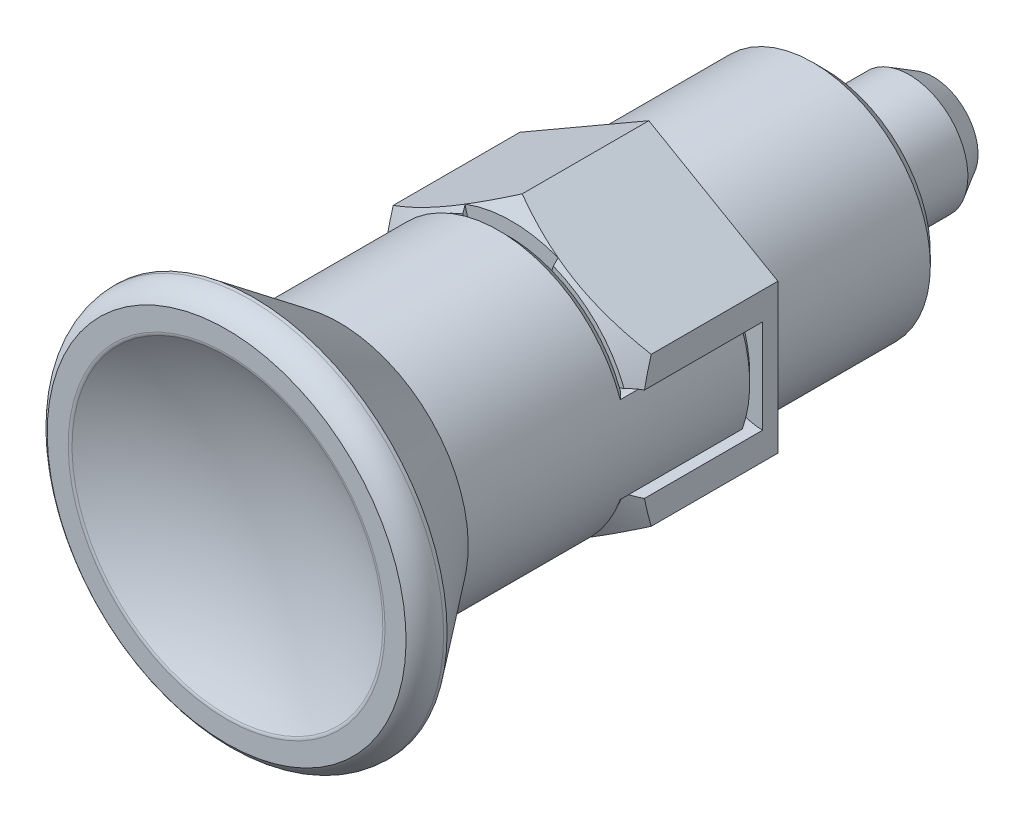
ISO-10303-21;
HEADER;
FILE_DESCRIPTION(('STEP AP214'),'2;1');
FILE_NAME('part.step','',(''),(''),'','','');
FILE_SCHEMA(('AUTOMOTIVE_DESIGN { 1 0 10303 214 1 1 1 1 }'));
ENDSEC;
DATA;
#1=APPLICATION_CONTEXT('core data for automotive mechanical design processes');
#2=APPLICATION_PROTOCOL_DEFINITION('international standard','automotive_design',2000,#1);
#3=PRODUCT_CONTEXT('',#1,'mechanical');
#4=PRODUCT('Part','Part','',(#3));
#5=PRODUCT_RELATED_PRODUCT_CATEGORY('part','',(#4));
#6=PRODUCT_DEFINITION_FORMATION('','',#4);
#7=PRODUCT_DEFINITION_CONTEXT('part definition',#1,'design');
#8=PRODUCT_DEFINITION('design','',#6,#7);
#9=PRODUCT_DEFINITION_SHAPE('','',#8);
#10=(LENGTH_UNIT() NAMED_UNIT(*) SI_UNIT(.MILLI.,.METRE.));
#11=(NAMED_UNIT(*) PLANE_ANGLE_UNIT() SI_UNIT($,.RADIAN.));
#12=(NAMED_UNIT(*) SI_UNIT($,.STERADIAN.) SOLID_ANGLE_UNIT());
#13=UNCERTAINTY_MEASURE_WITH_UNIT(LENGTH_MEASURE(1.E-05),#10,'distance_accuracy_value','');
#14=(GEOMETRIC_REPRESENTATION_CONTEXT(3) GLOBAL_UNCERTAINTY_ASSIGNED_CONTEXT((#13)) GLOBAL_UNIT_ASSIGNED_CONTEXT((#10,
#11,#12)) REPRESENTATION_CONTEXT('',''));
#15=CARTESIAN_POINT('',(0.,0.,0.));
#16=DIRECTION('',(0.,0.,1.));
#17=DIRECTION('',(1.,0.,0.));
#18=AXIS2_PLACEMENT_3D('',#15,#16,#17);
#19=CARTESIAN_POINT('',(3.16809484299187,7.6570265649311,-15.));
#20=DIRECTION('',(0.,0.,-1.));
#21=DIRECTION('',(0.383049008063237,-0.923728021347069,0.));
#22=AXIS2_PLACEMENT_3D('',#19,#20,#21);
#23=PLANE('',#22);
#24=CARTESIAN_POINT('',(0.,0.,-15.));
#25=DIRECTION('',(0.,0.,1.));
#26=DIRECTION('',(0.383049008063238,-0.923728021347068,0.));
#27=AXIS2_PLACEMENT_3D('',#24,#25,#26);
#28=CIRCLE('',#27,5.1);
#29=CARTESIAN_POINT('',(1.95354994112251,-4.71101290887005,-15.));
#30=VERTEX_POINT('',#29);
#31=EDGE_CURVE('E9',#30,#30,#28,.T.);
#32=ORIENTED_EDGE('',*,*,#31,.T.);
#33=EDGE_LOOP('',(#32));
#34=FACE_BOUND('',#33,.T.);
#35=CARTESIAN_POINT('',(0.,0.,-15.));
#36=DIRECTION('',(0.,0.,-1.));
#37=DIRECTION('',(-1.,0.,0.));
#38=AXIS2_PLACEMENT_3D('',#35,#36,#37);
#39=CIRCLE('',#38,9.);
#40=CARTESIAN_POINT('',(-9.,0.,-15.));
#41=VERTEX_POINT('',#40);
#42=EDGE_CURVE('E1694',#41,#41,#39,.T.);
#43=ORIENTED_EDGE('',*,*,#42,.T.);
#44=EDGE_LOOP('',(#43));
#45=FACE_BOUND('',#44,.T.);
#46=ADVANCED_FACE('F15',(#34,#45),#23,.T.);
#47=CARTESIAN_POINT('',(0.00991060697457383,-0.0238995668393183,-14.9998534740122));
#48=DIRECTION('',(0.923728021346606,0.383049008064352,0.));
#49=DIRECTION('',(0.383049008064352,-0.923728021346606,0.));
#50=AXIS2_PLACEMENT_3D('',#47,#48,#49);
#51=CIRCLE('',#50,10.0001799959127);
#52=TRIMMED_CURVE('',#51,(PARAMETER_VALUE(-1.57338357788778)),
(PARAMETER_VALUE(1.57338357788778)),.T.,.PARAMETER.);
#53=CARTESIAN_POINT('',(0.,0.,-14.9998534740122));
#54=DIRECTION('',(0.,0.,-1.));
#55=AXIS1_PLACEMENT('',#53,#54);
#56=SURFACE_OF_REVOLUTION('',#52,#55);
#57=CARTESIAN_POINT('',(0.,0.,-24.2549576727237));
#58=DIRECTION('',(0.,0.,1.));
#59=DIRECTION('',(0.383049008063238,-0.923728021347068,0.));
#60=AXIS2_PLACEMENT_3D('',#57,#58,#59);
#61=CIRCLE('',#60,3.81356963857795);
#62=CARTESIAN_POINT('',(1.46078406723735,-3.52270113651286,-24.2549576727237));
#63=VERTEX_POINT('',#62);
#64=EDGE_CURVE('E2399',#63,#63,#61,.T.);
#65=ORIENTED_EDGE('',*,*,#64,.F.);
#66=EDGE_LOOP('',(#65));
#67=FACE_BOUND('',#66,.T.);
#68=CARTESIAN_POINT('',(0.,0.,-25.));
#69=VERTEX_POINT('',#68);
#70=VERTEX_LOOP('',#69);
#71=FACE_BOUND('',#70,.T.);
#72=ADVANCED_FACE('F679',(#67,#71),#56,.T.);
#73=CARTESIAN_POINT('',(0.,0.,-24.2549576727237));
#74=DIRECTION('',(0.,0.,1.));
#75=DIRECTION('',(0.383049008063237,-0.923728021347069,0.));
#76=AXIS2_PLACEMENT_3D('',#73,#74,#75);
#77=CONICAL_SURFACE('',#76,3.81356963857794,0.523598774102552);
#78=CARTESIAN_POINT('',(0.,0.,-22.2));
#79=DIRECTION('',(0.,0.,1.));
#80=DIRECTION('',(0.383049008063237,-0.923728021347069,0.));
#81=AXIS2_PLACEMENT_3D('',#78,#79,#80);
#82=CIRCLE('',#81,4.99999999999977);
#83=CARTESIAN_POINT('',(1.91524504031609,-4.61864010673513,-22.2));
#84=VERTEX_POINT('',#83);
#85=EDGE_CURVE('E2405',#84,#84,#82,.T.);
#86=ORIENTED_EDGE('',*,*,#85,.F.);
#87=EDGE_LOOP('',(#86));
#88=FACE_BOUND('',#87,.T.);
#89=ORIENTED_EDGE('',*,*,#64,.T.);
#90=EDGE_LOOP('',(#89));
#91=FACE_BOUND('',#90,.T.);
#92=ADVANCED_FACE('F694',(#88,#91),#77,.T.);
#93=CARTESIAN_POINT('',(0.,0.,-15.5));
#94=DIRECTION('',(0.,0.,-1.));
#95=DIRECTION('',(0.383049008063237,-0.923728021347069,0.));
#96=AXIS2_PLACEMENT_3D('',#93,#94,#95);
#97=CYLINDRICAL_SURFACE('',#96,4.99999999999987);
#98=CARTESIAN_POINT('',(0.,0.,-15.5));
#99=DIRECTION('',(0.,0.,1.));
#100=DIRECTION('',(0.383049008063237,-0.923728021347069,0.));
#101=AXIS2_PLACEMENT_3D('',#98,#99,#100);
#102=CIRCLE('',#101,5.);
#103=CARTESIAN_POINT('',(1.91524504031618,-4.61864010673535,-15.5));
#104=VERTEX_POINT('',#103);
#105=EDGE_CURVE('E2413',#104,#104,#102,.T.);
#106=ORIENTED_EDGE('',*,*,#105,.F.);
#107=EDGE_LOOP('',(#106));
#108=FACE_BOUND('',#107,.T.);
#109=ORIENTED_EDGE('',*,*,#85,.T.);
#110=EDGE_LOOP('',(#109));
#111=FACE_BOUND('',#110,.T.);
#112=ADVANCED_FACE('F706',(#108,#111),#97,.T.);
#113=CARTESIAN_POINT('',(0.,0.,-15.3685640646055));
#114=DIRECTION('',(0.,0.,-1.));
#115=DIRECTION('',(0.383049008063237,-0.923728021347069,0.));
#116=AXIS2_PLACEMENT_3D('',#113,#114,#115);
#117=CONICAL_SURFACE('',#116,4.92411542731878,0.523598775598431);
#118=CARTESIAN_POINT('',(1.88720390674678,-4.55101852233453,-15.3732050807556));
#119=CARTESIAN_POINT('',(2.46317891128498,-4.31217478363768,-15.3732050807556));
#120=CARTESIAN_POINT('',(3.52617092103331,-3.61141118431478,-15.3732050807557));
#121=CARTESIAN_POINT('',(4.60105161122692,-2.06377233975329,-15.3732050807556));
#122=CARTESIAN_POINT('',(4.99127203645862,-0.425401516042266,-15.3732050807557));
#123=CARTESIAN_POINT('',(4.87271055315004,1.04117692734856,-15.3732050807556));
#124=CARTESIAN_POINT('',(4.38004579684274,2.43215512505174,-15.3732050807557));
#125=CARTESIAN_POINT('',(3.36124468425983,3.75581086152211,-15.3732050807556));
#126=CARTESIAN_POINT('',(1.76154595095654,4.72640028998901,-15.3732050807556));
#127=CARTESIAN_POINT('',(-0.105251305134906,5.04691225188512,-15.3732050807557));
#128=CARTESIAN_POINT('',(-1.99550664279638,4.64077913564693,-15.3732050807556));
#129=CARTESIAN_POINT('',(-3.60927514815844,3.53936948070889,-15.3732050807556));
#130=CARTESIAN_POINT('',(-4.71488939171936,1.84997941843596,-15.3732050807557));
#131=CARTESIAN_POINT('',(-5.05712159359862,-0.1141523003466,-15.3732050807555));
#132=CARTESIAN_POINT('',(-4.62193084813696,-2.01743975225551,-15.3732050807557));
#133=CARTESIAN_POINT('',(-3.64000658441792,-3.45692716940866,-15.3732050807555));
#134=CARTESIAN_POINT('',(-2.35556826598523,-4.40866502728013,-15.3732050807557));
#135=CARTESIAN_POINT('',(-0.973984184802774,-4.9028128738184,-15.3732050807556));
#136=CARTESIAN_POINT('',(0.491312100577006,-4.97451268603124,-15.3732050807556));
#137=CARTESIAN_POINT('',(1.440691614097,-4.73617701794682,-15.3732050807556));
#138=CARTESIAN_POINT('',(1.88720390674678,-4.55101852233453,-15.3732050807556));
#139=(BOUNDED_CURVE() B_SPLINE_CURVE(3,(#118,#119,#120,#121,#122,#123,#124,#125,#126,#127,#128,
#129,#130,#131,#132,#133,#134,#135,#136,#137,#138),.UNSPECIFIED.,.T.,
.F.) B_SPLINE_CURVE_WITH_KNOTS((4,1,1,1,1,1,1,1,1,1,1,1,1,1,1,1,1,1,4),(2.,20.4908913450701,
38.9817826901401,56.8162968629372,69.5182221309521,82.2201473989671,100.17799371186,
118.135840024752,136.693729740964,155.251619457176,174.345847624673,193.440075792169,
213.883544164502,232.067311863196,250.25107956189,264.585747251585,278.92041494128,
293.255082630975,307.58975032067),
.UNSPECIFIED.) CURVE() GEOMETRIC_REPRESENTATION_ITEM() RATIONAL_B_SPLINE_CURVE((0.99999999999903,
0.99999999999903,0.99999999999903,0.99999999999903,0.99999999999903,0.99999999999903,
0.99999999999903,0.99999999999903,0.99999999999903,0.99999999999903,0.99999999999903,
0.99999999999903,0.99999999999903,0.99999999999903,0.99999999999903,0.99999999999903,
0.99999999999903,0.99999999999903,0.99999999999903,0.99999999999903,0.99999999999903)) REPRESENTATION_ITEM(''));
#140=CARTESIAN_POINT('',(1.88720390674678,-4.55101852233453,-15.3732050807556));
#141=VERTEX_POINT('',#140);
#142=EDGE_CURVE('E2421',#141,#141,#139,.F.);
#143=ORIENTED_EDGE('',*,*,#142,.T.);
#144=EDGE_LOOP('',(#143));
#145=FACE_BOUND('',#144,.T.);
#146=ORIENTED_EDGE('',*,*,#105,.T.);
#147=EDGE_LOOP('',(#146));
#148=FACE_BOUND('',#147,.T.);
#149=ADVANCED_FACE('F718',(#145,#148),#117,.T.);
#150=CARTESIAN_POINT('',(1.87694013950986,-4.52626730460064,-15.2732050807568));
#151=CARTESIAN_POINT('',(2.4497826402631,-4.28872254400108,-15.2732050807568));
#152=CARTESIAN_POINT('',(3.50699345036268,-3.59177012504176,-15.2732050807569));
#153=CARTESIAN_POINT('',(4.57602828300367,-2.0525482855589,-15.2732050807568));
#154=CARTESIAN_POINT('',(4.96412645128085,-0.423087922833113,-15.2732050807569));
#155=CARTESIAN_POINT('',(4.84620977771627,1.03551437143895,-15.2732050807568));
#156=CARTESIAN_POINT('',(4.35622443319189,2.41892758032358,-15.2732050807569));
#157=CARTESIAN_POINT('',(3.34296418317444,3.73538446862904,-15.2732050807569));
#158=CARTESIAN_POINT('',(1.75196558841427,4.70069523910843,-15.2732050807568));
#159=CARTESIAN_POINT('',(-0.104678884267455,5.01946406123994,-15.2732050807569));
#160=CARTESIAN_POINT('',(-1.98465385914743,4.61553974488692,-15.2732050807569));
#161=CARTESIAN_POINT('',(-3.58964570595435,3.5201202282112,-15.2732050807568));
#162=CARTESIAN_POINT('',(-4.68924694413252,1.83991810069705,-15.2732050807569));
#163=CARTESIAN_POINT('',(-5.02961787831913,-0.113531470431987,-15.2732050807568));
#164=CARTESIAN_POINT('',(-4.59679396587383,-2.00646768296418,-15.273205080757));
#165=CARTESIAN_POINT('',(-3.62021000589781,-3.43812628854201,-15.2732050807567));
#166=CARTESIAN_POINT('',(-2.34275724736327,-4.38468801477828,-15.273205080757));
#167=CARTESIAN_POINT('',(-0.968687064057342,-4.87614838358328,-15.2732050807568));
#168=CARTESIAN_POINT('',(0.488640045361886,-4.94745824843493,-15.2732050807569));
#169=CARTESIAN_POINT('',(1.43285625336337,-4.7104187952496,-15.2732050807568));
#170=CARTESIAN_POINT('',(1.87694013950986,-4.52626730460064,-15.2732050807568));
#171=CARTESIAN_POINT('',(1.87694013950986,-4.5262673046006,-15.3267949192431));
#172=CARTESIAN_POINT('',(2.44978264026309,-4.28872254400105,-15.3267949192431));
#173=CARTESIAN_POINT('',(3.50699345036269,-3.59177012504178,-15.3267949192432));
#174=CARTESIAN_POINT('',(4.57602828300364,-2.05254828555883,-15.3267949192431));
#175=CARTESIAN_POINT('',(4.96412645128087,-0.423087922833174,-15.3267949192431));
#176=CARTESIAN_POINT('',(4.84620977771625,1.035514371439,-15.3267949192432));
#177=CARTESIAN_POINT('',(4.35622443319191,2.41892758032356,-15.3267949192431));
#178=CARTESIAN_POINT('',(3.34296418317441,3.73538446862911,-15.3267949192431));
#179=CARTESIAN_POINT('',(1.75196558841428,4.70069523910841,-15.3267949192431));
#180=CARTESIAN_POINT('',(-0.104678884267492,5.01946406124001,-15.3267949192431));
#181=CARTESIAN_POINT('',(-1.98465385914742,4.61553974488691,-15.3267949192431));
#182=CARTESIAN_POINT('',(-3.58964570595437,3.52012022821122,-15.3267949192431));
#183=CARTESIAN_POINT('',(-4.68924694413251,1.83991810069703,-15.3267949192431));
#184=CARTESIAN_POINT('',(-5.02961787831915,-0.113531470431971,-15.3267949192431));
#185=CARTESIAN_POINT('',(-4.59679396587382,-2.00646768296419,-15.3267949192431));
#186=CARTESIAN_POINT('',(-3.62021000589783,-3.438126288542,-15.3267949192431));
#187=CARTESIAN_POINT('',(-2.34275724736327,-4.38468801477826,-15.3267949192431));
#188=CARTESIAN_POINT('',(-0.968687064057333,-4.87614838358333,-15.3267949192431));
#189=CARTESIAN_POINT('',(0.488640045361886,-4.94745824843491,-15.3267949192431));
#190=CARTESIAN_POINT('',(1.43285625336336,-4.71041879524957,-15.3267949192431));
#191=CARTESIAN_POINT('',(1.87694013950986,-4.5262673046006,-15.3267949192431));
#192=CARTESIAN_POINT('',(1.88720390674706,-4.55101852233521,-15.3732050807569));
#193=CARTESIAN_POINT('',(2.46317891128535,-4.31217478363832,-15.3732050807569));
#194=CARTESIAN_POINT('',(3.52617092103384,-3.61141118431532,-15.373205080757));
#195=CARTESIAN_POINT('',(4.60105161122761,-2.0637723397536,-15.3732050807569));
#196=CARTESIAN_POINT('',(4.99127203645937,-0.425401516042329,-15.373205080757));
#197=CARTESIAN_POINT('',(4.87271055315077,1.04117692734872,-15.3732050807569));
#198=CARTESIAN_POINT('',(4.38004579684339,2.4321551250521,-15.373205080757));
#199=CARTESIAN_POINT('',(3.36124468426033,3.75581086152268,-15.3732050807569));
#200=CARTESIAN_POINT('',(1.7615459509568,4.72640028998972,-15.3732050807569));
#201=CARTESIAN_POINT('',(-0.105251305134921,5.04691225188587,-15.373205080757));
#202=CARTESIAN_POINT('',(-1.99550664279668,4.64077913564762,-15.3732050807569));
#203=CARTESIAN_POINT('',(-3.60927514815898,3.53936948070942,-15.3732050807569));
#204=CARTESIAN_POINT('',(-4.71488939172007,1.84997941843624,-15.373205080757));
#205=CARTESIAN_POINT('',(-5.05712159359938,-0.114152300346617,-15.3732050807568));
#206=CARTESIAN_POINT('',(-4.62193084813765,-2.01743975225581,-15.373205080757));
#207=CARTESIAN_POINT('',(-3.64000658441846,-3.45692716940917,-15.3732050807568));
#208=CARTESIAN_POINT('',(-2.35556826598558,-4.40866502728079,-15.373205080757));
#209=CARTESIAN_POINT('',(-0.97398418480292,-4.90281287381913,-15.3732050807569));
#210=CARTESIAN_POINT('',(0.491312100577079,-4.97451268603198,-15.3732050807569));
#211=CARTESIAN_POINT('',(1.44069161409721,-4.73617701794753,-15.3732050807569));
#212=CARTESIAN_POINT('',(1.88720390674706,-4.55101852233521,-15.3732050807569));
#213=(BOUNDED_SURFACE() B_SPLINE_SURFACE(2,3,((#150,#151,#152,#153,#154,#155,#156,#157,#158,
#159,#160,#161,#162,#163,#164,#165,#166,#167,#168,#169,#170),(#171,#172,#173,#174,#175,#176,
#177,#178,#179,#180,#181,#182,#183,#184,#185,#186,#187,#188,#189,#190,#191),(#192,#193,#194,
#195,#196,#197,#198,#199,#200,#201,#202,#203,#204,#205,#206,#207,#208,#209,#210,#211,#212)),
.UNSPECIFIED.,.F.,.T.,.F.) B_SPLINE_SURFACE_WITH_KNOTS((3,3),(4,1,1,1,1,1,1,1,1,1,1,1,1,1,1,1,1,
1,4),(0.,1.),(2.,20.4908913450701,38.9817826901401,56.8162968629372,69.5182221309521,
82.2201473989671,100.17799371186,118.135840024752,136.693729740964,155.251619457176,
174.345847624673,193.440075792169,213.883544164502,232.067311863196,250.25107956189,
264.585747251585,278.92041494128,293.255082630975,307.58975032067),
.UNSPECIFIED.) GEOMETRIC_REPRESENTATION_ITEM() RATIONAL_B_SPLINE_SURFACE(((1.,1.,1.,1.,1.,1.,1.,
1.,1.,1.,1.,1.,1.,1.,1.,1.,1.,1.,1.,1.,1.),(0.965925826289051,0.965925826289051,
0.965925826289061,0.965925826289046,0.965925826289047,0.96592582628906,0.965925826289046,
0.965925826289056,0.965925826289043,0.965925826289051,0.965925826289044,0.965925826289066,
0.965925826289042,0.965925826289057,0.96592582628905,0.965925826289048,0.965925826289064,
0.965925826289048,0.965925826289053,0.965925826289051,0.965925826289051),(1.,1.,1.,1.,1.,1.,1.,
1.,1.,1.,1.,1.,1.,1.,1.,1.,1.,1.,1.,1.,1.))) REPRESENTATION_ITEM('') SURFACE());
#214=CARTESIAN_POINT('',(1.87694013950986,-4.52626730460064,-15.2732050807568));
#215=CARTESIAN_POINT('',(1.81118151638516,-4.5535356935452,-15.2732050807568));
#216=CARTESIAN_POINT('',(1.74482447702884,-4.57935875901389,-15.2732050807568));
#217=CARTESIAN_POINT('',(1.61101990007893,-4.62809339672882,-15.2732050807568));
#218=CARTESIAN_POINT('',(1.54357194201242,-4.65100381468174,-15.2732050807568));
#219=CARTESIAN_POINT('',(1.40772329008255,-4.69387726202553,-15.2732050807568));
#220=CARTESIAN_POINT('',(1.33932231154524,-4.71383938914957,-15.2732050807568));
#221=CARTESIAN_POINT('',(1.20170472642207,-4.75078027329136,-15.2732050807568));
#222=CARTESIAN_POINT('',(1.13248795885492,-4.76775843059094,-15.2732050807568));
#223=CARTESIAN_POINT('',(0.993376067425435,-4.79869515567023,-15.2732050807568));
#224=CARTESIAN_POINT('',(0.923480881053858,-4.81265344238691,-15.2732050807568));
#225=CARTESIAN_POINT('',(0.783149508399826,-4.83751493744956,-15.2732050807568));
#226=CARTESIAN_POINT('',(0.712713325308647,-4.84841816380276,-15.2732050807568));
#227=CARTESIAN_POINT('',(0.571436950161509,-4.86713126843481,-15.2732050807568));
#228=CARTESIAN_POINT('',(0.500596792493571,-4.87494140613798,-15.2732050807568));
#229=CARTESIAN_POINT('',(0.358649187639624,-4.88744136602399,-15.2732050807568));
#230=CARTESIAN_POINT('',(0.287541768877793,-4.89213151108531,-15.2732050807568));
#231=CARTESIAN_POINT('',(0.145195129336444,-4.89840287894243,-15.2732050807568));
#232=CARTESIAN_POINT('',(0.0739559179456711,-4.89998431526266,-15.2732050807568));
#233=CARTESIAN_POINT('',(-0.0685201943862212,-4.90004454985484,-15.2732050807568));
#234=CARTESIAN_POINT('',(-0.139757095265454,-4.89852350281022,-15.2732050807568));
#235=CARTESIAN_POINT('',(-0.282094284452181,-4.89238643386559,-15.2732050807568));
#236=CARTESIAN_POINT('',(-0.353194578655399,-4.88777054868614,-15.2732050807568));
#237=CARTESIAN_POINT('',(-0.495124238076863,-4.87545071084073,-15.2732050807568));
#238=CARTESIAN_POINT('',(-0.565953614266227,-4.86774688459,-15.2732050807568));
#239=CARTESIAN_POINT('',(-0.707207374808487,-4.8492594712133,-15.2732050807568));
#240=CARTESIAN_POINT('',(-0.777631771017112,-4.83847597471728,-15.2732050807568));
#241=CARTESIAN_POINT('',(-0.917940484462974,-4.81383264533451,-15.2732050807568));
#242=CARTESIAN_POINT('',(-0.987824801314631,-4.79997281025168,-15.2732050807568));
#243=CARTESIAN_POINT('',(-1.12692145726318,-4.76920343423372,-15.2732050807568));
#244=CARTESIAN_POINT('',(-1.19613376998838,-4.75229377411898,-15.2732050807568));
#245=CARTESIAN_POINT('',(-1.33375939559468,-4.71547507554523,-15.2732050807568));
#246=CARTESIAN_POINT('',(-1.40217266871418,-4.69556588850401,-15.2732050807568));
#247=CARTESIAN_POINT('',(-1.53807218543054,-4.65279332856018,-15.2732050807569));
#248=CARTESIAN_POINT('',(-1.60555839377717,-4.62992984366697,-15.2732050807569));
#249=CARTESIAN_POINT('',(-1.73947602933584,-4.58129523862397,-15.2732050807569));
#250=CARTESIAN_POINT('',(-1.80590744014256,-4.55552407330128,-15.2732050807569));
#251=CARTESIAN_POINT('',(-1.93758747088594,-4.50111998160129,-15.2732050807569));
#252=CARTESIAN_POINT('',(-2.00283609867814,-4.4724870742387,-15.2732050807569));
#253=CARTESIAN_POINT('',(-2.13202321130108,-4.41240654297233,-15.2732050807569));
#254=CARTESIAN_POINT('',(-2.19596171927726,-4.3809589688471,-15.2732050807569));
#255=CARTESIAN_POINT('',(-2.32239883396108,-4.31529215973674,-15.2732050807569));
#256=CARTESIAN_POINT('',(-2.38489745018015,-4.28107294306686,-15.2732050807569));
#257=CARTESIAN_POINT('',(-2.50833999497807,-4.20993442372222,-15.2732050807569));
#258=CARTESIAN_POINT('',(-2.5692838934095,-4.17301506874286,-15.2732050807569));
#259=CARTESIAN_POINT('',(-2.68950800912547,-4.09655677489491,-15.2732050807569));
#260=CARTESIAN_POINT('',(-2.74878817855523,-4.05701776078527,-15.2732050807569));
#261=CARTESIAN_POINT('',(-2.86557446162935,-3.97539826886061,-15.2732050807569));
#262=CARTESIAN_POINT('',(-2.92308053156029,-3.93331772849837,-15.2732050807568));
#263=CARTESIAN_POINT('',(-3.03620859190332,-3.84669389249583,-15.2732050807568));
#264=CARTESIAN_POINT('',(-3.0918305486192,-3.80215055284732,-15.2732050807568));
#265=CARTESIAN_POINT('',(-3.20108019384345,-3.7106796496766,-15.2732050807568));
#266=CARTESIAN_POINT('',(-3.25470784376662,-3.66375204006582,-15.2732050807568));
#267=CARTESIAN_POINT('',(-3.35985895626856,-3.56759121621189,-15.2732050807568));
#268=CARTESIAN_POINT('',(-3.41138233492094,-3.51835791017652,-15.2732050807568));
#269=CARTESIAN_POINT('',(-3.51221392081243,-3.41766450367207,-15.2732050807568));
#270=CARTESIAN_POINT('',(-3.56152193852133,-3.36620421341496,-15.2732050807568));
#271=CARTESIAN_POINT('',(-3.6578445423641,-3.26116953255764,-15.2732050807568));
#272=CARTESIAN_POINT('',(-3.70485885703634,-3.2075948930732,-15.2732050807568));
#273=CARTESIAN_POINT('',(-3.79651660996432,-3.09844424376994,-15.2732050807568));
#274=CARTESIAN_POINT('',(-3.84115977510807,-3.04286800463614,-15.2732050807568));
#275=CARTESIAN_POINT('',(-3.92799745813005,-2.92982678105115,-15.2732050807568));
#276=CARTESIAN_POINT('',(-3.97019176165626,-2.87236163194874,-15.2732050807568));
#277=CARTESIAN_POINT('',(-4.05205392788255,-2.75565517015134,-15.2732050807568));
#278=CARTESIAN_POINT('',(-4.09172167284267,-2.69641377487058,-15.2732050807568));
#279=CARTESIAN_POINT('',(-4.16845296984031,-2.57626742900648,-15.2732050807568));
#280=CARTESIAN_POINT('',(-4.20551651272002,-2.5153624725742,-15.2732050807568));
#281=CARTESIAN_POINT('',(-4.27696127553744,-2.39200145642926,-15.2732050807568));
#282=CARTESIAN_POINT('',(-4.31134257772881,-2.32954544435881,-15.2732050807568));
#283=CARTESIAN_POINT('',(-4.37734612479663,-2.20319540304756,-15.2732050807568));
#284=CARTESIAN_POINT('',(-4.40896849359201,-2.13930143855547,-15.2732050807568));
#285=CARTESIAN_POINT('',(-4.4693723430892,-2.01018632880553,-15.2732050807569));
#286=CARTESIAN_POINT('',(-4.49815390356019,-1.9449652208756,-15.2732050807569));
#287=CARTESIAN_POINT('',(-4.55281655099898,-1.81331737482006,-15.2732050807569));
#288=CARTESIAN_POINT('',(-4.57869758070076,-1.74689061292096,-15.2732050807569));
#289=CARTESIAN_POINT('',(-4.62753303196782,-1.61296640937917,-15.2732050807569));
#290=CARTESIAN_POINT('',(-4.65048730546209,-1.5454689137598,-15.2732050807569));
#291=CARTESIAN_POINT('',(-4.69343674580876,-1.40953522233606,-15.2732050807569));
#292=CARTESIAN_POINT('',(-4.71343175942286,-1.34109897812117,-15.2732050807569));
#293=CARTESIAN_POINT('',(-4.75043177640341,-1.20342051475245,-15.2732050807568));
#294=CARTESIAN_POINT('',(-4.76743667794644,-1.13417826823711,-15.2732050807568));
#295=CARTESIAN_POINT('',(-4.79842503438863,-0.995020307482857,-15.2732050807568));
#296=CARTESIAN_POINT('',(-4.8124084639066,-0.925104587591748,-15.2732050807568));
#297=CARTESIAN_POINT('',(-4.83732263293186,-0.78473223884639,-15.2732050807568));
#298=CARTESIAN_POINT('',(-4.84825341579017,-0.714275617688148,-15.2732050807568));
#299=CARTESIAN_POINT('',(-4.86703065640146,-0.572954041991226,-15.2732050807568));
#300=CARTESIAN_POINT('',(-4.87487718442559,-0.502089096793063,-15.2732050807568));
#301=CARTESIAN_POINT('',(-4.88745570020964,-0.36008338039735,-15.2732050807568));
#302=CARTESIAN_POINT('',(-4.89218770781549,-0.288942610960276,-15.2732050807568));
#303=CARTESIAN_POINT('',(-4.89850192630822,-0.14651821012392,-15.2732050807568));
#304=CARTESIAN_POINT('',(-4.90008399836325,-0.0752345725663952,-15.2732050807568));
#305=CARTESIAN_POINT('',(-4.90011496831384,0.0673398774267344,-15.2732050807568));
#306=CARTESIAN_POINT('',(-4.89856356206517,0.138630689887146,-15.2732050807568));
#307=CARTESIAN_POINT('',(-4.89235255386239,0.281084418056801,-15.2732050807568));
#308=CARTESIAN_POINT('',(-4.8876926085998,0.352247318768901,-15.2732050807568));
#309=CARTESIAN_POINT('',(-4.87528714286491,0.494310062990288,-15.2732050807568));
#310=CARTESIAN_POINT('',(-4.86754133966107,0.565209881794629,-15.2732050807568));
#311=CARTESIAN_POINT('',(-4.8489872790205,0.706611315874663,-15.2732050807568));
#312=CARTESIAN_POINT('',(-4.8381788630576,0.777112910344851,-15.2732050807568));
#313=CARTESIAN_POINT('',(-4.81352245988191,0.917582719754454,-15.2732050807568));
#314=CARTESIAN_POINT('',(-4.79967446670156,0.987550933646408,-15.2732050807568));
#315=CARTESIAN_POINT('',(-4.76896186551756,1.12681880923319,-15.2732050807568));
#316=CARTESIAN_POINT('',(-4.75209739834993,1.19611850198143,-15.2732050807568));
#317=CARTESIAN_POINT('',(-4.71537458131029,1.33391407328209,-15.2732050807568));
#318=CARTESIAN_POINT('',(-4.69551648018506,1.40241001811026,-15.2732050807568));
#319=CARTESIAN_POINT('',(-4.65282998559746,1.53846310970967,-15.2732050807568));
#320=CARTESIAN_POINT('',(-4.63000187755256,1.60602034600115,-15.2732050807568));
#321=CARTESIAN_POINT('',(-4.58139598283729,1.74006000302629,-15.2732050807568));
#322=CARTESIAN_POINT('',(-4.55561841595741,1.80654250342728,-15.2732050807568));
#323=CARTESIAN_POINT('',(-4.50114636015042,1.93830037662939,-15.2732050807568));
#324=CARTESIAN_POINT('',(-4.4724519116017,2.00357576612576,-15.2732050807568));
#325=CARTESIAN_POINT('',(-4.41222689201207,2.13280725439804,-15.2732050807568));
#326=CARTESIAN_POINT('',(-4.3806962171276,2.19676330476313,-15.2732050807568));
#327=CARTESIAN_POINT('',(-4.31487324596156,2.32324200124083,-15.2732050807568));
#328=CARTESIAN_POINT('',(-4.28058081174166,2.38576457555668,-15.2732050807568));
#329=CARTESIAN_POINT('',(-4.2093103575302,2.50926268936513,-15.2732050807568));
#330=CARTESIAN_POINT('',(-4.1723322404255,2.57023817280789,-15.2732050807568));
#331=CARTESIAN_POINT('',(-4.09576593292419,2.69052827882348,-15.2732050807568));
#332=CARTESIAN_POINT('',(-4.05617772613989,2.74984289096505,-15.2732050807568));
#333=CARTESIAN_POINT('',(-3.97446687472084,2.86669747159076,-15.2732050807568));
#334=CARTESIAN_POINT('',(-3.93234430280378,2.92423749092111,-15.2732050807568));
#335=CARTESIAN_POINT('',(-3.84564015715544,3.0374289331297,-15.2732050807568));
#336=CARTESIAN_POINT('',(-3.80105872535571,3.09308046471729,-15.2732050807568));
#337=CARTESIAN_POINT('',(-3.70951292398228,3.20238151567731,-15.2732050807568));
#338=CARTESIAN_POINT('',(-3.66254872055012,3.25603117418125,-15.2732050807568));
#339=CARTESIAN_POINT('',(-3.56631124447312,3.36121310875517,-15.2732050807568));
#340=CARTESIAN_POINT('',(-3.51703809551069,3.41274549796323,-15.2732050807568));
#341=CARTESIAN_POINT('',(-3.41626560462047,3.51358509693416,-15.2732050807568));
#342=CARTESIAN_POINT('',(-3.3647662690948,3.5628923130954,-15.2732050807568));
#343=CARTESIAN_POINT('',(-3.25965766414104,3.65920779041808,-15.2732050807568));
#344=CARTESIAN_POINT('',(-3.20604831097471,3.70621596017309,-15.2732050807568));
#345=CARTESIAN_POINT('',(-3.09683123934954,3.79785569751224,-15.2732050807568));
#346=CARTESIAN_POINT('',(-3.04122342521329,3.84248715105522,-15.2732050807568));
#347=CARTESIAN_POINT('',(-2.92812213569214,3.92929676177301,-15.2732050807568));
#348=CARTESIAN_POINT('',(-2.8706286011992,3.97147484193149,-15.2732050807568));
#349=CARTESIAN_POINT('',(-2.75386819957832,4.05330065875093,-15.2732050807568));
#350=CARTESIAN_POINT('',(-2.6946013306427,4.09294839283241,-15.2732050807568));
#351=CARTESIAN_POINT('',(-2.57440668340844,4.16963655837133,-15.2732050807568));
#352=CARTESIAN_POINT('',(-2.51347895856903,4.20667707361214,-15.2732050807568));
#353=CARTESIAN_POINT('',(-2.39007490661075,4.27807361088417,-15.2732050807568));
#354=CARTESIAN_POINT('',(-2.32759866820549,4.31242978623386,-15.2732050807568));
#355=CARTESIAN_POINT('',(-2.20121028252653,4.37838121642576,-15.2732050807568));
#356=CARTESIAN_POINT('',(-2.13729822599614,4.40997664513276,-15.2732050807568));
#357=CARTESIAN_POINT('',(-2.00814958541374,4.47032743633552,-15.2732050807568));
#358=CARTESIAN_POINT('',(-1.94291305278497,4.49908290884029,-15.2732050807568));
#359=CARTESIAN_POINT('',(-1.81123272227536,4.55368527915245,-15.2732050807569));
#360=CARTESIAN_POINT('',(-1.74478890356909,4.57953212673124,-15.2732050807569));
#361=CARTESIAN_POINT('',(-1.61082995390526,4.62829321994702,-15.2732050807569));
#362=CARTESIAN_POINT('',(-1.54331476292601,4.65120730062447,-15.2732050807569));
#363=CARTESIAN_POINT('',(-1.40734619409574,4.6940732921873,-15.2732050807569));
#364=CARTESIAN_POINT('',(-1.33889276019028,4.71402502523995,-15.2732050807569));
#365=CARTESIAN_POINT('',(-1.2011815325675,4.75093810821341,-15.2732050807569));
#366=CARTESIAN_POINT('',(-1.13192370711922,4.76789933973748,-15.2732050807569));
#367=CARTESIAN_POINT('',(-0.992737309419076,4.7988027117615,-15.2732050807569));
#368=CARTESIAN_POINT('',(-0.922808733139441,4.81274483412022,-15.2732050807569));
#369=CARTESIAN_POINT('',(-0.782414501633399,4.83758146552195,-15.2732050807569));
#370=CARTESIAN_POINT('',(-0.711948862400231,4.84847606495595,-15.2732050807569));
#371=CARTESIAN_POINT('',(-0.570614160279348,4.86718863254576,-15.2732050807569));
#372=CARTESIAN_POINT('',(-0.49974512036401,4.87500677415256,-15.2732050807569));
#373=CARTESIAN_POINT('',(-0.357737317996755,4.88753915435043,-15.2732050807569));
#374=CARTESIAN_POINT('',(-0.286598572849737,4.89225358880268,-15.2732050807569));
#375=CARTESIAN_POINT('',(-0.14418495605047,4.8985449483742,-15.2732050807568));
#376=CARTESIAN_POINT('',(-0.0729100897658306,4.90012199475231,-15.2732050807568));
#377=CARTESIAN_POINT('',(0.0696406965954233,4.90013434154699,-15.2732050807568));
#378=CARTESIAN_POINT('',(0.140916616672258,4.89856959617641,-15.2732050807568));
#379=CARTESIAN_POINT('',(0.283334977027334,4.89232740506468,-15.2732050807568));
#380=CARTESIAN_POINT('',(0.354477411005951,4.88764981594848,-15.2732050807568));
#381=CARTESIAN_POINT('',(0.496494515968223,4.87520400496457,-15.2732050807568));
#382=CARTESIAN_POINT('',(0.567369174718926,4.86743564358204,-15.2732050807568));
#383=CARTESIAN_POINT('',(0.708716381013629,4.84883209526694,-15.2732050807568));
#384=CARTESIAN_POINT('',(0.779188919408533,4.83799683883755,-15.2732050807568));
#385=CARTESIAN_POINT('',(0.919597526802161,4.81328272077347,-15.2732050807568));
#386=CARTESIAN_POINT('',(0.989533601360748,4.79940389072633,-15.2732050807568));
#387=CARTESIAN_POINT('',(1.12873495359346,4.76862606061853,-15.2732050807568));
#388=CARTESIAN_POINT('',(1.19800025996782,4.75172719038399,-15.2732050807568));
#389=CARTESIAN_POINT('',(1.33572555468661,4.71493225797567,-15.2732050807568));
#390=CARTESIAN_POINT('',(1.40418559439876,4.69503638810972,-15.2732050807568));
#391=CARTESIAN_POINT('',(1.54016652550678,4.65227206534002,-15.2732050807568));
#392=CARTESIAN_POINT('',(1.60768747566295,4.62940379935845,-15.2732050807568));
#393=CARTESIAN_POINT('',(1.74165381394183,4.58071344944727,-15.2732050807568));
#394=CARTESIAN_POINT('',(1.80809923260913,4.5548914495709,-15.2732050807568));
#395=CARTESIAN_POINT('',(1.93979287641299,4.50035326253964,-15.2732050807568));
#396=CARTESIAN_POINT('',(2.00504107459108,4.47163701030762,-15.2732050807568));
#397=CARTESIAN_POINT('',(2.13422501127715,4.41138368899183,-15.2732050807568));
#398=CARTESIAN_POINT('',(2.19816069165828,4.37984649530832,-15.2732050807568));
#399=CARTESIAN_POINT('',(2.32460283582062,4.31402104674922,-15.2732050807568));
#400=CARTESIAN_POINT('',(2.38710924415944,4.27973268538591,-15.2732050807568));
#401=CARTESIAN_POINT('',(2.51057642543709,4.20847550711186,-15.2732050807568));
#402=CARTESIAN_POINT('',(2.57153717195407,4.17150664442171,-15.2732050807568));
#403=CARTESIAN_POINT('',(2.69179652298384,4.09495883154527,-15.2732050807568));
#404=CARTESIAN_POINT('',(2.75109514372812,4.0553799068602,-15.2732050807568));
#405=CARTESIAN_POINT('',(2.86791357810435,3.97368219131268,-15.2732050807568));
#406=CARTESIAN_POINT('',(2.92543344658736,3.9315634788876,-15.2732050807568));
#407=CARTESIAN_POINT('',(3.03857834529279,3.84485717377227,-15.2732050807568));
#408=CARTESIAN_POINT('',(3.09420344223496,3.80026966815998,-15.2732050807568));
#409=CARTESIAN_POINT('',(3.20344041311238,3.70869396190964,-15.2732050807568));
#410=CARTESIAN_POINT('',(3.25705231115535,3.66170579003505,-15.2732050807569));
#411=CARTESIAN_POINT('',(3.36215330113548,3.56540904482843,-15.2732050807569));
#412=CARTESIAN_POINT('',(3.4136423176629,3.51610038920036,-15.2732050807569));
#413=CARTESIAN_POINT('',(3.51441768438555,3.41527641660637,-15.2732050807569));
#414=CARTESIAN_POINT('',(3.5637039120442,3.36376097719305,-15.2732050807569));
#415=CARTESIAN_POINT('',(3.65998962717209,3.25863203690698,-15.2732050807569));
#416=CARTESIAN_POINT('',(3.70698902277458,3.20501845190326,-15.2732050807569));
#417=CARTESIAN_POINT('',(3.79861801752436,3.09580310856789,-15.2732050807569));
#418=CARTESIAN_POINT('',(3.84324761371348,3.04020134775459,-15.2732050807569));
#419=CARTESIAN_POINT('',(3.93005357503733,2.92711912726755,-15.2732050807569));
#420=CARTESIAN_POINT('',(3.97223006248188,2.86963876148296,-15.2732050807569));
#421=CARTESIAN_POINT('',(4.05404650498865,2.7529089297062,-15.2732050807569));
#422=CARTESIAN_POINT('',(4.09368671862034,2.69365964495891,-15.2732050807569));
#423=CARTESIAN_POINT('',(4.17034693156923,2.57350141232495,-15.2732050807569));
#424=CARTESIAN_POINT('',(4.20736730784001,2.51259270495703,-15.2732050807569));
#425=CARTESIAN_POINT('',(4.27870548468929,2.38922564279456,-15.2732050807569));
#426=CARTESIAN_POINT('',(4.31302372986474,2.32676754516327,-15.2732050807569));
#427=CARTESIAN_POINT('',(4.37887059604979,2.20040953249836,-15.2732050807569));
#428=CARTESIAN_POINT('',(4.41039963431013,2.13650983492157,-15.2732050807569));
#429=CARTESIAN_POINT('',(4.47062103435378,2.00739510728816,-15.2732050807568));
#430=CARTESIAN_POINT('',(4.49931366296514,1.94218020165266,-15.2732050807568));
#431=CARTESIAN_POINT('',(4.55382477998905,1.81056433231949,-15.2732050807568));
#432=CARTESIAN_POINT('',(4.57964342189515,1.7441634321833,-15.2732050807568));
#433=CARTESIAN_POINT('',(4.62836673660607,1.61030377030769,-15.2732050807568));
#434=CARTESIAN_POINT('',(4.65127151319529,1.54284504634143,-15.2732050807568));
#435=CARTESIAN_POINT('',(4.69412765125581,1.40699815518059,-15.2732050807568));
#436=CARTESIAN_POINT('',(4.71407910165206,1.33861001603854,-15.2732050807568));
#437=CARTESIAN_POINT('',(4.75098958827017,1.20103271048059,-15.2732050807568));
#438=CARTESIAN_POINT('',(4.7679487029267,1.13184356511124,-15.2732050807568));
#439=CARTESIAN_POINT('',(4.79883313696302,0.992792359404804,-15.2732050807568));
#440=CARTESIAN_POINT('',(4.81275849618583,0.922930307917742,-15.2732050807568));
#441=CARTESIAN_POINT('',(4.83755534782,0.782665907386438,-15.2732050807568));
#442=CARTESIAN_POINT('',(4.84842681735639,0.712263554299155,-15.2732050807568));
#443=CARTESIAN_POINT('',(4.86710016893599,0.571051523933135,-15.2732050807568));
#444=CARTESIAN_POINT('',(4.8749019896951,0.500241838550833,-15.2732050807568));
#445=CARTESIAN_POINT('',(4.88741924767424,0.358347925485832,-15.2732050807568));
#446=CARTESIAN_POINT('',(4.89213459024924,0.287263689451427,-15.2732050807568));
#447=CARTESIAN_POINT('',(4.89846205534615,0.144953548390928,-15.2732050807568));
#448=CARTESIAN_POINT('',(4.90007402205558,0.0737276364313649,-15.2732050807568));
#449=CARTESIAN_POINT('',(4.90017910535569,-0.0687331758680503,-15.2732050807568));
#450=CARTESIAN_POINT('',(4.89867194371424,-0.139968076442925,-15.2732050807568));
#451=CARTESIAN_POINT('',(4.89251854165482,-0.282313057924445,-15.2732050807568));
#452=CARTESIAN_POINT('',(4.8878718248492,-0.35342311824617,-15.2732050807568));
#453=CARTESIAN_POINT('',(4.87546472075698,-0.495383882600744,-15.2732050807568));
#454=CARTESIAN_POINT('',(4.86770376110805,-0.566234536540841,-15.2732050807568));
#455=CARTESIAN_POINT('',(4.84910156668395,-0.707542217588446,-15.2732050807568));
#456=CARTESIAN_POINT('',(4.83825981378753,-0.77799917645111,-15.2732050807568));
#457=CARTESIAN_POINT('',(4.81352719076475,-0.918384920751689,-15.2732050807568));
#458=CARTESIAN_POINT('',(4.79963593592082,-0.988313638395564,-15.2732050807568));
#459=CARTESIAN_POINT('',(4.76883593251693,-1.12750838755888,-15.2732050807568));
#460=CARTESIAN_POINT('',(4.75192697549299,-1.19677437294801,-15.2732050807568));
#461=CARTESIAN_POINT('',(4.71512309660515,-1.3345091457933,-15.2732050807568));
#462=CARTESIAN_POINT('',(4.69522815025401,-1.40297792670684,-15.2732050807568));
#463=CARTESIAN_POINT('',(4.65248348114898,-1.53898359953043,-15.2732050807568));
#464=CARTESIAN_POINT('',(4.62963389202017,-1.60652053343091,-15.2732050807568));
#465=CARTESIAN_POINT('',(4.58101253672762,-1.74052842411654,-15.2732050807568));
#466=CARTESIAN_POINT('',(4.55524100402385,-1.80699946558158,-15.2732050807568));
#467=CARTESIAN_POINT('',(4.50080319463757,-1.93873924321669,-15.2732050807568));
#468=CARTESIAN_POINT('',(4.47213716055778,-2.00400807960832,-15.2732050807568));
#469=CARTESIAN_POINT('',(4.41196062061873,-2.13321771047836,-15.2732050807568));
#470=CARTESIAN_POINT('',(4.38045022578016,-2.19715855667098,-15.2732050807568));
#471=CARTESIAN_POINT('',(4.31466582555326,-2.32360299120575,-15.2732050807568));
#472=CARTESIAN_POINT('',(4.28039178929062,-2.38610656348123,-15.2732050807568));
#473=CARTESIAN_POINT('',(4.20915460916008,-2.50956469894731,-15.2732050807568));
#474=CARTESIAN_POINT('',(4.17219137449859,-2.57051920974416,-15.2732050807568));
#475=CARTESIAN_POINT('',(4.0956518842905,-2.69076813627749,-15.2732050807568));
#476=CARTESIAN_POINT('',(4.05607552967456,-2.75006248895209,-15.2732050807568));
#477=CARTESIAN_POINT('',(3.97438536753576,-2.86687977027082,-15.2732050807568));
#478=CARTESIAN_POINT('',(3.93227147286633,-2.92440263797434,-15.2732050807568));
#479=CARTESIAN_POINT('',(3.845581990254,-3.03756575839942,-15.2732050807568));
#480=CARTESIAN_POINT('',(3.80100631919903,-3.09320594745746,-15.2732050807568));
#481=CARTESIAN_POINT('',(3.70946867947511,-3.20249212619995,-15.2732050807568));
#482=CARTESIAN_POINT('',(3.66250659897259,-3.25613802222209,-15.2732050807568));
#483=CARTESIAN_POINT('',(3.56627284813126,-3.36132549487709,-15.2732050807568));
#484=CARTESIAN_POINT('',(3.51700098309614,-3.41286689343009,-15.2732050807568));
#485=CARTESIAN_POINT('',(3.41622004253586,-3.51372959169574,-15.2732050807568));
#486=CARTESIAN_POINT('',(3.3647106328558,-3.56305055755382,-15.2732050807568));
#487=CARTESIAN_POINT('',(3.2595638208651,-3.65938648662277,-15.2732050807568));
#488=CARTESIAN_POINT('',(3.20592607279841,-3.70640107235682,-15.2732050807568));
#489=CARTESIAN_POINT('',(3.09664490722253,-3.79804956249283,-15.2732050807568));
#490=CARTESIAN_POINT('',(3.04100128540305,-3.84268322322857,-15.2732050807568));
#491=CARTESIAN_POINT('',(2.92782768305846,-3.92949183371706,-15.2732050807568));
#492=CARTESIAN_POINT('',(2.87029768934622,-3.97166676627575,-15.2732050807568));
#493=CARTESIAN_POINT('',(2.7534714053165,-4.05348065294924,-15.2732050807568));
#494=CARTESIAN_POINT('',(2.69417530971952,-4.09311988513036,-15.2732050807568));
#495=CARTESIAN_POINT('',(2.5739366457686,-4.16978481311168,-15.2732050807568));
#496=CARTESIAN_POINT('',(2.51299446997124,-4.20681112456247,-15.2732050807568));
#497=CARTESIAN_POINT('',(2.38958358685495,-4.27817262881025,-15.2732050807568));
#498=CARTESIAN_POINT('',(2.3271154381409,-4.31250878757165,-15.2732050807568));
#499=CARTESIAN_POINT('',(2.20077238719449,-4.37841253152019,-15.2732050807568));
#500=CARTESIAN_POINT('',(2.13689816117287,-4.40998141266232,-15.2732050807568));
#501=CARTESIAN_POINT('',(2.0078634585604,-4.47027258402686,-15.2732050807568));
#502=CARTESIAN_POINT('',(1.94270371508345,-4.49899644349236,-15.2732050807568));
#503=CARTESIAN_POINT('',(1.87694013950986,-4.52626730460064,-15.2732050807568));
#504=B_SPLINE_CURVE_WITH_KNOTS('',3,(#214,#215,#216,#217,#218,#219,#220,#221,#222,#223,#224,
#225,#226,#227,#228,#229,#230,#231,#232,#233,#234,#235,#236,#237,#238,#239,#240,#241,#242,#243,
#244,#245,#246,#247,#248,#249,#250,#251,#252,#253,#254,#255,#256,#257,#258,#259,#260,#261,#262,
#263,#264,#265,#266,#267,#268,#269,#270,#271,#272,#273,#274,#275,#276,#277,#278,#279,#280,#281,
#282,#283,#284,#285,#286,#287,#288,#289,#290,#291,#292,#293,#294,#295,#296,#297,#298,#299,#300,
#301,#302,#303,#304,#305,#306,#307,#308,#309,#310,#311,#312,#313,#314,#315,#316,#317,#318,#319,
#320,#321,#322,#323,#324,#325,#326,#327,#328,#329,#330,#331,#332,#333,#334,#335,#336,#337,#338,
#339,#340,#341,#342,#343,#344,#345,#346,#347,#348,#349,#350,#351,#352,#353,#354,#355,#356,#357,
#358,#359,#360,#361,#362,#363,#364,#365,#366,#367,#368,#369,#370,#371,#372,#373,#374,#375,#376,
#377,#378,#379,#380,#381,#382,#383,#384,#385,#386,#387,#388,#389,#390,#391,#392,#393,#394,#395,
#396,#397,#398,#399,#400,#401,#402,#403,#404,#405,#406,#407,#408,#409,#410,#411,#412,#413,#414,
#415,#416,#417,#418,#419,#420,#421,#422,#423,#424,#425,#426,#427,#428,#429,#430,#431,#432,#433,
#434,#435,#436,#437,#438,#439,#440,#441,#442,#443,#444,#445,#446,#447,#448,#449,#450,#451,#452,
#453,#454,#455,#456,#457,#458,#459,#460,#461,#462,#463,#464,#465,#466,#467,#468,#469,#470,#471,
#472,#473,#474,#475,#476,#477,#478,#479,#480,#481,#482,#483,#484,#485,#486,#487,#488,#489,#490,
#491,#492,#493,#494,#495,#496,#497,#498,#499,#500,#501,#502,#503),.UNSPECIFIED.,.F.,.F.,(4,2,2,
2,2,2,2,2,2,2,2,2,2,2,2,2,2,2,2,2,2,2,2,2,2,2,2,2,2,2,2,2,2,2,2,2,2,2,2,2,2,2,2,2,2,2,2,2,2,2,2,
2,2,2,2,2,2,2,2,2,2,2,2,2,2,2,2,2,2,2,2,2,2,2,2,2,2,2,2,2,2,2,2,2,2,2,2,2,2,2,2,2,2,2,2,2,2,2,2,
2,2,2,2,2,2,2,2,2,2,2,2,2,2,2,2,2,2,2,2,2,2,2,2,2,2,2,2,2,2,2,2,2,2,2,2,2,2,2,2,2,2,2,2,2,4),
(0.,0.213546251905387,0.427176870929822,0.640872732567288,0.854611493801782,1.06837013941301,
1.28212752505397,1.49586697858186,1.70958430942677,1.92328696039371,2.13697895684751,
2.35066151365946,2.56433532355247,2.778002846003,2.99167052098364,3.20534654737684,
3.41903316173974,3.6327278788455,3.84642591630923,4.06012253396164,4.27381537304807,
4.48750680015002,4.70120236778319,4.91490407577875,5.12861104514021,5.34232183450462,
5.55603675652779,5.76976019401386,5.98350188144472,6.19726880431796,6.41106029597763,
6.62487047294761,6.83869060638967,7.0525114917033,7.26632581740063,7.48013053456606,
7.69392924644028,7.90773217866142,8.12154592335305,8.33537073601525,8.5492028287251,
8.76303671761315,8.9768675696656,9.1906935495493,9.40451816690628,9.6183522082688,
9.83220700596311,10.0460854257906,10.2599834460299,10.4738925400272,10.6878020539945,
10.9017015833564,11.1155833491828,11.3294445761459,11.5432898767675,11.7571322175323,
11.9709823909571,12.1848432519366,12.3987118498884,12.612581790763,12.8264455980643,
13.0402970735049,13.2541336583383,13.4679588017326,13.6817833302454,13.8956163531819,
14.1094596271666,14.3233096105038,14.5371598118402,14.7510031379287,14.964834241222,
15.1786518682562,15.3924612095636,15.6062742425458,15.8200992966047,16.0339371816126,
16.247783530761,16.4616311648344,16.6754724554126,16.8893016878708,17.1031174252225,
17.316924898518,17.5307354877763,17.7445559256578,17.9583860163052,18.1722209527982,
18.3860536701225,18.5998771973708,18.8136870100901,19.0274833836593,19.2412736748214,
19.4550687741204,19.6688733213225,19.882686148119,20.0965026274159,20.3103170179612,
20.5241248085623,20.7379250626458,20.9517227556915,21.1655280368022,21.3793451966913,
21.5931709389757,21.8069969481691,22.0208122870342,22.2346057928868,22.4483684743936,
22.6620959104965,22.8757913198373,23.0894666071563,23.3031304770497,23.5167867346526,
23.7304365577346,23.9440807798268,24.1577221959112,24.3713652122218,24.5850124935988,
24.7986663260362,25.0123308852,25.226014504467,25.4397305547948,25.653485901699,
25.8672772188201,26.0810955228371,26.2949286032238,26.5087634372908,26.7225886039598,
26.9363966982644,27.150186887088,27.3639687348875,27.5777529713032,27.7915444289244,
28.0053439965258,28.2191509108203,28.4329650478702,28.646789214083,28.8606314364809,
29.0745057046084,29.2884148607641,29.5023458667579,29.7162783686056,29.9301873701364,
30.1440458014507,30.3578270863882,30.5715077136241,30.78506981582),.UNSPECIFIED.);
#505=CARTESIAN_POINT('',(1.87694013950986,-4.52626730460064,-15.2732050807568));
#506=VERTEX_POINT('',#505);
#507=EDGE_CURVE('E2429',#506,#506,#504,.F.);
#508=ORIENTED_EDGE('',*,*,#142,.F.);
#509=EDGE_LOOP('',(#508));
#510=FACE_BOUND('',#509,.T.);
#511=ORIENTED_EDGE('',*,*,#507,.F.);
#512=EDGE_LOOP('',(#511));
#513=FACE_BOUND('',#512,.T.);
#514=ADVANCED_FACE('F730',(#510,#513),#213,.T.);
#515=CARTESIAN_POINT('',(0.,0.,-15.2));
#516=DIRECTION('',(0.,0.,-1.));
#517=DIRECTION('',(0.383049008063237,-0.923728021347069,0.));
#518=AXIS2_PLACEMENT_3D('',#515,#516,#517);
#519=CYLINDRICAL_SURFACE('',#518,4.9);
#520=ORIENTED_EDGE('',*,*,#507,.T.);
#521=EDGE_LOOP('',(#520));
#522=FACE_BOUND('',#521,.T.);
#523=CARTESIAN_POINT('',(0.,0.,-15.2));
#524=DIRECTION('',(0.,0.,1.));
#525=DIRECTION('',(0.383049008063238,-0.923728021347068,0.));
#526=AXIS2_PLACEMENT_3D('',#523,#524,#525);
#527=CIRCLE('',#526,4.9);
#528=CARTESIAN_POINT('',(1.87694013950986,-4.52626730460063,-15.2));
#529=VERTEX_POINT('',#528);
#530=EDGE_CURVE('E27',#529,#529,#527,.T.);
#531=ORIENTED_EDGE('',*,*,#530,.F.);
#532=EDGE_LOOP('',(#531));
#533=FACE_BOUND('',#532,.T.);
#534=ADVANCED_FACE('F742',(#522,#533),#519,.T.);
#535=CARTESIAN_POINT('',(0.,0.,-15.1999999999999));
#536=DIRECTION('',(0.,0.,-1.));
#537=DIRECTION('',(-1.,0.,0.));
#538=AXIS2_PLACEMENT_3D('',#535,#536,#537);
#539=TOROIDAL_SURFACE('',#538,5.09999999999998,0.199999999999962);
#540=ORIENTED_EDGE('',*,*,#31,.F.);
#541=EDGE_LOOP('',(#540));
#542=FACE_BOUND('',#541,.T.);
#543=ORIENTED_EDGE('',*,*,#530,.T.);
#544=EDGE_LOOP('',(#543));
#545=FACE_BOUND('',#544,.T.);
#546=ADVANCED_FACE('F754',(#542,#545),#539,.F.);
#547=CARTESIAN_POINT('',(0.,0.,58.3));
#548=DIRECTION('',(0.,0.,-1.));
#549=DIRECTION('',(0.,-1.,0.));
#550=AXIS2_PLACEMENT_3D('',#547,#548,#549);
#551=SPHERICAL_SURFACE('',#550,26.);
#552=CARTESIAN_POINT('',(0.,0.,35.9301886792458));
#553=DIRECTION('',(0.,0.,1.));
#554=DIRECTION('',(0.,-1.,0.));
#555=AXIS2_PLACEMENT_3D('',#552,#553,#554);
#556=CIRCLE('',#555,13.2510958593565);
#557=CARTESIAN_POINT('',(0.,-13.2510958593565,35.9301886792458));
#558=VERTEX_POINT('',#557);
#559=EDGE_CURVE('E1950',#558,#558,#556,.T.);
#560=ORIENTED_EDGE('',*,*,#559,.T.);
#561=EDGE_LOOP('',(#560));
#562=FACE_BOUND('',#561,.T.);
#563=ADVANCED_FACE('F766',(#562),#551,.F.);
#564=CARTESIAN_POINT('',(0.,0.,35.5));
#565=DIRECTION('',(0.,0.,1.));
#566=DIRECTION('',(1.,0.,0.));
#567=AXIS2_PLACEMENT_3D('',#564,#565,#566);
#568=TOROIDAL_SURFACE('',#567,13.5059246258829,0.500000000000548);
#569=CARTESIAN_POINT('',(0.,0.,36.0000000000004));
#570=DIRECTION('',(0.,0.,-1.));
#571=DIRECTION('',(0.,-1.,0.));
#572=AXIS2_PLACEMENT_3D('',#569,#570,#571);
#573=CIRCLE('',#572,13.5059246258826);
#574=CARTESIAN_POINT('',(0.,-13.5059246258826,36.0000000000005));
#575=VERTEX_POINT('',#574);
#576=EDGE_CURVE('E1957',#575,#575,#573,.T.);
#577=ORIENTED_EDGE('',*,*,#576,.F.);
#578=EDGE_LOOP('',(#577));
#579=FACE_BOUND('',#578,.T.);
#580=ORIENTED_EDGE('',*,*,#559,.F.);
#581=EDGE_LOOP('',(#580));
#582=FACE_BOUND('',#581,.T.);
#583=ADVANCED_FACE('F780',(#579,#582),#568,.T.);
#584=CARTESIAN_POINT('',(-16.8280705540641,16.828070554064,36.));
#585=DIRECTION('',(0.,0.,1.));
#586=DIRECTION('',(0.,-1.,0.));
#587=AXIS2_PLACEMENT_3D('',#584,#585,#586);
#588=PLANE('',#587);
#589=CARTESIAN_POINT('',(0.,0.,36.));
#590=DIRECTION('',(0.,0.,-1.));
#591=DIRECTION('',(0.,-1.,0.));
#592=AXIS2_PLACEMENT_3D('',#589,#590,#591);
#593=CIRCLE('',#592,15.29824595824);
#594=CARTESIAN_POINT('',(0.,-15.29824595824,36.));
#595=VERTEX_POINT('',#594);
#596=EDGE_CURVE('E1965',#595,#595,#593,.T.);
#597=ORIENTED_EDGE('',*,*,#596,.F.);
#598=EDGE_LOOP('',(#597));
#599=FACE_BOUND('',#598,.T.);
#600=ORIENTED_EDGE('',*,*,#576,.T.);
#601=EDGE_LOOP('',(#600));
#602=FACE_BOUND('',#601,.T.);
#603=ADVANCED_FACE('F794',(#599,#602),#588,.T.);
#604=CARTESIAN_POINT('',(0.,0.,33.8611783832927));
#605=DIRECTION('',(0.,0.,-1.));
#606=DIRECTION('',(-1.,0.,0.));
#607=AXIS2_PLACEMENT_3D('',#604,#605,#606);
#608=TOROIDAL_SURFACE('',#607,14.00385726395,2.50000000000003);
#609=ORIENTED_EDGE('',*,*,#596,.T.);
#610=EDGE_LOOP('',(#609));
#611=FACE_BOUND('',#610,.T.);
#612=CARTESIAN_POINT('',(0.,0.,34.));
#613=DIRECTION('',(0.,0.,1.));
#614=DIRECTION('',(0.,-1.,0.));
#615=AXIS2_PLACEMENT_3D('',#612,#613,#614);
#616=CIRCLE('',#615,16.5);
#617=CARTESIAN_POINT('',(0.,-16.5,34.));
#618=VERTEX_POINT('',#617);
#619=EDGE_CURVE('E1973',#618,#618,#616,.T.);
#620=ORIENTED_EDGE('',*,*,#619,.T.);
#621=EDGE_LOOP('',(#620));
#622=FACE_BOUND('',#621,.T.);
#623=ADVANCED_FACE('F17',(#611,#622),#608,.T.);
#624=CARTESIAN_POINT('',(0.,0.,34.));
#625=DIRECTION('',(0.,0.,-1.));
#626=DIRECTION('',(0.,-1.,0.));
#627=AXIS2_PLACEMENT_3D('',#624,#625,#626);
#628=CYLINDRICAL_SURFACE('',#627,16.5);
#629=ORIENTED_EDGE('',*,*,#619,.F.);
#630=EDGE_LOOP('',(#629));
#631=FACE_BOUND('',#630,.T.);
#632=CARTESIAN_POINT('',(0.,0.,33.7));
#633=DIRECTION('',(0.,0.,1.));
#634=DIRECTION('',(0.,-1.,0.));
#635=AXIS2_PLACEMENT_3D('',#632,#633,#634);
#636=CIRCLE('',#635,16.5);
#637=CARTESIAN_POINT('',(0.,-16.5,33.7));
#638=VERTEX_POINT('',#637);
#639=EDGE_CURVE('E1981',#638,#638,#636,.T.);
#640=ORIENTED_EDGE('',*,*,#639,.T.);
#641=EDGE_LOOP('',(#640));
#642=FACE_BOUND('',#641,.T.);
#643=ADVANCED_FACE('F817',(#631,#642),#628,.T.);
#644=CARTESIAN_POINT('',(11.2,4.0532321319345,1.70000000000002));
#645=DIRECTION('',(0.,0.,-1.));
#646=DIRECTION('',(0.,-1.,0.));
#647=AXIS2_PLACEMENT_3D('',#644,#645,#646);
#648=PLANE('',#647);
#649=CARTESIAN_POINT('',(0.,0.,1.7));
#650=DIRECTION('',(0.,0.,-1.));
#651=DIRECTION('',(0.959894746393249,0.280360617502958,0.));
#652=AXIS2_PLACEMENT_3D('',#649,#650,#651);
#653=CIRCLE('',#652,10.3);
#654=CARTESIAN_POINT('',(9.88691588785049,2.88771436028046,1.7));
#655=VERTEX_POINT('',#654);
#656=CARTESIAN_POINT('',(9.88691588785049,-2.88771436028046,1.7));
#657=VERTEX_POINT('',#656);
#658=EDGE_CURVE('E601',#655,#657,#653,.T.);
#659=ORIENTED_EDGE('',*,*,#658,.T.);
#660=CARTESIAN_POINT('',(10.7,1.39818712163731E-12,1.70000000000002));
#661=DIRECTION('',(0.,0.,-1.));
#662=DIRECTION('',(-0.271028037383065,-0.962571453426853,0.));
#663=AXIS2_PLACEMENT_3D('',#660,#661,#662);
#664=CIRCLE('',#663,3.00000000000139);
#665=EDGE_CURVE('E607',#657,#655,#664,.T.);
#666=ORIENTED_EDGE('',*,*,#665,.T.);
#667=EDGE_LOOP('',(#659,#666));
#668=FACE_BOUND('',#667,.T.);
#669=ADVANCED_FACE('F393',(#668),#648,.T.);
#670=CARTESIAN_POINT('',(-7.60999999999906,4.05323213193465,1.7));
#671=DIRECTION('',(0.,0.,-1.));
#672=DIRECTION('',(0.,-1.,0.));
#673=AXIS2_PLACEMENT_3D('',#670,#671,#672);
#674=PLANE('',#673);
#675=CARTESIAN_POINT('',(0.,0.,1.7));
#676=DIRECTION('',(0.,0.,-1.));
#677=DIRECTION('',(-0.95989474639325,-0.280360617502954,0.));
#678=AXIS2_PLACEMENT_3D('',#675,#676,#677);
#679=CIRCLE('',#678,10.3);
#680=CARTESIAN_POINT('',(-9.88691588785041,-2.88771436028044,1.7));
#681=VERTEX_POINT('',#680);
#682=CARTESIAN_POINT('',(-9.88691588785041,2.88771436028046,1.7));
#683=VERTEX_POINT('',#682);
#684=EDGE_CURVE('E622',#681,#683,#679,.T.);
#685=ORIENTED_EDGE('',*,*,#684,.T.);
#686=CARTESIAN_POINT('',(-10.7,-6.6266436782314E-13,1.7));
#687=DIRECTION('',(0.,0.,-1.));
#688=DIRECTION('',(0.271028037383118,0.962571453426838,0.));
#689=AXIS2_PLACEMENT_3D('',#686,#687,#688);
#690=CIRCLE('',#689,3.00000000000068);
#691=EDGE_CURVE('E628',#683,#681,#690,.T.);
#692=ORIENTED_EDGE('',*,*,#691,.T.);
#693=EDGE_LOOP('',(#685,#692));
#694=FACE_BOUND('',#693,.T.);
#695=ADVANCED_FACE('F440',(#694),#674,.T.);
#696=CARTESIAN_POINT('',(0.,0.,26.4));
#697=DIRECTION('',(0.,0.,1.));
#698=DIRECTION('',(0.,-1.,0.));
#699=AXIS2_PLACEMENT_3D('',#696,#697,#698);
#700=CONICAL_SURFACE('',#699,11.,0.645689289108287);
#701=ORIENTED_EDGE('',*,*,#639,.F.);
#702=EDGE_LOOP('',(#701));
#703=FACE_BOUND('',#702,.T.);
#704=CARTESIAN_POINT('',(0.,0.,26.4));
#705=DIRECTION('',(0.,0.,1.));
#706=DIRECTION('',(0.,-1.,0.));
#707=AXIS2_PLACEMENT_3D('',#704,#705,#706);
#708=CIRCLE('',#707,11.);
#709=CARTESIAN_POINT('',(0.,-11.,26.4));
#710=VERTEX_POINT('',#709);
#711=EDGE_CURVE('E285',#710,#710,#708,.T.);
#712=ORIENTED_EDGE('',*,*,#711,.T.);
#713=EDGE_LOOP('',(#712));
#714=FACE_BOUND('',#713,.T.);
#715=ADVANCED_FACE('F438',(#703,#714),#700,.T.);
#716=CARTESIAN_POINT('',(0.,0.,1.7));
#717=DIRECTION('',(0.,0.,1.));
#718=DIRECTION('',(-0.942225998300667,-0.334977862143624,0.));
#719=AXIS2_PLACEMENT_3D('',#716,#717,#718);
#720=CONICAL_SURFACE('',#719,10.3,0.785398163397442);
#721=CARTESIAN_POINT('',(-9.88691588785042,-2.88771436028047,1.69999999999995));
#722=CARTESIAN_POINT('',(-9.90334750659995,-2.91732027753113,1.72407413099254));
#723=CARTESIAN_POINT('',(-9.91999342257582,-2.94663518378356,1.74835271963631));
#724=CARTESIAN_POINT('',(-9.95543378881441,-3.00805741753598,1.79992341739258));
#725=CARTESIAN_POINT('',(-9.97426218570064,-3.0401148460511,1.8272517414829));
#726=CARTESIAN_POINT('',(-10.0139894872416,-3.10712030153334,1.88491455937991));
#727=CARTESIAN_POINT('',(-10.0349063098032,-3.14203505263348,1.91527515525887));
#728=CARTESIAN_POINT('',(-10.0787869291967,-3.21479209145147,1.97903451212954));
#729=CARTESIAN_POINT('',(-10.1017618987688,-3.25260798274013,2.01245565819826));
#730=CARTESIAN_POINT('',(-10.1494695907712,-3.33132595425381,2.08215769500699));
#731=CARTESIAN_POINT('',(-10.174191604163,-3.37222626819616,2.11844789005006));
#732=CARTESIAN_POINT('',(-10.2203201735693,-3.44881967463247,2.18649951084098));
#733=CARTESIAN_POINT('',(-10.2417474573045,-3.48451161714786,2.21824824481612));
#734=CARTESIAN_POINT('',(-10.2814955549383,-3.55046029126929,2.27724246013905));
#735=CARTESIAN_POINT('',(-10.299809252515,-3.58074355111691,2.3044627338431));
#736=CARTESIAN_POINT('',(-10.3335483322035,-3.63563670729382,2.35443882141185));
#737=CARTESIAN_POINT('',(-10.3489232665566,-3.66031893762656,2.37714941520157));
#738=CARTESIAN_POINT('',(-10.3644859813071,-3.68475648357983,2.39999999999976));
#739=B_SPLINE_CURVE_WITH_KNOTS('',3,(#721,#722,#723,#724,#725,#726,#727,#728,#729,#730,#731,
#732,#733,#734,#735,#736,#737,#738),.UNSPECIFIED.,.F.,.F.,(4,2,2,2,2,2,2,2,4),(0.,
0.124630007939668,0.263049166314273,0.415379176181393,0.581732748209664,0.76175713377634,
0.918822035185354,1.05276179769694,1.16345192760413),.UNSPECIFIED.);
#740=CARTESIAN_POINT('',(-10.3644859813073,-3.68475648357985,2.4));
#741=VERTEX_POINT('',#740);
#742=EDGE_CURVE('E424',#681,#741,#739,.T.);
#743=ORIENTED_EDGE('',*,*,#742,.T.);
#744=CARTESIAN_POINT('',(0.,0.,2.4));
#745=DIRECTION('',(0.,0.,1.));
#746=DIRECTION('',(-0.942225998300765,0.334977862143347,0.));
#747=AXIS2_PLACEMENT_3D('',#744,#745,#746);
#748=CIRCLE('',#747,11.);
#749=CARTESIAN_POINT('',(-10.3644859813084,3.6847564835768,2.4));
#750=VERTEX_POINT('',#749);
#751=EDGE_CURVE('E266',#750,#741,#748,.T.);
#752=ORIENTED_EDGE('',*,*,#751,.F.);
#753=CARTESIAN_POINT('',(-10.3644859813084,3.68475648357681,2.39999999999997));
#754=CARTESIAN_POINT('',(-10.3489237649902,3.66031895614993,2.37714989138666));
#755=CARTESIAN_POINT('',(-10.3335492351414,3.63563685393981,2.3544397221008));
#756=CARTESIAN_POINT('',(-10.2998107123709,3.58074384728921,2.30446420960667));
#757=CARTESIAN_POINT('',(-10.2814971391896,3.55046064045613,2.2772440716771));
#758=CARTESIAN_POINT('',(-10.2417490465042,3.48451195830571,2.21824985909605));
#759=CARTESIAN_POINT('',(-10.2203216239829,3.4488199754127,2.18650098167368));
#760=CARTESIAN_POINT('',(-10.1741924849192,3.37222643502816,2.11844877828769));
#761=CARTESIAN_POINT('',(-10.1494700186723,3.33132605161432,2.08215813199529));
#762=CARTESIAN_POINT('',(-10.1017632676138,3.25261080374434,2.01245783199));
#763=CARTESIAN_POINT('',(-10.0787896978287,3.21479771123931,1.97903886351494));
#764=CARTESIAN_POINT('',(-10.0349110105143,3.14204433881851,1.91528241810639));
#765=CARTESIAN_POINT('',(-10.0139947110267,3.10713045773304,1.88492255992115));
#766=CARTESIAN_POINT('',(-9.97426748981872,3.04012492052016,1.8272597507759));
#767=CARTESIAN_POINT('',(-9.95543865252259,3.00806653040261,1.7999307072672));
#768=CARTESIAN_POINT('',(-9.91999636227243,2.94664063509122,1.74835708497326));
#769=CARTESIAN_POINT('',(-9.90334898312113,2.91732300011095,1.72407631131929));
#770=CARTESIAN_POINT('',(-9.88691588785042,2.88771436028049,1.69999999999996));
#771=B_SPLINE_CURVE_WITH_KNOTS('',3,(#753,#754,#755,#756,#757,#758,#759,#760,#761,#762,#763,
#764,#765,#766,#767,#768,#769,#770),.UNSPECIFIED.,.F.,.F.,(4,2,2,2,2,2,2,2,4),(0.,
0.110688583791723,0.244627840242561,0.401693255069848,0.581719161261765,0.748061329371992,
0.900387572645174,1.03881055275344,1.1634519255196),.UNSPECIFIED.);
#772=EDGE_CURVE('E459',#750,#683,#771,.T.);
#773=ORIENTED_EDGE('',*,*,#772,.T.);
#774=ORIENTED_EDGE('',*,*,#684,.F.);
#775=EDGE_LOOP('',(#743,#752,#773,#774));
#776=FACE_BOUND('',#775,.T.);
#777=ADVANCED_FACE('F392',(#776),#720,.T.);
#778=CARTESIAN_POINT('',(0.,0.,1.7));
#779=DIRECTION('',(0.,0.,1.));
#780=DIRECTION('',(0.94222599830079,0.334977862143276,0.));
#781=AXIS2_PLACEMENT_3D('',#778,#779,#780);
#782=CONICAL_SURFACE('',#781,10.3,0.785398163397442);
#783=CARTESIAN_POINT('',(9.88691588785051,2.88771436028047,1.70000000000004));
#784=CARTESIAN_POINT('',(9.90334750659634,2.91732027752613,1.72407413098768));
#785=CARTESIAN_POINT('',(9.91999342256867,2.94663518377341,1.74835271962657));
#786=CARTESIAN_POINT('',(9.95543378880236,3.00805741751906,1.79992341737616));
#787=CARTESIAN_POINT('',(9.97426218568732,3.04011484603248,1.82725174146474));
#788=CARTESIAN_POINT('',(10.0139894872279,3.1071203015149,1.88491455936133));
#789=CARTESIAN_POINT('',(10.0349063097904,3.14203505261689,1.91527515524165));
#790=CARTESIAN_POINT('',(10.0787869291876,3.2147920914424,1.97903451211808));
#791=CARTESIAN_POINT('',(10.1017618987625,3.25260798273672,2.01245565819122));
#792=CARTESIAN_POINT('',(10.1494695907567,3.3313259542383,2.08215769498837));
#793=CARTESIAN_POINT('',(10.1741916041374,3.37222626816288,2.11844789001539));
#794=CARTESIAN_POINT('',(10.2203201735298,3.44881967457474,2.18649951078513));
#795=CARTESIAN_POINT('',(10.2417474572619,3.48451161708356,2.2182482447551));
#796=CARTESIAN_POINT('',(10.2814955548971,3.55046029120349,2.27724246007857));
#797=CARTESIAN_POINT('',(10.2998092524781,3.58074355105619,2.30446273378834));
#798=CARTESIAN_POINT('',(10.3335483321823,3.63563670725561,2.35443882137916));
#799=CARTESIAN_POINT('',(10.3489232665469,3.66031893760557,2.37714941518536));
#800=CARTESIAN_POINT('',(10.3644859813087,3.68475648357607,2.40000000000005));
#801=B_SPLINE_CURVE_WITH_KNOTS('',3,(#783,#784,#785,#786,#787,#788,#789,#790,#791,#792,#793,
#794,#795,#796,#797,#798,#799,#800),.UNSPECIFIED.,.F.,.F.,(4,2,2,2,2,2,2,2,4),(0.,
0.124630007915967,0.263049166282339,0.415379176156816,0.581732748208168,0.761757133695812,
0.918822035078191,1.05276179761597,1.16345192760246),.UNSPECIFIED.);
#802=CARTESIAN_POINT('',(10.3644859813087,3.68475648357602,2.4));
#803=VERTEX_POINT('',#802);
#804=EDGE_CURVE('E378',#655,#803,#801,.T.);
#805=ORIENTED_EDGE('',*,*,#804,.T.);
#806=CARTESIAN_POINT('',(0.,0.,2.4));
#807=DIRECTION('',(0.,0.,1.));
#808=DIRECTION('',(0.942225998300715,-0.334977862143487,0.));
#809=AXIS2_PLACEMENT_3D('',#806,#807,#808);
#810=CIRCLE('',#809,11.);
#811=CARTESIAN_POINT('',(10.3644859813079,-3.68475648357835,2.4));
#812=VERTEX_POINT('',#811);
#813=EDGE_CURVE('E286',#812,#803,#810,.T.);
#814=ORIENTED_EDGE('',*,*,#813,.F.);
#815=CARTESIAN_POINT('',(10.3644859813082,-3.68475648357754,2.40000000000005));
#816=CARTESIAN_POINT('',(10.3489237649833,-3.66031895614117,2.37714989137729));
#817=CARTESIAN_POINT('',(10.3335492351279,-3.63563685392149,2.35443972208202));
#818=CARTESIAN_POINT('',(10.2998107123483,-3.58074384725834,2.30446420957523));
#819=CARTESIAN_POINT('',(10.2814971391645,-3.55046064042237,2.27724407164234));
#820=CARTESIAN_POINT('',(10.2417490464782,-3.48451195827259,2.21824985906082));
#821=CARTESIAN_POINT('',(10.2203216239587,-3.44881997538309,2.18650098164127));
#822=CARTESIAN_POINT('',(10.1741924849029,-3.37222643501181,2.11844877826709));
#823=CARTESIAN_POINT('',(10.1494700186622,-3.33132605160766,2.08215813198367));
#824=CARTESIAN_POINT('',(10.1017632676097,-3.25261080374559,2.01245783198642));
#825=CARTESIAN_POINT('',(10.0787896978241,-3.2147977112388,1.97903886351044));
#826=CARTESIAN_POINT('',(10.0349110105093,-3.14204433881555,1.91528241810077));
#827=CARTESIAN_POINT('',(10.0139947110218,-3.10713045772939,1.88492255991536));
#828=CARTESIAN_POINT('',(9.97426748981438,-3.04012492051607,1.82725975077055));
#829=CARTESIAN_POINT('',(9.95543865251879,-3.00806653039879,1.79993070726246));
#830=CARTESIAN_POINT('',(9.9199963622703,-2.94664063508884,1.74835708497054));
#831=CARTESIAN_POINT('',(9.9033489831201,-2.91732300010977,1.72407631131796));
#832=CARTESIAN_POINT('',(9.8869158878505,-2.8877143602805,1.70000000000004));
#833=B_SPLINE_CURVE_WITH_KNOTS('',3,(#815,#816,#817,#818,#819,#820,#821,#822,#823,#824,#825,
#826,#827,#828,#829,#830,#831,#832),.UNSPECIFIED.,.F.,.F.,(4,2,2,2,2,2,2,2,4),(0.,
0.110688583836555,0.244627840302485,0.401693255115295,0.58171916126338,0.748061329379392,
0.900387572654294,1.03881055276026,1.16345192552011),.UNSPECIFIED.);
#834=EDGE_CURVE('E411',#812,#657,#833,.T.);
#835=ORIENTED_EDGE('',*,*,#834,.T.);
#836=ORIENTED_EDGE('',*,*,#658,.F.);
#837=EDGE_LOOP('',(#805,#814,#835,#836));
#838=FACE_BOUND('',#837,.T.);
#839=ADVANCED_FACE('F383',(#838),#782,.T.);
#840=CARTESIAN_POINT('',(10.7,1.37910516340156E-12,1.70000000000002));
#841=DIRECTION('',(0.,0.,1.));
#842=DIRECTION('',(-0.0906794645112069,-0.995880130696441,0.));
#843=AXIS2_PLACEMENT_3D('',#840,#841,#842);
#844=CONICAL_SURFACE('',#843,3.00000000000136,0.785398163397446);
#845=ORIENTED_EDGE('',*,*,#834,.F.);
#846=CARTESIAN_POINT('',(10.7,1.35828848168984E-12,2.40000000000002));
#847=DIRECTION('',(0.,0.,1.));
#848=DIRECTION('',(-0.0906794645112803,0.995880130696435,0.));
#849=AXIS2_PLACEMENT_3D('',#846,#847,#848);
#850=CIRCLE('',#849,3.70000000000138);
#851=EDGE_CURVE('E369',#803,#812,#850,.T.);
#852=ORIENTED_EDGE('',*,*,#851,.F.);
#853=ORIENTED_EDGE('',*,*,#804,.F.);
#854=ORIENTED_EDGE('',*,*,#665,.F.);
#855=EDGE_LOOP('',(#845,#852,#853,#854));
#856=FACE_BOUND('',#855,.T.);
#857=ADVANCED_FACE('F348',(#856),#844,.T.);
#858=CARTESIAN_POINT('',(-10.7,-6.81746326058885E-13,1.7));
#859=DIRECTION('',(0.,0.,1.));
#860=DIRECTION('',(0.0906794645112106,0.995880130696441,0.));
#861=AXIS2_PLACEMENT_3D('',#858,#859,#860);
#862=CONICAL_SURFACE('',#861,3.00000000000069,0.785398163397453);
#863=ORIENTED_EDGE('',*,*,#772,.F.);
#864=CARTESIAN_POINT('',(-10.7,-6.81746326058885E-13,2.4));
#865=DIRECTION('',(0.,0.,1.));
#866=DIRECTION('',(0.0906794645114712,-0.995880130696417,0.));
#867=AXIS2_PLACEMENT_3D('',#864,#865,#866);
#868=CIRCLE('',#867,3.70000000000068);
#869=EDGE_CURVE('E273',#741,#750,#868,.T.);
#870=ORIENTED_EDGE('',*,*,#869,.F.);
#871=ORIENTED_EDGE('',*,*,#742,.F.);
#872=ORIENTED_EDGE('',*,*,#691,.F.);
#873=EDGE_LOOP('',(#863,#870,#871,#872));
#874=FACE_BOUND('',#873,.T.);
#875=ADVANCED_FACE('F439',(#874),#862,.T.);
#876=CARTESIAN_POINT('',(0.,0.,26.5));
#877=DIRECTION('',(0.,0.,-1.));
#878=DIRECTION('',(0.,-1.,0.));
#879=AXIS2_PLACEMENT_3D('',#876,#877,#878);
#880=CYLINDRICAL_SURFACE('',#879,11.);
#881=DIRECTION('',(0.,0.,-1.));
#882=VECTOR('',#881,1.);
#883=CARTESIAN_POINT('',(-10.364485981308,-3.68475648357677,12.8));
#884=LINE('',#883,#882);
#885=CARTESIAN_POINT('',(-10.3644859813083,-3.6847564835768,12.8));
#886=VERTEX_POINT('',#885);
#887=EDGE_CURVE('E259',#886,#741,#884,.T.);
#888=ORIENTED_EDGE('',*,*,#887,.F.);
#889=CARTESIAN_POINT('',(0.,0.,12.8));
#890=DIRECTION('',(0.,0.,1.));
#891=DIRECTION('',(-0.942225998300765,-0.334977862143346,0.));
#892=AXIS2_PLACEMENT_3D('',#889,#890,#891);
#893=CIRCLE('',#892,11.);
#894=CARTESIAN_POINT('',(10.3644859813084,-3.68475648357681,12.8));
#895=VERTEX_POINT('',#894);
#896=EDGE_CURVE('E263',#886,#895,#893,.T.);
#897=ORIENTED_EDGE('',*,*,#896,.T.);
#898=DIRECTION('',(0.,0.,1.));
#899=VECTOR('',#898,1.);
#900=CARTESIAN_POINT('',(10.3644859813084,-3.68475648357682,2.4));
#901=LINE('',#900,#899);
#902=EDGE_CURVE('E489',#812,#895,#901,.T.);
#903=ORIENTED_EDGE('',*,*,#902,.F.);
#904=ORIENTED_EDGE('',*,*,#813,.T.);
#905=DIRECTION('',(0.,0.,-1.));
#906=VECTOR('',#905,1.);
#907=CARTESIAN_POINT('',(10.3644859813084,3.68475648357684,12.8));
#908=LINE('',#907,#906);
#909=CARTESIAN_POINT('',(10.3644859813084,3.68475648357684,12.8));
#910=VERTEX_POINT('',#909);
#911=EDGE_CURVE('E359',#910,#803,#908,.T.);
#912=ORIENTED_EDGE('',*,*,#911,.F.);
#913=CARTESIAN_POINT('',(0.,0.,12.8));
#914=DIRECTION('',(0.,0.,1.));
#915=DIRECTION('',(0.942225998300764,0.334977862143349,0.));
#916=AXIS2_PLACEMENT_3D('',#913,#914,#915);
#917=CIRCLE('',#916,11.);
#918=CARTESIAN_POINT('',(-10.3644859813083,3.68475648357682,12.8));
#919=VERTEX_POINT('',#918);
#920=EDGE_CURVE('E2002',#910,#919,#917,.T.);
#921=ORIENTED_EDGE('',*,*,#920,.T.);
#922=DIRECTION('',(0.,0.,1.));
#923=VECTOR('',#922,1.);
#924=CARTESIAN_POINT('',(-10.3644859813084,3.68475648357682,2.4));
#925=LINE('',#924,#923);
#926=EDGE_CURVE('E336',#750,#919,#925,.T.);
#927=ORIENTED_EDGE('',*,*,#926,.F.);
#928=ORIENTED_EDGE('',*,*,#751,.T.);
#929=EDGE_LOOP('',(#888,#897,#903,#904,#912,#921,#927,#928));
#930=FACE_BOUND('',#929,.T.);
#931=ORIENTED_EDGE('',*,*,#711,.F.);
#932=EDGE_LOOP('',(#931));
#933=FACE_BOUND('',#932,.T.);
#934=ADVANCED_FACE('F261',(#930,#933),#880,.T.);
#935=CARTESIAN_POINT('',(10.7,-4.19803081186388E-13,13.0299999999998));
#936=DIRECTION('',(0.,0.,-1.));
#937=DIRECTION('',(0.0545104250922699,-0.99851320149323,0.));
#938=AXIS2_PLACEMENT_3D('',#935,#936,#937);
#939=CYLINDRICAL_SURFACE('',#938,3.6999999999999);
#940=CARTESIAN_POINT('',(10.3644859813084,-3.68475648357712,12.8));
#941=CARTESIAN_POINT('',(10.3373669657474,-3.68228701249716,12.7736187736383));
#942=CARTESIAN_POINT('',(10.3103154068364,-3.6795221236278,12.7471959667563));
#943=CARTESIAN_POINT('',(10.2544098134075,-3.67318621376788,12.6923800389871));
#944=CARTESIAN_POINT('',(10.2255658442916,-3.66957156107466,12.6639816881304));
#945=CARTESIAN_POINT('',(10.1661063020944,-3.66140918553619,12.6052149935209));
#946=CARTESIAN_POINT('',(10.1355015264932,-3.65681517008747,12.5748421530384));
#947=CARTESIAN_POINT('',(10.0725598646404,-3.64655981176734,12.5121255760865));
#948=CARTESIAN_POINT('',(10.0402349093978,-3.6408495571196,12.4797778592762));
#949=CARTESIAN_POINT('',(9.97390042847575,-3.62822073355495,12.413111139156));
#950=CARTESIAN_POINT('',(9.93990424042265,-3.62125070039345,12.3787886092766));
#951=CARTESIAN_POINT('',(9.87028443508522,-3.60595510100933,12.3081718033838));
#952=CARTESIAN_POINT('',(9.83467586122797,-3.59757559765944,12.2718743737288));
#953=CARTESIAN_POINT('',(9.76189885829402,-3.57930819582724,12.1973075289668));
#954=CARTESIAN_POINT('',(9.72474745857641,-3.56936398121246,12.1590352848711));
#955=CARTESIAN_POINT('',(9.64896439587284,-3.54780962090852,12.0805181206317));
#956=CARTESIAN_POINT('',(9.61035205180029,-3.5361409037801,12.0402706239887));
#957=CARTESIAN_POINT('',(9.57196261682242,-3.52385182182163,12.));
#958=B_SPLINE_CURVE_WITH_KNOTS('',3,(#940,#941,#942,#943,#944,#945,#946,#947,#948,#949,#950,
#951,#952,#953,#954,#955,#956,#957),.UNSPECIFIED.,.F.,.F.,(4,2,2,2,2,2,2,2,4),(0.,
0.113742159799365,0.235652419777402,0.365731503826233,0.503979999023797,0.650398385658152,
0.804987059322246,0.967746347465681,1.13867652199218),.UNSPECIFIED.);
#959=CARTESIAN_POINT('',(9.57196261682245,-3.52385182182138,12.));
#960=VERTEX_POINT('',#959);
#961=EDGE_CURVE('E283',#895,#960,#958,.T.);
#962=ORIENTED_EDGE('',*,*,#961,.T.);
#963=CARTESIAN_POINT('',(10.7,0.,12.));
#964=DIRECTION('',(0.,0.,-1.));
#965=DIRECTION('',(-0.304874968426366,-0.952392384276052,0.));
#966=AXIS2_PLACEMENT_3D('',#963,#964,#965);
#967=CIRCLE('',#966,3.7);
#968=CARTESIAN_POINT('',(9.57196261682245,3.5238518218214,12.));
#969=VERTEX_POINT('',#968);
#970=EDGE_CURVE('E512',#960,#969,#967,.T.);
#971=ORIENTED_EDGE('',*,*,#970,.T.);
#972=CARTESIAN_POINT('',(9.57196261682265,3.52385182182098,12.));
#973=CARTESIAN_POINT('',(9.61035205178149,3.53614090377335,12.0402706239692));
#974=CARTESIAN_POINT('',(9.64896439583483,3.54780962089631,12.0805181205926));
#975=CARTESIAN_POINT('',(9.72474745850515,3.56936398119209,12.1590352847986));
#976=CARTESIAN_POINT('',(9.76189885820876,3.579308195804,12.1973075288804));
#977=CARTESIAN_POINT('',(9.83467586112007,3.59757559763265,12.2718743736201));
#978=CARTESIAN_POINT('',(9.87028443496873,3.60595510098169,12.3081718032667));
#979=CARTESIAN_POINT('',(9.93990424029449,3.62125070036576,12.3787886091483));
#980=CARTESIAN_POINT('',(9.97390042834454,3.62822073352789,12.4131111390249));
#981=CARTESIAN_POINT('',(10.0402349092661,3.64084955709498,12.4797778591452));
#982=CARTESIAN_POINT('',(10.0725598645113,3.64655981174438,12.5121255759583));
#983=CARTESIAN_POINT('',(10.135501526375,3.6568151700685,12.5748421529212));
#984=CARTESIAN_POINT('',(10.1661063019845,3.66140918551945,12.6052149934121));
#985=CARTESIAN_POINT('',(10.2255658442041,3.66957156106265,12.6639816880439));
#986=CARTESIAN_POINT('',(10.254409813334,3.67318621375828,12.6923800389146));
#987=CARTESIAN_POINT('',(10.3103154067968,3.67952212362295,12.7471959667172));
#988=CARTESIAN_POINT('',(10.3373669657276,3.68228701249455,12.7736187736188));
#989=CARTESIAN_POINT('',(10.3644859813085,3.68475648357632,12.8));
#990=B_SPLINE_CURVE_WITH_KNOTS('',3,(#972,#973,#974,#975,#976,#977,#978,#979,#980,#981,#982,
#983,#984,#985,#986,#987,#988,#989),.UNSPECIFIED.,.F.,.F.,(4,2,2,2,2,2,2,2,4),(0.,
0.170930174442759,0.333689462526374,0.488278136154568,0.634696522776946,0.772945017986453,
0.903024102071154,1.02493436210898,1.13867652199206),.UNSPECIFIED.);
#991=EDGE_CURVE('E368',#969,#910,#990,.T.);
#992=ORIENTED_EDGE('',*,*,#991,.T.);
#993=ORIENTED_EDGE('',*,*,#911,.T.);
#994=ORIENTED_EDGE('',*,*,#851,.T.);
#995=ORIENTED_EDGE('',*,*,#902,.T.);
#996=EDGE_LOOP('',(#962,#971,#992,#993,#994,#995));
#997=FACE_BOUND('',#996,.T.);
#998=ADVANCED_FACE('F491',(#997),#939,.T.);
#999=CARTESIAN_POINT('',(12.1,12.1,12.));
#1000=DIRECTION('',(0.,0.,-1.));
#1001=DIRECTION('',(0.,-1.,0.));
#1002=AXIS2_PLACEMENT_3D('',#999,#1000,#1001);
#1003=PLANE('',#1002);
#1004=CARTESIAN_POINT('',(0.,10.95,12.));
#1005=DIRECTION('',(0.,0.,-1.));
#1006=DIRECTION('',(0.964650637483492,-0.263532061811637,0.));
#1007=AXIS2_PLACEMENT_3D('',#1004,#1005,#1006);
#1008=CIRCLE('',#1007,4.);
#1009=CARTESIAN_POINT('',(3.7260221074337,9.49509132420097,12.));
#1010=VERTEX_POINT('',#1009);
#1011=CARTESIAN_POINT('',(-3.72602210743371,9.49509132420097,12.));
#1012=VERTEX_POINT('',#1011);
#1013=EDGE_CURVE('E1709',#1010,#1012,#1008,.T.);
#1014=ORIENTED_EDGE('',*,*,#1013,.T.);
#1015=CARTESIAN_POINT('',(0.,0.,12.));
#1016=DIRECTION('',(0.,0.,-1.));
#1017=DIRECTION('',(-0.938427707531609,0.345475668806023,0.));
#1018=AXIS2_PLACEMENT_3D('',#1015,#1016,#1017);
#1019=CIRCLE('',#1018,10.2);
#1020=EDGE_CURVE('E463',#1012,#1010,#1019,.T.);
#1021=ORIENTED_EDGE('',*,*,#1020,.T.);
#1022=EDGE_LOOP('',(#1014,#1021));
#1023=FACE_BOUND('',#1022,.T.);
#1024=ADVANCED_FACE('F310',(#1023),#1003,.T.);
#1025=CARTESIAN_POINT('',(-10.7,4.78783679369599E-13,13.0299999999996));
#1026=DIRECTION('',(0.,-1.00230633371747E-13,-1.));
#1027=DIRECTION('',(-0.0474359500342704,0.998874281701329,-1.00737914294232E-13));
#1028=AXIS2_PLACEMENT_3D('',#1025,#1026,#1027);
#1029=CYLINDRICAL_SURFACE('',#1028,3.7000000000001);
#1030=CARTESIAN_POINT('',(-9.5719626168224,-3.52385182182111,12.));
#1031=CARTESIAN_POINT('',(-9.61035205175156,-3.53614090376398,12.0402706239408));
#1032=CARTESIAN_POINT('',(-9.64896439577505,-3.54780962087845,12.0805181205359));
#1033=CARTESIAN_POINT('',(-9.72474745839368,-3.5693639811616,12.159035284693));
#1034=CARTESIAN_POINT('',(-9.76189885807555,-3.57930819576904,12.1973075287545));
#1035=CARTESIAN_POINT('',(-9.83467586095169,-3.59757559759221,12.2718743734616));
#1036=CARTESIAN_POINT('',(-9.87028443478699,-3.60595510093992,12.3081718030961));
#1037=CARTESIAN_POINT('',(-9.9399042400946,-3.62125070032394,12.3787886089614));
#1038=CARTESIAN_POINT('',(-9.97390042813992,-3.62822073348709,12.413111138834));
#1039=CARTESIAN_POINT('',(-10.0402349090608,-3.64084955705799,12.4797778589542));
#1040=CARTESIAN_POINT('',(-10.07255986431,-3.64655981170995,12.5121255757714));
#1041=CARTESIAN_POINT('',(-10.1355015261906,-3.65681517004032,12.5748421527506));
#1042=CARTESIAN_POINT('',(-10.166106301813,-3.66140918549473,12.6052149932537));
#1043=CARTESIAN_POINT('',(-10.2255658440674,-3.66957156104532,12.663981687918));
#1044=CARTESIAN_POINT('',(-10.2544098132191,-3.67318621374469,12.692380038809));
#1045=CARTESIAN_POINT('',(-10.3103154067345,-3.67952212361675,12.7471959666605));
#1046=CARTESIAN_POINT('',(-10.3373669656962,-3.68228701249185,12.7736187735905));
#1047=CARTESIAN_POINT('',(-10.3644859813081,-3.68475648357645,12.8));
#1048=B_SPLINE_CURVE_WITH_KNOTS('',3,(#1030,#1031,#1032,#1033,#1034,#1035,#1036,#1037,#1038,
#1039,#1040,#1041,#1042,#1043,#1044,#1045,#1046,#1047),.UNSPECIFIED.,.F.,.F.,(4,2,2,2,2,2,2,2,
4),(0.,0.170930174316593,0.333689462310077,0.488278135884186,0.634696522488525,
0.772945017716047,0.90302410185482,1.02493436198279,1.13867652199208),.UNSPECIFIED.);
#1049=CARTESIAN_POINT('',(-9.57196261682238,-3.52385182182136,12.));
#1050=VERTEX_POINT('',#1049);
#1051=EDGE_CURVE('E272',#1050,#886,#1048,.T.);
#1052=ORIENTED_EDGE('',*,*,#1051,.T.);
#1053=ORIENTED_EDGE('',*,*,#887,.T.);
#1054=ORIENTED_EDGE('',*,*,#869,.T.);
#1055=ORIENTED_EDGE('',*,*,#926,.T.);
#1056=CARTESIAN_POINT('',(-10.3644859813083,3.68475648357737,12.8));
#1057=CARTESIAN_POINT('',(-10.3373669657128,3.68228701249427,12.7736187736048));
#1058=CARTESIAN_POINT('',(-10.3103154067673,3.67952212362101,12.7471959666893));
#1059=CARTESIAN_POINT('',(-10.2544098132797,3.67318621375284,12.6923800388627));
#1060=CARTESIAN_POINT('',(-10.2255658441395,3.66957156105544,12.6639816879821));
#1061=CARTESIAN_POINT('',(-10.1661063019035,3.66140918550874,12.6052149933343));
#1062=CARTESIAN_POINT('',(-10.1355015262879,3.65681517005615,12.5748421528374));
#1063=CARTESIAN_POINT('',(-10.0725598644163,3.64655981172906,12.5121255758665));
#1064=CARTESIAN_POINT('',(-10.0402349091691,3.64084955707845,12.4797778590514));
#1065=CARTESIAN_POINT('',(-9.97390042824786,3.62822073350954,12.4131111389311));
#1066=CARTESIAN_POINT('',(-9.93990424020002,3.62125070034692,12.3787886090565));
#1067=CARTESIAN_POINT('',(-9.8702844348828,3.60595510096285,12.3081718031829));
#1068=CARTESIAN_POINT('',(-9.83467586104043,3.59757559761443,12.2718743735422));
#1069=CARTESIAN_POINT('',(-9.76189885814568,3.57930819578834,12.1973075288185));
#1070=CARTESIAN_POINT('',(-9.72474745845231,3.56936398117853,12.1590352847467));
#1071=CARTESIAN_POINT('',(-9.64896439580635,3.54780962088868,12.0805181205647));
#1072=CARTESIAN_POINT('',(-9.61035205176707,3.53614090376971,12.0402706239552));
#1073=CARTESIAN_POINT('',(-9.57196261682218,3.5238518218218,12.));
#1074=B_SPLINE_CURVE_WITH_KNOTS('',3,(#1056,#1057,#1058,#1059,#1060,#1061,#1062,#1063,#1064,
#1065,#1066,#1067,#1068,#1069,#1070,#1071,#1072,#1073),.UNSPECIFIED.,.F.,.F.,(4,2,2,2,2,2,2,2,
4),(0.,0.113742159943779,0.235652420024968,0.365731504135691,0.503979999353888,
0.650398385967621,0.804987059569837,0.967746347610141,1.13867652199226),.UNSPECIFIED.);
#1075=CARTESIAN_POINT('',(-9.57196261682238,3.52385182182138,12.));
#1076=VERTEX_POINT('',#1075);
#1077=EDGE_CURVE('E331',#919,#1076,#1074,.T.);
#1078=ORIENTED_EDGE('',*,*,#1077,.T.);
#1079=CARTESIAN_POINT('',(-10.7,0.,12.));
#1080=DIRECTION('',(0.,0.,-1.));
#1081=DIRECTION('',(0.304874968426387,0.952392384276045,0.));
#1082=AXIS2_PLACEMENT_3D('',#1079,#1080,#1081);
#1083=CIRCLE('',#1082,3.7);
#1084=EDGE_CURVE('E292',#1076,#1050,#1083,.T.);
#1085=ORIENTED_EDGE('',*,*,#1084,.T.);
#1086=EDGE_LOOP('',(#1052,#1053,#1054,#1055,#1078,#1085));
#1087=FACE_BOUND('',#1086,.T.);
#1088=ADVANCED_FACE('F290',(#1087),#1029,.T.);
#1089=CARTESIAN_POINT('',(0.,0.,12.));
#1090=DIRECTION('',(0.,0.,1.));
#1091=DIRECTION('',(-0.942225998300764,0.334977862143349,0.));
#1092=AXIS2_PLACEMENT_3D('',#1089,#1090,#1091);
#1093=CONICAL_SURFACE('',#1092,10.2,0.785398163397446);
#1094=ORIENTED_EDGE('',*,*,#1077,.F.);
#1095=ORIENTED_EDGE('',*,*,#920,.F.);
#1096=ORIENTED_EDGE('',*,*,#991,.F.);
#1097=CARTESIAN_POINT('',(9.49509132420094,3.7260221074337,12.));
#1098=VERTEX_POINT('',#1097);
#1099=EDGE_CURVE('E474',#1098,#969,#1019,.T.);
#1100=ORIENTED_EDGE('',*,*,#1099,.F.);
#1101=CARTESIAN_POINT('',(0.,0.,12.));
#1102=DIRECTION('',(0.,0.,1.));
#1103=DIRECTION('',(1.,0.,0.));
#1104=AXIS2_PLACEMENT_3D('',#1101,#1102,#1103);
#1105=CIRCLE('',#1104,10.2);
#1106=EDGE_CURVE('E2449',#1098,#1010,#1105,.T.);
#1107=ORIENTED_EDGE('',*,*,#1106,.T.);
#1108=ORIENTED_EDGE('',*,*,#1020,.F.);
#1109=CARTESIAN_POINT('',(-9.49509132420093,3.7260221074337,12.));
#1110=VERTEX_POINT('',#1109);
#1111=EDGE_CURVE('E1708',#1012,#1110,#1105,.T.);
#1112=ORIENTED_EDGE('',*,*,#1111,.T.);
#1113=EDGE_CURVE('E473',#1076,#1110,#1019,.T.);
#1114=ORIENTED_EDGE('',*,*,#1113,.F.);
#1115=EDGE_LOOP('',(#1094,#1095,#1096,#1100,#1107,#1108,#1112,#1114));
#1116=FACE_BOUND('',#1115,.T.);
#1117=ADVANCED_FACE('F309',(#1116),#1093,.T.);
#1118=CARTESIAN_POINT('',(0.,0.,12.));
#1119=DIRECTION('',(0.,0.,1.));
#1120=DIRECTION('',(0.,-1.,0.));
#1121=AXIS2_PLACEMENT_3D('',#1118,#1119,#1120);
#1122=CONICAL_SURFACE('',#1121,10.2,0.78539816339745);
#1123=CARTESIAN_POINT('',(0.,0.,12.));
#1124=DIRECTION('',(0.,0.,-1.));
#1125=DIRECTION('',(0.,-1.,0.));
#1126=AXIS2_PLACEMENT_3D('',#1123,#1124,#1125);
#1127=CIRCLE('',#1126,10.2);
#1128=CARTESIAN_POINT('',(-3.72602210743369,-9.49509132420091,12.));
#1129=VERTEX_POINT('',#1128);
#1130=CARTESIAN_POINT('',(-9.4950913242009,-3.72602210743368,12.));
#1131=VERTEX_POINT('',#1130);
#1132=EDGE_CURVE('E2232',#1129,#1131,#1127,.T.);
#1133=ORIENTED_EDGE('',*,*,#1132,.F.);
#1134=CARTESIAN_POINT('',(0.,0.,12.));
#1135=DIRECTION('',(0.,0.,-1.));
#1136=DIRECTION('',(0.938427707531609,-0.345475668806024,0.));
#1137=AXIS2_PLACEMENT_3D('',#1134,#1135,#1136);
#1138=CIRCLE('',#1137,10.2);
#1139=CARTESIAN_POINT('',(3.72602210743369,-9.49509132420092,12.));
#1140=VERTEX_POINT('',#1139);
#1141=EDGE_CURVE('E519',#1140,#1129,#1138,.T.);
#1142=ORIENTED_EDGE('',*,*,#1141,.F.);
#1143=CARTESIAN_POINT('',(0.,0.,12.));
#1144=DIRECTION('',(0.,0.,-1.));
#1145=DIRECTION('',(0.938427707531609,-0.345475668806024,0.));
#1146=AXIS2_PLACEMENT_3D('',#1143,#1144,#1145);
#1147=CIRCLE('',#1146,10.2);
#1148=CARTESIAN_POINT('',(9.49509132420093,-3.72602210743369,12.));
#1149=VERTEX_POINT('',#1148);
#1150=EDGE_CURVE('E2054',#1149,#1140,#1147,.T.);
#1151=ORIENTED_EDGE('',*,*,#1150,.F.);
#1152=EDGE_CURVE('E517',#960,#1149,#1138,.T.);
#1153=ORIENTED_EDGE('',*,*,#1152,.F.);
#1154=ORIENTED_EDGE('',*,*,#961,.F.);
#1155=ORIENTED_EDGE('',*,*,#896,.F.);
#1156=ORIENTED_EDGE('',*,*,#1051,.F.);
#1157=CARTESIAN_POINT('',(0.,0.,12.));
#1158=DIRECTION('',(0.,0.,-1.));
#1159=DIRECTION('',(0.,-1.,0.));
#1160=AXIS2_PLACEMENT_3D('',#1157,#1158,#1159);
#1161=CIRCLE('',#1160,10.2);
#1162=EDGE_CURVE('E522',#1131,#1050,#1161,.T.);
#1163=ORIENTED_EDGE('',*,*,#1162,.F.);
#1164=EDGE_LOOP('',(#1133,#1142,#1151,#1153,#1154,#1155,#1156,#1163));
#1165=FACE_BOUND('',#1164,.T.);
#1166=ADVANCED_FACE('F279',(#1165),#1122,.T.);
#1167=CARTESIAN_POINT('',(0.,-10.95,12.));
#1168=DIRECTION('',(0.,0.,-1.));
#1169=DIRECTION('',(-0.964650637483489,0.263532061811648,0.));
#1170=AXIS2_PLACEMENT_3D('',#1167,#1168,#1169);
#1171=CIRCLE('',#1170,4.);
#1172=EDGE_CURVE('E2086',#1129,#1140,#1171,.T.);
#1173=ORIENTED_EDGE('',*,*,#1172,.T.);
#1174=ORIENTED_EDGE('',*,*,#1141,.T.);
#1175=EDGE_LOOP('',(#1173,#1174));
#1176=FACE_BOUND('',#1175,.T.);
#1177=ADVANCED_FACE('F923',(#1176),#1003,.T.);
#1178=CARTESIAN_POINT('',(11.6836929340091,11.6836929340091,12.));
#1179=DIRECTION('',(0.,0.,1.));
#1180=DIRECTION('',(-1.,0.,0.));
#1181=AXIS2_PLACEMENT_3D('',#1178,#1179,#1180);
#1182=PLANE('',#1181);
#1183=CARTESIAN_POINT('',(10.95,0.,12.));
#1184=DIRECTION('',(0.,0.,-1.));
#1185=DIRECTION('',(-0.26353206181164,-0.964650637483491,0.));
#1186=AXIS2_PLACEMENT_3D('',#1183,#1184,#1185);
#1187=CIRCLE('',#1186,4.);
#1188=CARTESIAN_POINT('',(9.89587175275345,-3.85860254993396,12.));
#1189=VERTEX_POINT('',#1188);
#1190=EDGE_CURVE('E1775',#1189,#1149,#1187,.T.);
#1191=ORIENTED_EDGE('',*,*,#1190,.T.);
#1192=ORIENTED_EDGE('',*,*,#1150,.T.);
#1193=CARTESIAN_POINT('',(3.85860254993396,-9.89587175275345,12.));
#1194=VERTEX_POINT('',#1193);
#1195=EDGE_CURVE('E1791',#1140,#1194,#1171,.T.);
#1196=ORIENTED_EDGE('',*,*,#1195,.T.);
#1197=CARTESIAN_POINT('',(0.,0.,12.));
#1198=DIRECTION('',(0.,0.,-1.));
#1199=DIRECTION('',(0.93167964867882,-0.363280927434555,0.));
#1200=AXIS2_PLACEMENT_3D('',#1197,#1198,#1199);
#1201=CIRCLE('',#1200,10.6215390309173);
#1202=EDGE_CURVE('E1779',#1189,#1194,#1201,.T.);
#1203=ORIENTED_EDGE('',*,*,#1202,.F.);
#1204=EDGE_LOOP('',(#1191,#1192,#1196,#1203));
#1205=FACE_BOUND('',#1204,.T.);
#1206=ADVANCED_FACE('F850',(#1205),#1182,.T.);
#1207=ORIENTED_EDGE('',*,*,#1152,.T.);
#1208=EDGE_CURVE('E43',#1149,#1098,#1187,.T.);
#1209=ORIENTED_EDGE('',*,*,#1208,.T.);
#1210=ORIENTED_EDGE('',*,*,#1099,.T.);
#1211=ORIENTED_EDGE('',*,*,#970,.F.);
#1212=EDGE_LOOP('',(#1207,#1209,#1210,#1211));
#1213=FACE_BOUND('',#1212,.T.);
#1214=ADVANCED_FACE('F347',(#1213),#1003,.T.);
#1215=ORIENTED_EDGE('',*,*,#1106,.F.);
#1216=CARTESIAN_POINT('',(10.95,0.,12.));
#1217=DIRECTION('',(0.,0.,-1.));
#1218=DIRECTION('',(-1.,0.,0.));
#1219=AXIS2_PLACEMENT_3D('',#1216,#1217,#1218);
#1220=CIRCLE('',#1219,4.);
#1221=CARTESIAN_POINT('',(9.89587175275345,3.85860254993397,12.));
#1222=VERTEX_POINT('',#1221);
#1223=EDGE_CURVE('E1800',#1098,#1222,#1220,.T.);
#1224=ORIENTED_EDGE('',*,*,#1223,.T.);
#1225=CARTESIAN_POINT('',(0.,0.,12.));
#1226=DIRECTION('',(0.,0.,-1.));
#1227=DIRECTION('',(0.363280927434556,0.93167964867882,0.));
#1228=AXIS2_PLACEMENT_3D('',#1225,#1226,#1227);
#1229=CIRCLE('',#1228,10.6215390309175);
#1230=CARTESIAN_POINT('',(3.85860254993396,9.89587175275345,12.));
#1231=VERTEX_POINT('',#1230);
#1232=EDGE_CURVE('E1487',#1231,#1222,#1229,.T.);
#1233=ORIENTED_EDGE('',*,*,#1232,.F.);
#1234=EDGE_CURVE('E1714',#1231,#1010,#1008,.T.);
#1235=ORIENTED_EDGE('',*,*,#1234,.T.);
#1236=EDGE_LOOP('',(#1215,#1224,#1233,#1235));
#1237=FACE_BOUND('',#1236,.T.);
#1238=ADVANCED_FACE('F978',(#1237),#1182,.T.);
#1239=CARTESIAN_POINT('',(4.19999985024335,6.74999970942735,11.7));
#1240=DIRECTION('',(0.,0.,-1.));
#1241=DIRECTION('',(-1.,0.,0.));
#1242=AXIS2_PLACEMENT_3D('',#1239,#1240,#1241);
#1243=PLANE('',#1242);
#1244=CARTESIAN_POINT('',(0.,10.95,11.7));
#1245=DIRECTION('',(0.,0.,-1.));
#1246=DIRECTION('',(0.990914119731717,-0.134496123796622,0.));
#1247=AXIS2_PLACEMENT_3D('',#1244,#1245,#1246);
#1248=CIRCLE('',#1247,4.);
#1249=CARTESIAN_POINT('',(3.96365682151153,10.4120154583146,11.6999965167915));
#1250=VERTEX_POINT('',#1249);
#1251=CARTESIAN_POINT('',(-3.96365682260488,10.4120154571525,11.6999965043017));
#1252=VERTEX_POINT('',#1251);
#1253=EDGE_CURVE('E1835',#1250,#1252,#1248,.T.);
#1254=ORIENTED_EDGE('',*,*,#1253,.F.);
#1255=CARTESIAN_POINT('',(-3.96367603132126,10.4120659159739,11.7000900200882));
#1256=CARTESIAN_POINT('',(-3.80587253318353,10.4721417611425,11.7000900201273));
#1257=CARTESIAN_POINT('',(-3.64670155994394,10.5286247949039,11.7000900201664));
#1258=CARTESIAN_POINT('',(-3.32595757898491,10.6343003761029,11.7000900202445));
#1259=CARTESIAN_POINT('',(-3.16438457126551,10.6834929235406,11.7000900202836));
#1260=CARTESIAN_POINT('',(-2.83916943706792,10.7744826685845,11.7000900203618));
#1261=CARTESIAN_POINT('',(-2.67552731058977,10.8162798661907,11.7000900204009));
#1262=CARTESIAN_POINT('',(-2.34651246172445,10.8923933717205,11.7000900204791));
#1263=CARTESIAN_POINT('',(-2.1811397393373,10.9267096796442,11.7000900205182));
#1264=CARTESIAN_POINT('',(-1.84900544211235,10.9877902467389,11.7000900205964));
#1265=CARTESIAN_POINT('',(-1.68224386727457,11.0145545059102,11.7000900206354));
#1266=CARTESIAN_POINT('',(-1.34767657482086,11.0604757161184,11.7000900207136));
#1267=CARTESIAN_POINT('',(-1.17987085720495,11.0796326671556,11.7000900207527));
#1268=CARTESIAN_POINT('',(-0.843562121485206,11.1102996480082,11.7000900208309));
#1269=CARTESIAN_POINT('',(-0.675059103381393,11.1218096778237,11.70009002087));
#1270=CARTESIAN_POINT('',(-0.337704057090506,11.1371590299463,11.7000900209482));
#1271=CARTESIAN_POINT('',(-0.168852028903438,11.1409983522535,11.7000900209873));
#1272=CARTESIAN_POINT('',(0.168852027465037,11.1409983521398,11.7000900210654));
#1273=CARTESIAN_POINT('',(0.337704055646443,11.1371590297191,11.7000900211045));
#1274=CARTESIAN_POINT('',(0.675059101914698,11.12180967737,11.7000900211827));
#1275=CARTESIAN_POINT('',(0.843562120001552,11.1102996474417,11.7000900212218));
#1276=CARTESIAN_POINT('',(1.17987085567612,11.079632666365,11.7000900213));
#1277=CARTESIAN_POINT('',(1.34767657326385,11.0604757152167,11.7000900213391));
#1278=CARTESIAN_POINT('',(1.68224386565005,11.0145545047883,11.7000900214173));
#1279=CARTESIAN_POINT('',(1.84900544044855,10.9877902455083,11.7000900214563));
#1280=CARTESIAN_POINT('',(2.18113973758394,10.9267096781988,11.7000900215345));
#1281=CARTESIAN_POINT('',(2.34651245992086,10.8923933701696,11.7000900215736));
#1282=CARTESIAN_POINT('',(2.67552730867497,10.8162798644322,11.7000900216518));
#1283=CARTESIAN_POINT('',(2.83916943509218,10.7744826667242,11.7000900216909));
#1284=CARTESIAN_POINT('',(3.16438456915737,10.6834929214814,11.7000900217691));
#1285=CARTESIAN_POINT('',(3.32595757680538,10.6343003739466,11.7000900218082));
#1286=CARTESIAN_POINT('',(3.64670155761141,10.5286247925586,11.7000900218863));
#1287=CARTESIAN_POINT('',(3.80587253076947,10.4721417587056,11.7000900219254));
#1288=CARTESIAN_POINT('',(3.96367602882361,10.4120659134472,11.7000900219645));
#1289=B_SPLINE_CURVE_WITH_KNOTS('',3,(#1255,#1256,#1257,#1258,#1259,#1260,#1261,#1262,#1263,
#1264,#1265,#1266,#1267,#1268,#1269,#1270,#1271,#1272,#1273,#1274,#1275,#1276,#1277,#1278,#1279,
#1280,#1281,#1282,#1283,#1284,#1285,#1286,#1287,#1288),.UNSPECIFIED.,.F.,.F.,(4,2,2,2,2,2,2,2,2,
2,2,2,2,2,2,2,4),(0.,0.506512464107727,1.01302492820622,1.51953739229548,2.0260498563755,
2.53256232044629,3.03907478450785,3.54558724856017,4.05209971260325,4.5586121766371,
5.06512464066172,5.5716371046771,6.07814956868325,6.58466203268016,7.09117449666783,
7.59768696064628,8.10419942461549),.UNSPECIFIED.);
#1290=EDGE_CURVE('E1844',#1252,#1250,#1289,.T.);
#1291=ORIENTED_EDGE('',*,*,#1290,.F.);
#1292=EDGE_LOOP('',(#1254,#1291));
#1293=FACE_BOUND('',#1292,.T.);
#1294=ADVANCED_FACE('F987',(#1293),#1243,.F.);
#1295=CARTESIAN_POINT('',(0.,10.95,12.));
#1296=DIRECTION('',(0.,0.,-1.));
#1297=DIRECTION('',(0.993290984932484,0.115641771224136,0.));
#1298=AXIS2_PLACEMENT_3D('',#1295,#1296,#1297);
#1299=CYLINDRICAL_SURFACE('',#1298,4.);
#1300=ORIENTED_EDGE('',*,*,#1253,.T.);
#1301=CARTESIAN_POINT('',(-3.85860254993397,9.89587175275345,12.));
#1302=CARTESIAN_POINT('',(-3.86427805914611,9.91664000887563,11.9876382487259));
#1303=CARTESIAN_POINT('',(-3.86978739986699,9.93745821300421,11.975284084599));
#1304=CARTESIAN_POINT('',(-3.88049671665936,9.97928878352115,11.9505349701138));
#1305=CARTESIAN_POINT('',(-3.88569511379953,10.0003016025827,11.9381401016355));
#1306=CARTESIAN_POINT('',(-3.89577658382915,10.0425228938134,11.9133095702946));
#1307=CARTESIAN_POINT('',(-3.90065799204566,10.0637318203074,11.9008740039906));
#1308=CARTESIAN_POINT('',(-3.91009951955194,10.1063466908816,11.875962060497));
#1309=CARTESIAN_POINT('',(-3.91465788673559,10.127753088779,11.8634857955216));
#1310=CARTESIAN_POINT('',(-3.92344727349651,10.1707641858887,11.8384924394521));
#1311=CARTESIAN_POINT('',(-3.92767645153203,10.1923693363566,11.8259754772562));
#1312=CARTESIAN_POINT('',(-3.93580133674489,10.2357791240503,11.8009007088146));
#1313=CARTESIAN_POINT('',(-3.93969511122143,10.2575842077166,11.7883430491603));
#1314=CARTESIAN_POINT('',(-3.94714296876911,10.3013949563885,11.7631868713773));
#1315=CARTESIAN_POINT('',(-3.95069502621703,10.3234010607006,11.7505885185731));
#1316=CARTESIAN_POINT('',(-3.95745322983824,10.3676148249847,11.7253509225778));
#1317=CARTESIAN_POINT('',(-3.96065725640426,10.3898229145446,11.7127118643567));
#1318=CARTESIAN_POINT('',(-3.96367603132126,10.4120659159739,11.7000900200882));
#1319=B_SPLINE_CURVE_WITH_KNOTS('',3,(#1301,#1302,#1303,#1304,#1305,#1306,#1307,#1308,#1309,
#1310,#1311,#1312,#1313,#1314,#1315,#1316,#1317,#1318),.UNSPECIFIED.,.F.,.F.,(4,2,2,2,2,2,2,2,
4),(0.,0.0744782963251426,0.149307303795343,0.224501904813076,0.300077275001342,
0.37604887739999,0.452432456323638,0.529244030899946,0.606499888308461),.UNSPECIFIED.);
#1320=CARTESIAN_POINT('',(-3.85860254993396,9.89587175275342,12.));
#1321=VERTEX_POINT('',#1320);
#1322=EDGE_CURVE('E2163',#1321,#1252,#1319,.T.);
#1323=ORIENTED_EDGE('',*,*,#1322,.F.);
#1324=EDGE_CURVE('E1715',#1012,#1321,#1008,.T.);
#1325=ORIENTED_EDGE('',*,*,#1324,.F.);
#1326=ORIENTED_EDGE('',*,*,#1013,.F.);
#1327=ORIENTED_EDGE('',*,*,#1234,.F.);
#1328=CARTESIAN_POINT('',(3.96367602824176,10.4120659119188,11.7000900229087));
#1329=CARTESIAN_POINT('',(3.96065932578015,10.3898381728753,11.7127032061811));
#1330=CARTESIAN_POINT('',(3.95745738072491,10.3676453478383,11.7253336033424));
#1331=CARTESIAN_POINT('',(3.95070287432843,10.3234577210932,11.7505563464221));
#1332=CARTESIAN_POINT('',(3.94715236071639,10.3014625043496,11.7631485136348));
#1333=CARTESIAN_POINT('',(3.93970708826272,10.2576691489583,11.7882947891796));
#1334=CARTESIAN_POINT('',(3.93581428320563,10.235870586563,11.8008487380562));
#1335=CARTESIAN_POINT('',(3.92769080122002,10.1924694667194,11.8259185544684));
#1336=CARTESIAN_POINT('',(3.92346198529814,10.1708664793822,11.8384342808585));
#1337=CARTESIAN_POINT('',(3.91467275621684,10.127855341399,11.8634276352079));
#1338=CARTESIAN_POINT('',(3.91011411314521,10.1064467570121,11.8759051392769));
#1339=CARTESIAN_POINT('',(3.90067143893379,10.063823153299,11.9008220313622));
#1340=CARTESIAN_POINT('',(3.89578908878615,10.0426076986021,11.9132613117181));
#1341=CARTESIAN_POINT('',(3.8857051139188,10.0003689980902,11.9381017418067));
#1342=CARTESIAN_POINT('',(3.88050508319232,9.97934531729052,11.9505027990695));
#1343=CARTESIAN_POINT('',(3.86979185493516,9.93748867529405,11.975266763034));
#1344=CARTESIAN_POINT('',(3.86428016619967,9.91665528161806,11.9876295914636));
#1345=CARTESIAN_POINT('',(3.85860254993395,9.89587175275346,12.));
#1346=B_SPLINE_CURVE_WITH_KNOTS('',3,(#1328,#1329,#1330,#1331,#1332,#1333,#1334,#1335,#1336,
#1337,#1338,#1339,#1340,#1341,#1342,#1343,#1344,#1345),.UNSPECIFIED.,.F.,.F.,(4,2,2,2,2,2,2,2,
4),(0.,0.0772028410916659,0.153976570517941,0.230337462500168,0.306301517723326,
0.381884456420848,0.457101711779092,0.531968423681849,0.606499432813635),.UNSPECIFIED.);
#1347=EDGE_CURVE('E1816',#1250,#1231,#1346,.T.);
#1348=ORIENTED_EDGE('',*,*,#1347,.F.);
#1349=EDGE_LOOP('',(#1300,#1323,#1325,#1326,#1327,#1348));
#1350=FACE_BOUND('',#1349,.T.);
#1351=ADVANCED_FACE('F999',(#1350),#1299,.F.);
#1352=ORIENTED_EDGE('',*,*,#1111,.F.);
#1353=ORIENTED_EDGE('',*,*,#1324,.T.);
#1354=CARTESIAN_POINT('',(0.,0.,12.));
#1355=DIRECTION('',(0.,0.,-1.));
#1356=DIRECTION('',(-0.93167964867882,0.363280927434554,0.));
#1357=AXIS2_PLACEMENT_3D('',#1354,#1355,#1356);
#1358=CIRCLE('',#1357,10.6215390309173);
#1359=CARTESIAN_POINT('',(-9.89587175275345,3.85860254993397,12.));
#1360=VERTEX_POINT('',#1359);
#1361=EDGE_CURVE('E2160',#1360,#1321,#1358,.T.);
#1362=ORIENTED_EDGE('',*,*,#1361,.F.);
#1363=CARTESIAN_POINT('',(-10.95,0.,12.));
#1364=DIRECTION('',(0.,0.,-1.));
#1365=DIRECTION('',(0.263532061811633,0.964650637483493,0.));
#1366=AXIS2_PLACEMENT_3D('',#1363,#1364,#1365);
#1367=CIRCLE('',#1366,4.);
#1368=EDGE_CURVE('E2099',#1360,#1110,#1367,.T.);
#1369=ORIENTED_EDGE('',*,*,#1368,.T.);
#1370=EDGE_LOOP('',(#1352,#1353,#1362,#1369));
#1371=FACE_BOUND('',#1370,.T.);
#1372=ADVANCED_FACE('F968',(#1371),#1182,.T.);
#1373=ORIENTED_EDGE('',*,*,#1113,.T.);
#1374=EDGE_CURVE('E2096',#1110,#1131,#1367,.T.);
#1375=ORIENTED_EDGE('',*,*,#1374,.T.);
#1376=ORIENTED_EDGE('',*,*,#1162,.T.);
#1377=ORIENTED_EDGE('',*,*,#1084,.F.);
#1378=EDGE_LOOP('',(#1373,#1375,#1376,#1377));
#1379=FACE_BOUND('',#1378,.T.);
#1380=ADVANCED_FACE('F957',(#1379),#1003,.T.);
#1381=CARTESIAN_POINT('',(-3.85860254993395,-9.8958717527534,12.));
#1382=VERTEX_POINT('',#1381);
#1383=EDGE_CURVE('E2077',#1382,#1129,#1171,.T.);
#1384=ORIENTED_EDGE('',*,*,#1383,.T.);
#1385=ORIENTED_EDGE('',*,*,#1132,.T.);
#1386=CARTESIAN_POINT('',(-9.89587175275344,-3.85860254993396,12.));
#1387=VERTEX_POINT('',#1386);
#1388=EDGE_CURVE('E1801',#1131,#1387,#1367,.T.);
#1389=ORIENTED_EDGE('',*,*,#1388,.T.);
#1390=CARTESIAN_POINT('',(0.,0.,12.));
#1391=DIRECTION('',(0.,0.,-1.));
#1392=DIRECTION('',(-0.363280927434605,-0.9316796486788,0.));
#1393=AXIS2_PLACEMENT_3D('',#1390,#1391,#1392);
#1394=CIRCLE('',#1393,10.6215390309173);
#1395=EDGE_CURVE('E2119',#1382,#1387,#1394,.T.);
#1396=ORIENTED_EDGE('',*,*,#1395,.F.);
#1397=EDGE_LOOP('',(#1384,#1385,#1389,#1396));
#1398=FACE_BOUND('',#1397,.T.);
#1399=ADVANCED_FACE('F967',(#1398),#1182,.T.);
#1400=CARTESIAN_POINT('',(0.,-10.95,12.));
#1401=DIRECTION('',(0.,0.,-1.));
#1402=DIRECTION('',(-1.,0.,0.));
#1403=AXIS2_PLACEMENT_3D('',#1400,#1401,#1402);
#1404=CYLINDRICAL_SURFACE('',#1403,4.);
#1405=CARTESIAN_POINT('',(0.,-10.95,11.7));
#1406=DIRECTION('',(0.,0.,-1.));
#1407=DIRECTION('',(-0.990914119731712,0.13449612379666,0.));
#1408=AXIS2_PLACEMENT_3D('',#1405,#1406,#1407);
#1409=CIRCLE('',#1408,4.);
#1410=CARTESIAN_POINT('',(-3.96365682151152,-10.4120154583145,11.6999965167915));
#1411=VERTEX_POINT('',#1410);
#1412=CARTESIAN_POINT('',(3.96365682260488,-10.4120154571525,11.6999965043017));
#1413=VERTEX_POINT('',#1412);
#1414=EDGE_CURVE('E1861',#1411,#1413,#1409,.T.);
#1415=ORIENTED_EDGE('',*,*,#1414,.T.);
#1416=CARTESIAN_POINT('',(3.85860254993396,-9.89587175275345,12.));
#1417=CARTESIAN_POINT('',(3.8642788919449,-9.91664604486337,11.9876348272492));
#1418=CARTESIAN_POINT('',(3.86978916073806,-9.93747025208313,11.9752772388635));
#1419=CARTESIAN_POINT('',(3.88050002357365,-9.97931112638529,11.9505222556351));
#1420=CARTESIAN_POINT('',(3.88569906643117,-10.0003282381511,11.9381249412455));
#1421=CARTESIAN_POINT('',(3.8957815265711,-10.0425564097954,11.913290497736));
#1422=CARTESIAN_POINT('',(3.90066330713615,-10.0637679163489,11.9008534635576));
#1423=CARTESIAN_POINT('',(3.91010528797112,-10.1063862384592,11.8759395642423));
#1424=CARTESIAN_POINT('',(3.91466376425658,-10.1277935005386,11.8634628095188));
#1425=CARTESIAN_POINT('',(3.92345308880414,-10.170804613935,11.8384694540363));
#1426=CARTESIAN_POINT('',(3.92768212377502,-10.1924089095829,11.8259529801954));
#1427=CARTESIAN_POINT('',(3.9358064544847,-10.2358152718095,11.8008801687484));
#1428=CARTESIAN_POINT('',(3.93969984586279,-10.2576177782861,11.7883239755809));
#1429=CARTESIAN_POINT('',(3.94714668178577,-10.3014216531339,11.7631717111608));
#1430=CARTESIAN_POINT('',(3.95069812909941,-10.3234234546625,11.750575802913));
#1431=CARTESIAN_POINT('',(3.95745487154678,-10.3676268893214,11.7253440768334));
#1432=CARTESIAN_POINT('',(3.96065807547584,-10.3898289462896,11.7127084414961));
#1433=CARTESIAN_POINT('',(3.96367603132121,-10.4120659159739,11.7000900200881));
#1434=B_SPLINE_CURVE_WITH_KNOTS('',3,(#1416,#1417,#1418,#1419,#1420,#1421,#1422,#1423,#1424,
#1425,#1426,#1427,#1428,#1429,#1430,#1431,#1432,#1433),.UNSPECIFIED.,.F.,.F.,(4,2,2,2,2,2,2,2,
4),(0.,0.0744991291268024,0.149343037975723,0.22454659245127,0.300124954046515,
0.376093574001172,0.452468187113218,0.529264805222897,0.606499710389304),.UNSPECIFIED.);
#1435=EDGE_CURVE('E1895',#1194,#1413,#1434,.T.);
#1436=ORIENTED_EDGE('',*,*,#1435,.F.);
#1437=ORIENTED_EDGE('',*,*,#1195,.F.);
#1438=ORIENTED_EDGE('',*,*,#1172,.F.);
#1439=ORIENTED_EDGE('',*,*,#1383,.F.);
#1440=CARTESIAN_POINT('',(-3.96367602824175,-10.4120659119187,11.7000900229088));
#1441=CARTESIAN_POINT('',(-3.96065932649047,-10.3898381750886,11.7127032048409));
#1442=CARTESIAN_POINT('',(-3.95745738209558,-10.3676453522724,11.7253336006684));
#1443=CARTESIAN_POINT('',(-3.95070287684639,-10.3234577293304,11.7505563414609));
#1444=CARTESIAN_POINT('',(-3.94715236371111,-10.3014625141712,11.763148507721));
#1445=CARTESIAN_POINT('',(-3.93970709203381,-10.2576691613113,11.7882947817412));
#1446=CARTESIAN_POINT('',(-3.93581428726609,-10.2358705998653,11.8008487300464));
#1447=CARTESIAN_POINT('',(-3.92769080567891,-10.1924694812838,11.8259185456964));
#1448=CARTESIAN_POINT('',(-3.92346198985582,-10.1708664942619,11.8384342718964));
#1449=CARTESIAN_POINT('',(-3.91467276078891,-10.1278553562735,11.863427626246));
#1450=CARTESIAN_POINT('',(-3.91011411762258,-10.1064467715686,11.8759051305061));
#1451=CARTESIAN_POINT('',(-3.9006714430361,-10.0638231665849,11.9008220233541));
#1452=CARTESIAN_POINT('',(-3.89578909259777,-10.0426077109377,11.9132613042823));
#1453=CARTESIAN_POINT('',(-3.88570511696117,-10.0003690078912,11.9381017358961));
#1454=CARTESIAN_POINT('',(-3.88050508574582,-9.97934532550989,11.9505027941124));
#1455=CARTESIAN_POINT('',(-3.86979185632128,-9.93748867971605,11.9752667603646));
#1456=CARTESIAN_POINT('',(-3.864280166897,-9.91665528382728,11.9876295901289));
#1457=CARTESIAN_POINT('',(-3.85860254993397,-9.89587175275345,12.));
#1458=B_SPLINE_CURVE_WITH_KNOTS('',3,(#1440,#1441,#1442,#1443,#1444,#1445,#1446,#1447,#1448,
#1449,#1450,#1451,#1452,#1453,#1454,#1455,#1456,#1457),.UNSPECIFIED.,.F.,.F.,(4,2,2,2,2,2,2,2,
4),(0.,0.0772028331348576,0.153976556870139,0.230337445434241,0.306301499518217,
0.381884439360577,0.457101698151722,0.531968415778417,0.606499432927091),.UNSPECIFIED.);
#1459=EDGE_CURVE('E2116',#1411,#1382,#1458,.T.);
#1460=ORIENTED_EDGE('',*,*,#1459,.F.);
#1461=EDGE_LOOP('',(#1415,#1436,#1437,#1438,#1439,#1460));
#1462=FACE_BOUND('',#1461,.T.);
#1463=ADVANCED_FACE('F1028',(#1462),#1404,.F.);
#1464=CARTESIAN_POINT('',(4.19999985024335,-12.140935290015,11.7));
#1465=DIRECTION('',(0.,0.,-1.));
#1466=DIRECTION('',(-1.,0.,0.));
#1467=AXIS2_PLACEMENT_3D('',#1464,#1465,#1466);
#1468=PLANE('',#1467);
#1469=ORIENTED_EDGE('',*,*,#1414,.F.);
#1470=CARTESIAN_POINT('',(3.96367603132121,-10.4120659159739,11.7000900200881));
#1471=CARTESIAN_POINT('',(3.80587253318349,-10.4721417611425,11.7000900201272));
#1472=CARTESIAN_POINT('',(3.64670155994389,-10.5286247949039,11.7000900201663));
#1473=CARTESIAN_POINT('',(3.32595757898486,-10.6343003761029,11.7000900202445));
#1474=CARTESIAN_POINT('',(3.16438457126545,-10.6834929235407,11.7000900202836));
#1475=CARTESIAN_POINT('',(2.83916943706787,-10.7744826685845,11.7000900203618));
#1476=CARTESIAN_POINT('',(2.67552731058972,-10.8162798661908,11.7000900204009));
#1477=CARTESIAN_POINT('',(2.34651246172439,-10.8923933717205,11.7000900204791));
#1478=CARTESIAN_POINT('',(2.18113973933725,-10.9267096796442,11.7000900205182));
#1479=CARTESIAN_POINT('',(1.8490054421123,-10.9877902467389,11.7000900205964));
#1480=CARTESIAN_POINT('',(1.68224386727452,-11.0145545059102,11.7000900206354));
#1481=CARTESIAN_POINT('',(1.34767657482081,-11.0604757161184,11.7000900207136));
#1482=CARTESIAN_POINT('',(1.1798708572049,-11.0796326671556,11.7000900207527));
#1483=CARTESIAN_POINT('',(0.843562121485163,-11.1102996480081,11.7000900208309));
#1484=CARTESIAN_POINT('',(0.675059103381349,-11.1218096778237,11.70009002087));
#1485=CARTESIAN_POINT('',(0.337704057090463,-11.1371590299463,11.7000900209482));
#1486=CARTESIAN_POINT('',(0.168852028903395,-11.1409983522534,11.7000900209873));
#1487=CARTESIAN_POINT('',(-0.168852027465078,-11.1409983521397,11.7000900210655));
#1488=CARTESIAN_POINT('',(-0.337704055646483,-11.1371590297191,11.7000900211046));
#1489=CARTESIAN_POINT('',(-0.675059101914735,-11.12180967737,11.7000900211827));
#1490=CARTESIAN_POINT('',(-0.843562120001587,-11.1102996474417,11.7000900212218));
#1491=CARTESIAN_POINT('',(-1.17987085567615,-11.0796326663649,11.7000900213));
#1492=CARTESIAN_POINT('',(-1.34767657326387,-11.0604757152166,11.7000900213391));
#1493=CARTESIAN_POINT('',(-1.68224386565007,-11.0145545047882,11.7000900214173));
#1494=CARTESIAN_POINT('',(-1.84900544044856,-10.9877902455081,11.7000900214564));
#1495=CARTESIAN_POINT('',(-2.18113973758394,-10.9267096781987,11.7000900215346));
#1496=CARTESIAN_POINT('',(-2.34651245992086,-10.8923933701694,11.7000900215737));
#1497=CARTESIAN_POINT('',(-2.67552730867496,-10.8162798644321,11.7000900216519));
#1498=CARTESIAN_POINT('',(-2.83916943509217,-10.7744826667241,11.700090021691));
#1499=CARTESIAN_POINT('',(-3.16438456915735,-10.6834929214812,11.7000900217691));
#1500=CARTESIAN_POINT('',(-3.32595757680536,-10.6343003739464,11.7000900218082));
#1501=CARTESIAN_POINT('',(-3.64670155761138,-10.5286247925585,11.7000900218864));
#1502=CARTESIAN_POINT('',(-3.80587253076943,-10.4721417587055,11.7000900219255));
#1503=CARTESIAN_POINT('',(-3.96367602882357,-10.4120659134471,11.7000900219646));
#1504=B_SPLINE_CURVE_WITH_KNOTS('',3,(#1470,#1471,#1472,#1473,#1474,#1475,#1476,#1477,#1478,
#1479,#1480,#1481,#1482,#1483,#1484,#1485,#1486,#1487,#1488,#1489,#1490,#1491,#1492,#1493,#1494,
#1495,#1496,#1497,#1498,#1499,#1500,#1501,#1502,#1503),.UNSPECIFIED.,.F.,.F.,(4,2,2,2,2,2,2,2,2,
2,2,2,2,2,2,2,4),(0.,0.506512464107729,1.01302492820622,1.51953739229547,2.02604985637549,
2.53256232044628,3.03907478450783,3.54558724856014,4.05209971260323,4.55861217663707,
5.06512464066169,5.57163710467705,6.07814956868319,6.58466203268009,7.09117449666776,
7.5976869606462,8.1041994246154),.UNSPECIFIED.);
#1505=EDGE_CURVE('E1867',#1413,#1411,#1504,.T.);
#1506=ORIENTED_EDGE('',*,*,#1505,.F.);
#1507=EDGE_LOOP('',(#1469,#1506));
#1508=FACE_BOUND('',#1507,.T.);
#1509=ADVANCED_FACE('F1054',(#1508),#1468,.F.);
#1510=CARTESIAN_POINT('',(0.,0.,12.));
#1511=DIRECTION('',(0.,0.,-1.));
#1512=DIRECTION('',(-1.,0.,0.));
#1513=AXIS2_PLACEMENT_3D('',#1510,#1511,#1512);
#1514=CONICAL_SURFACE('',#1513,10.6215390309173,1.0471975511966);
#1515=CARTESIAN_POINT('',(10.9989826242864,-3.99968251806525,11.3752514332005));
#1516=CARTESIAN_POINT('',(10.9503614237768,-4.00027569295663,11.4015156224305));
#1517=CARTESIAN_POINT('',(10.9017948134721,-3.99999574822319,11.4279008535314));
#1518=CARTESIAN_POINT('',(10.8054126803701,-3.99770200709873,11.4805736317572));
#1519=CARTESIAN_POINT('',(10.7575951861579,-3.99570925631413,11.5068584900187));
#1520=CARTESIAN_POINT('',(10.6627108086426,-3.99004859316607,11.5593303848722));
#1521=CARTESIAN_POINT('',(10.6156415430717,-3.98639983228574,11.5855151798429));
#1522=CARTESIAN_POINT('',(10.5222506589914,-3.97748636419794,11.6377864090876));
#1523=CARTESIAN_POINT('',(10.4759263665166,-3.97223893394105,11.6638710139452));
#1524=CARTESIAN_POINT('',(10.3840202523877,-3.96018569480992,11.7159414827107));
#1525=CARTESIAN_POINT('',(10.3384355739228,-3.95339534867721,11.7419258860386));
#1526=CARTESIAN_POINT('',(10.2480013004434,-3.93831287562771,11.7937955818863));
#1527=CARTESIAN_POINT('',(10.2031487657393,-3.93003446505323,11.8196797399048));
#1528=CARTESIAN_POINT('',(10.1141696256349,-3.91203088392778,11.8713486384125));
#1529=CARTESIAN_POINT('',(10.0700400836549,-3.90231776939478,11.8971325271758));
#1530=CARTESIAN_POINT('',(9.98249496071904,-3.8814999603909,11.9486005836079));
#1531=CARTESIAN_POINT('',(9.93907652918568,-3.87040574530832,11.9742841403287));
#1532=CARTESIAN_POINT('',(9.89587175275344,-3.85860254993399,12.));
#1533=B_SPLINE_CURVE_WITH_KNOTS('',3,(#1515,#1516,#1517,#1518,#1519,#1520,#1521,#1522,#1523,
#1524,#1525,#1526,#1527,#1528,#1529,#1530,#1531,#1532),.UNSPECIFIED.,.F.,.F.,(4,2,2,2,2,2,2,2,
4),(0.,0.165787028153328,0.329565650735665,0.491496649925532,0.651736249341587,
0.810435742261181,0.967741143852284,1.12379287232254,1.27872546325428),.UNSPECIFIED.);
#1534=CARTESIAN_POINT('',(10.9990293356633,-3.99969950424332,11.3753375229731));
#1535=VERTEX_POINT('',#1534);
#1536=EDGE_CURVE('E1748',#1535,#1189,#1533,.T.);
#1537=ORIENTED_EDGE('',*,*,#1536,.T.);
#1538=ORIENTED_EDGE('',*,*,#1202,.T.);
#1539=ORIENTED_EDGE('',*,*,#1435,.T.);
#1540=CARTESIAN_POINT('',(3.96367690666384,-10.412067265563,11.7000891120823));
#1541=CARTESIAN_POINT('',(4.14917969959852,-10.3049257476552,11.7198140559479));
#1542=CARTESIAN_POINT('',(4.33496290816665,-10.1976160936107,11.7360615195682));
#1543=CARTESIAN_POINT('',(4.70565830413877,-9.98353845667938,11.7613355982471));
#1544=CARTESIAN_POINT('',(4.8905679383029,-9.87677168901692,11.7704100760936));
#1545=CARTESIAN_POINT('',(5.26077291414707,-9.66310362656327,11.7813478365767));
#1546=CARTESIAN_POINT('',(5.44606845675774,-9.55620230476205,11.7832038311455));
#1547=CARTESIAN_POINT('',(5.81714367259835,-9.34196414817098,11.7797786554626));
#1548=CARTESIAN_POINT('',(6.0029229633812,-9.23462702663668,11.7744742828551));
#1549=CARTESIAN_POINT('',(6.37429146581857,-9.02013656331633,11.7566471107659));
#1550=CARTESIAN_POINT('',(6.55988063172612,-8.91298326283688,11.7441228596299));
#1551=CARTESIAN_POINT('',(6.93210461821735,-8.69817831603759,11.7118962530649));
#1552=CARTESIAN_POINT('',(7.11873614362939,-8.5905294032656,11.6921380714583));
#1553=CARTESIAN_POINT('',(7.50697754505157,-8.36630677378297,11.6439667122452));
#1554=CARTESIAN_POINT('',(7.70852198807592,-8.24974671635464,11.6149637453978));
#1555=CARTESIAN_POINT('',(8.11157291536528,-8.0165855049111,11.5492373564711));
#1556=CARTESIAN_POINT('',(8.31307502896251,-7.89998659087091,11.512479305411));
#1557=CARTESIAN_POINT('',(8.7173222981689,-7.66625932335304,11.4312761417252));
#1558=CARTESIAN_POINT('',(8.92005605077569,-7.54913969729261,11.3867494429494));
#1559=CARTESIAN_POINT('',(9.32785803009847,-7.31376233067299,11.2900580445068));
#1560=CARTESIAN_POINT('',(9.53290681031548,-7.19551942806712,11.2377756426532));
#1561=CARTESIAN_POINT('',(9.9462745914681,-6.95726151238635,11.1256060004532));
#1562=CARTESIAN_POINT('',(10.1545654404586,-6.83726525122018,11.0655759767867));
#1563=CARTESIAN_POINT('',(10.5752110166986,-6.59484409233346,10.9379244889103));
#1564=CARTESIAN_POINT('',(10.7875288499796,-6.47243815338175,10.870145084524));
#1565=CARTESIAN_POINT('',(10.999076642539,-6.35031986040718,10.7996306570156));
#1566=B_SPLINE_CURVE_WITH_KNOTS('',3,(#1540,#1541,#1542,#1543,#1544,#1545,#1546,#1547,#1548,
#1549,#1550,#1551,#1552,#1553,#1554,#1555,#1556,#1557,#1558,#1559,#1560,#1561,#1562,#1563,#1564,
#1565),.UNSPECIFIED.,.F.,.F.,(4,2,2,2,2,2,2,2,2,2,2,2,4),(0.,0.645363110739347,1.28638270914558,
1.92804933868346,2.57180021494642,3.21568057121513,3.86463843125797,4.56837470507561,
5.27532254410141,5.99019870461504,6.71731239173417,7.46052986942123,8.22326171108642),.UNSPECIFIED.);
#1567=CARTESIAN_POINT('',(10.9992613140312,-6.3504264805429,10.8));
#1568=VERTEX_POINT('',#1567);
#1569=EDGE_CURVE('E1900',#1413,#1568,#1566,.T.);
#1570=ORIENTED_EDGE('',*,*,#1569,.T.);
#1571=CARTESIAN_POINT('',(10.999076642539,-6.35031986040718,10.7996306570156));
#1572=CARTESIAN_POINT('',(10.9990713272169,-6.25039732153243,10.8284782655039));
#1573=CARTESIAN_POINT('',(10.9990622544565,-6.1503388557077,10.8568568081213));
#1574=CARTESIAN_POINT('',(10.9990409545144,-5.95094602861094,10.9123506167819));
#1575=CARTESIAN_POINT('',(10.9990287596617,-5.85161438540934,10.9394756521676));
#1576=CARTESIAN_POINT('',(10.9990054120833,-5.65361803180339,10.9924629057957));
#1577=CARTESIAN_POINT('',(10.9989942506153,-5.55495586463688,11.0183346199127));
#1578=CARTESIAN_POINT('',(10.9989758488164,-5.35823834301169,11.0688154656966));
#1579=CARTESIAN_POINT('',(10.998968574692,-5.26018533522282,11.0934337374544));
#1580=CARTESIAN_POINT('',(10.9989593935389,-5.06462267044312,11.1414080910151));
#1581=CARTESIAN_POINT('',(10.99895744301,-4.96711514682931,11.1647728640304));
#1582=CARTESIAN_POINT('',(10.9989584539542,-4.77257678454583,11.2102407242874));
#1583=CARTESIAN_POINT('',(10.9989613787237,-4.67554785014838,11.23235195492));
#1584=CARTESIAN_POINT('',(10.9989697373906,-4.48189662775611,11.2753131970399));
#1585=CARTESIAN_POINT('',(10.9989751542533,-4.38527600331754,11.2961707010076));
#1586=CARTESIAN_POINT('',(10.9989827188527,-4.19236861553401,11.3366255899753));
#1587=CARTESIAN_POINT('',(10.9989848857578,-4.09608326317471,11.3562297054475));
#1588=CARTESIAN_POINT('',(10.9989826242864,-3.99968251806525,11.3752514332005));
#1589=B_SPLINE_CURVE_WITH_KNOTS('',3,(#1571,#1572,#1573,#1574,#1575,#1576,#1577,#1578,#1579,
#1580,#1581,#1582,#1583,#1584,#1585,#1586,#1587,#1588),.UNSPECIFIED.,.F.,.F.,(4,2,2,2,2,2,2,2,
4),(0.,0.312009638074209,0.620910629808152,0.926898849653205,1.23018189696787,1.53097922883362,
1.82952222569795,2.12605418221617,2.42083021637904),.UNSPECIFIED.);
#1590=EDGE_CURVE('E1767',#1568,#1535,#1589,.T.);
#1591=ORIENTED_EDGE('',*,*,#1590,.T.);
#1592=EDGE_LOOP('',(#1537,#1538,#1539,#1570,#1591));
#1593=FACE_BOUND('',#1592,.T.);
#1594=ADVANCED_FACE('F1015',(#1593),#1514,.T.);
#1595=CARTESIAN_POINT('',(10.95,0.,12.));
#1596=DIRECTION('',(0.,0.,-1.));
#1597=DIRECTION('',(-1.,0.,0.));
#1598=AXIS2_PLACEMENT_3D('',#1595,#1596,#1597);
#1599=CYLINDRICAL_SURFACE('',#1598,4.);
#1600=CARTESIAN_POINT('',(10.9990293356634,-3.99969950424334,11.3753375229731));
#1601=CARTESIAN_POINT('',(10.9990697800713,-3.99969900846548,10.9555317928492));
#1602=CARTESIAN_POINT('',(10.9991102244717,-3.99969851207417,10.5357260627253));
#1603=CARTESIAN_POINT('',(10.9991911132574,-3.99969751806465,9.69611460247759));
#1604=CARTESIAN_POINT('',(10.9992315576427,-3.99969702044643,9.27630887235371));
#1605=CARTESIAN_POINT('',(10.9993124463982,-3.9996960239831,8.43669741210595));
#1606=CARTESIAN_POINT('',(10.9993528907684,-3.99969552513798,8.01689168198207));
#1607=CARTESIAN_POINT('',(10.9994337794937,-3.99969452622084,7.17728022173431));
#1608=CARTESIAN_POINT('',(10.9994742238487,-3.99969402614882,6.75747449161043));
#1609=CARTESIAN_POINT('',(10.9995551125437,-3.99969302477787,5.91786303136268));
#1610=CARTESIAN_POINT('',(10.9995955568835,-3.99969252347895,5.4980573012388));
#1611=CARTESIAN_POINT('',(10.999676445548,-3.9996915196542,4.65844584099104));
#1612=CARTESIAN_POINT('',(10.9997168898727,-3.99969101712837,4.23864011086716));
#1613=CARTESIAN_POINT('',(10.9997977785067,-3.99969001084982,3.3990286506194));
#1614=CARTESIAN_POINT('',(10.999838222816,-3.99968950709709,2.97922292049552));
#1615=CARTESIAN_POINT('',(10.9999191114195,-3.99968849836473,2.13961146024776));
#1616=CARTESIAN_POINT('',(10.9999595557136,-3.9996879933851,1.71980573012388));
#1617=CARTESIAN_POINT('',(11.,-3.99968748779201,1.3));
#1618=B_SPLINE_CURVE_WITH_KNOTS('',3,(#1600,#1601,#1602,#1603,#1604,#1605,#1606,#1607,#1608,
#1609,#1610,#1611,#1612,#1613,#1614,#1615,#1616,#1617),.UNSPECIFIED.,.F.,.F.,(4,2,2,2,2,2,2,2,
4),(0.,1.25941719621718,2.51883439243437,3.77825158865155,5.03766878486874,6.29708598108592,
7.55650317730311,8.81592037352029,10.0753375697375),.UNSPECIFIED.);
#1619=CARTESIAN_POINT('',(11.,-3.99968748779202,1.3));
#1620=VERTEX_POINT('',#1619);
#1621=EDGE_CURVE('E1758',#1535,#1620,#1618,.T.);
#1622=ORIENTED_EDGE('',*,*,#1621,.T.);
#1623=CARTESIAN_POINT('',(10.95,0.,1.3));
#1624=DIRECTION('',(0.,0.,1.));
#1625=DIRECTION('',(0.0124999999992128,0.999921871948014,0.));
#1626=AXIS2_PLACEMENT_3D('',#1623,#1624,#1625);
#1627=CIRCLE('',#1626,4.);
#1628=CARTESIAN_POINT('',(11.,3.99968748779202,1.3));
#1629=VERTEX_POINT('',#1628);
#1630=EDGE_CURVE('E1704',#1629,#1620,#1627,.T.);
#1631=ORIENTED_EDGE('',*,*,#1630,.F.);
#1632=CARTESIAN_POINT('',(11.,3.99968748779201,1.3));
#1633=CARTESIAN_POINT('',(10.999959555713,3.9996879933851,1.71980573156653));
#1634=CARTESIAN_POINT('',(10.9999191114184,3.99968849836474,2.13961146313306));
#1635=CARTESIAN_POINT('',(10.9998382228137,3.99968950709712,2.97922292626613));
#1636=CARTESIAN_POINT('',(10.9997977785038,3.99969001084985,3.39902865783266));
#1637=CARTESIAN_POINT('',(10.9997168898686,3.99969101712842,4.23864012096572));
#1638=CARTESIAN_POINT('',(10.9996764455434,3.99969151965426,4.65844585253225));
#1639=CARTESIAN_POINT('',(10.9995955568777,3.99969252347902,5.49805731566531));
#1640=CARTESIAN_POINT('',(10.9995551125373,3.99969302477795,5.91786304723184));
#1641=CARTESIAN_POINT('',(10.9994742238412,3.99969402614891,6.7574745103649));
#1642=CARTESIAN_POINT('',(10.9994337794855,3.99969452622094,7.17728024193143));
#1643=CARTESIAN_POINT('',(10.9993528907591,3.9996955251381,8.0168917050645));
#1644=CARTESIAN_POINT('',(10.9993124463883,3.99969602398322,8.43669743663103));
#1645=CARTESIAN_POINT('',(10.9992315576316,3.99969702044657,9.27630889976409));
#1646=CARTESIAN_POINT('',(10.9991911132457,3.99969751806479,9.69611463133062));
#1647=CARTESIAN_POINT('',(10.9991102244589,3.99969851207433,10.5357260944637));
#1648=CARTESIAN_POINT('',(10.9990697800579,3.99969900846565,10.9555318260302));
#1649=CARTESIAN_POINT('',(10.9990293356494,3.99969950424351,11.3753375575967));
#1650=B_SPLINE_CURVE_WITH_KNOTS('',3,(#1632,#1633,#1634,#1635,#1636,#1637,#1638,#1639,#1640,
#1641,#1642,#1643,#1644,#1645,#1646,#1647,#1648,#1649),.UNSPECIFIED.,.F.,.F.,(4,2,2,2,2,2,2,2,
4),(0.,1.25941720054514,2.51883440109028,3.77825160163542,5.03766880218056,6.2970860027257,
7.55650320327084,8.81592040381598,10.0753376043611),.UNSPECIFIED.);
#1651=CARTESIAN_POINT('',(10.9990293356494,3.99969950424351,11.3753375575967));
#1652=VERTEX_POINT('',#1651);
#1653=EDGE_CURVE('E1772',#1629,#1652,#1650,.T.);
#1654=ORIENTED_EDGE('',*,*,#1653,.T.);
#1655=CARTESIAN_POINT('',(9.89587175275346,3.85860254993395,12.));
#1656=CARTESIAN_POINT('',(9.93907821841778,3.87040620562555,11.9742831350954));
#1657=CARTESIAN_POINT('',(9.98249833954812,3.88150088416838,11.9485985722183));
#1658=CARTESIAN_POINT('',(10.0700463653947,3.90231946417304,11.8971287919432));
#1659=CARTESIAN_POINT('',(10.1141771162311,3.91203290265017,11.8713441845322));
#1660=CARTESIAN_POINT('',(10.2031581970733,3.93003697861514,11.8196741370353));
#1661=CARTESIAN_POINT('',(10.2480114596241,3.93831557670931,11.7937895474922));
#1662=CARTESIAN_POINT('',(10.3384467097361,3.95339827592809,11.7419192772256));
#1663=CARTESIAN_POINT('',(10.3840316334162,3.96018867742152,11.7159347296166));
#1664=CARTESIAN_POINT('',(10.4759377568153,3.97224188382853,11.6638642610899));
#1665=CARTESIAN_POINT('',(10.5222618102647,3.97748924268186,11.637779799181));
#1666=CARTESIAN_POINT('',(10.6156517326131,3.98640243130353,11.5855091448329));
#1667=CARTESIAN_POINT('',(10.6627202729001,3.99005100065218,11.5593247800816));
#1668=CARTESIAN_POINT('',(10.7576027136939,3.99571115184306,11.5068540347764));
#1669=CARTESIAN_POINT('',(10.805418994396,3.99770359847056,11.4805698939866));
#1670=CARTESIAN_POINT('',(10.9017982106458,3.99999661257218,11.4278988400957));
#1671=CARTESIAN_POINT('',(10.9503631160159,4.00027615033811,11.4015146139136));
#1672=CARTESIAN_POINT('',(10.9989826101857,3.99968251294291,11.3752514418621));
#1673=B_SPLINE_CURVE_WITH_KNOTS('',3,(#1655,#1656,#1657,#1658,#1659,#1660,#1661,#1662,#1663,
#1664,#1665,#1666,#1667,#1668,#1669,#1670,#1671,#1672),.UNSPECIFIED.,.F.,.F.,(4,2,2,2,2,2,2,2,
4),(0.,0.154938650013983,0.310994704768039,0.4683027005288,0.627003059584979,0.787241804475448,
0.949170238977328,1.11294460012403,1.27872568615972),.UNSPECIFIED.);
#1674=EDGE_CURVE('E1824',#1222,#1652,#1673,.T.);
#1675=ORIENTED_EDGE('',*,*,#1674,.F.);
#1676=ORIENTED_EDGE('',*,*,#1223,.F.);
#1677=ORIENTED_EDGE('',*,*,#1208,.F.);
#1678=ORIENTED_EDGE('',*,*,#1190,.F.);
#1679=ORIENTED_EDGE('',*,*,#1536,.F.);
#1680=EDGE_LOOP('',(#1622,#1631,#1654,#1675,#1676,#1677,#1678,#1679));
#1681=FACE_BOUND('',#1680,.T.);
#1682=ADVANCED_FACE('F1078',(#1681),#1599,.F.);
#1683=CARTESIAN_POINT('',(11.1,-4.19999985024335,1.3));
#1684=DIRECTION('',(0.,0.,-1.));
#1685=DIRECTION('',(-1.,0.,0.));
#1686=AXIS2_PLACEMENT_3D('',#1683,#1684,#1685);
#1687=PLANE('',#1686);
#1688=ORIENTED_EDGE('',*,*,#1630,.T.);
#1689=DIRECTION('',(0.,1.,0.));
#1690=VECTOR('',#1689,1.);
#1691=CARTESIAN_POINT('',(11.,-3.999687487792,1.3));
#1692=LINE('',#1691,#1690);
#1693=EDGE_CURVE('E1770',#1620,#1629,#1692,.T.);
#1694=ORIENTED_EDGE('',*,*,#1693,.T.);
#1695=EDGE_LOOP('',(#1688,#1694));
#1696=FACE_BOUND('',#1695,.T.);
#1697=ADVANCED_FACE('F1092',(#1696),#1687,.F.);
#1698=ORIENTED_EDGE('',*,*,#1674,.T.);
#1699=CARTESIAN_POINT('',(10.9989826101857,3.99968251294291,11.3752514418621));
#1700=CARTESIAN_POINT('',(10.9989848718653,4.09608325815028,11.3562297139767));
#1701=CARTESIAN_POINT('',(10.9989827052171,4.19236861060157,11.336625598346));
#1702=CARTESIAN_POINT('',(10.9989751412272,4.38527599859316,11.2961707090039));
#1703=CARTESIAN_POINT('',(10.9989697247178,4.48189662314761,11.2753132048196));
#1704=CARTESIAN_POINT('',(10.9989613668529,4.6755478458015,11.2323519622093));
#1705=CARTESIAN_POINT('',(10.9989584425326,4.77257678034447,11.2102407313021));
#1706=CARTESIAN_POINT('',(10.998957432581,4.96711514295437,11.1647728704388));
#1707=CARTESIAN_POINT('',(10.9989593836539,5.06462266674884,11.1414080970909));
#1708=CARTESIAN_POINT('',(10.9989685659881,5.26018533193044,11.0934337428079));
#1709=CARTESIAN_POINT('',(10.9989758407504,5.35823833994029,11.0688154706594));
#1710=CARTESIAN_POINT('',(10.9989942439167,5.5549558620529,11.0183346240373));
#1711=CARTESIAN_POINT('',(10.9990054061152,5.65361802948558,10.9924629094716));
#1712=CARTESIAN_POINT('',(10.9990287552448,5.85161438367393,10.9394756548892));
#1713=CARTESIAN_POINT('',(10.9990409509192,5.95094602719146,10.912350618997));
#1714=CARTESIAN_POINT('',(10.999062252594,6.15033885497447,10.8568568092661));
#1715=CARTESIAN_POINT('',(10.9990713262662,6.2503973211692,10.8284782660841));
#1716=CARTESIAN_POINT('',(10.999076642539,6.3503198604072,10.7996306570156));
#1717=B_SPLINE_CURVE_WITH_KNOTS('',3,(#1699,#1700,#1701,#1702,#1703,#1704,#1705,#1706,#1707,
#1708,#1709,#1710,#1711,#1712,#1713,#1714,#1715,#1716),.UNSPECIFIED.,.F.,.F.,(4,2,2,2,2,2,2,2,
4),(0.,0.29477603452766,0.591307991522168,0.889850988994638,1.19064832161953,1.49393136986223,
1.79991959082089,2.10882058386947,2.4208302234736),.UNSPECIFIED.);
#1718=CARTESIAN_POINT('',(10.9992613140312,6.35042648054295,10.8));
#1719=VERTEX_POINT('',#1718);
#1720=EDGE_CURVE('E1820',#1652,#1719,#1717,.T.);
#1721=ORIENTED_EDGE('',*,*,#1720,.T.);
#1722=CARTESIAN_POINT('',(10.999076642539,6.3503198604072,10.7996306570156));
#1723=CARTESIAN_POINT('',(10.7875346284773,6.47243481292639,10.8701431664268));
#1724=CARTESIAN_POINT('',(10.5752228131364,6.59483787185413,10.9379205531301));
#1725=CARTESIAN_POINT('',(10.1545869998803,6.83725515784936,11.0655688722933));
#1726=CARTESIAN_POINT('',(9.94629987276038,6.95725042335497,11.1255976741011));
#1727=CARTESIAN_POINT('',(9.53293716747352,7.19550770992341,11.2377657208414));
#1728=CARTESIAN_POINT('',(9.32788972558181,7.31375098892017,11.2900476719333));
#1729=CARTESIAN_POINT('',(8.92008793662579,7.54912984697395,11.3867390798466));
#1730=CARTESIAN_POINT('',(8.7173530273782,7.66625060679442,11.431266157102));
#1731=CARTESIAN_POINT('',(8.31310107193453,7.89998067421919,11.5124707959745));
#1732=CARTESIAN_POINT('',(8.11159542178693,8.01658126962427,11.5492298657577));
#1733=CARTESIAN_POINT('',(7.70853447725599,8.24974473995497,11.6149597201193));
#1734=CARTESIAN_POINT('',(7.50698354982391,8.36630538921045,11.6439650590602));
#1735=CARTESIAN_POINT('',(7.11875244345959,8.5905180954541,11.6921368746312));
#1736=CARTESIAN_POINT('',(6.93213772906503,8.69815634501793,11.7118940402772));
#1737=CARTESIAN_POINT('',(6.55993156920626,8.9129525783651,11.7441196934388));
#1738=CARTESIAN_POINT('',(6.37434336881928,9.02010784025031,11.7566433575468));
#1739=CARTESIAN_POINT('',(6.00295827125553,9.23460930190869,11.7744719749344));
#1740=CARTESIAN_POINT('',(5.81716139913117,9.34195547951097,11.779777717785));
#1741=CARTESIAN_POINT('',(5.44607613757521,9.55619631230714,11.7832045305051));
#1742=CARTESIAN_POINT('',(5.2607881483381,9.66309126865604,11.7813497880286));
#1743=CARTESIAN_POINT('',(4.89059132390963,9.87675380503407,11.7704133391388));
#1744=CARTESIAN_POINT('',(4.70568229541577,9.98352140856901,11.7613385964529));
#1745=CARTESIAN_POINT('',(4.33497952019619,10.1976056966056,11.7360633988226));
#1746=CARTESIAN_POINT('',(4.14918834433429,10.3049211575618,11.7198147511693));
#1747=CARTESIAN_POINT('',(3.96367690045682,10.4120672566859,11.7000891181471));
#1748=B_SPLINE_CURVE_WITH_KNOTS('',3,(#1722,#1723,#1724,#1725,#1726,#1727,#1728,#1729,#1730,
#1731,#1732,#1733,#1734,#1735,#1736,#1737,#1738,#1739,#1740,#1741,#1742,#1743,#1744,#1745,#1746,
#1747),.UNSPECIFIED.,.F.,.F.,(4,2,2,2,2,2,2,2,2,2,2,2,4),(0.,0.762710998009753,1.50591675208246,
2.2330273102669,2.94790830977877,3.65486822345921,4.35862297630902,5.00752110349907,
5.65140179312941,6.29521204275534,6.93684944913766,7.57786874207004,8.22326138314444),.UNSPECIFIED.);
#1749=EDGE_CURVE('E1822',#1719,#1250,#1748,.T.);
#1750=ORIENTED_EDGE('',*,*,#1749,.T.);
#1751=ORIENTED_EDGE('',*,*,#1347,.T.);
#1752=ORIENTED_EDGE('',*,*,#1232,.T.);
#1753=EDGE_LOOP('',(#1698,#1721,#1750,#1751,#1752));
#1754=FACE_BOUND('',#1753,.T.);
#1755=ADVANCED_FACE('F1096',(#1754),#1514,.T.);
#1756=ORIENTED_EDGE('',*,*,#1290,.T.);
#1757=CARTESIAN_POINT('',(3.96367690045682,10.4120672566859,11.7000891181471));
#1758=CARTESIAN_POINT('',(3.80740193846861,10.502279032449,11.6835193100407));
#1759=CARTESIAN_POINT('',(3.65131520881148,10.5923579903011,11.6645028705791));
#1760=CARTESIAN_POINT('',(3.33896057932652,10.7726286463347,11.6216654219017));
#1761=CARTESIAN_POINT('',(3.18269477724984,10.8628191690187,11.5978241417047));
#1762=CARTESIAN_POINT('',(2.86939870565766,11.0437072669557,11.5453416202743));
#1763=CARTESIAN_POINT('',(2.71237376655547,11.1344023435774,11.5166600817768));
#1764=CARTESIAN_POINT('',(2.39695288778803,11.3165920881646,11.4545249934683));
#1765=CARTESIAN_POINT('',(2.23856540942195,11.408081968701,11.4210146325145));
#1766=CARTESIAN_POINT('',(1.90940035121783,11.5981493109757,11.3468665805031));
#1767=CARTESIAN_POINT('',(1.73868122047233,11.6966872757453,11.3058686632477));
#1768=CARTESIAN_POINT('',(1.39579122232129,11.8946259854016,11.2186805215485));
#1769=CARTESIAN_POINT('',(1.22363266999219,11.994019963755,11.1724266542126));
#1770=CARTESIAN_POINT('',(0.8773504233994,12.1939710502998,11.0747450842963));
#1771=CARTESIAN_POINT('',(0.703242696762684,12.2945194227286,11.0232431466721));
#1772=CARTESIAN_POINT('',(0.352581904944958,12.4970304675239,10.9150712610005));
#1773=CARTESIAN_POINT('',(0.176047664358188,12.5989823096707,10.8583199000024));
#1774=CARTESIAN_POINT('',(0.,12.7006397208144,10.7996306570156));
#1775=B_SPLINE_CURVE_WITH_KNOTS('',3,(#1757,#1758,#1759,#1760,#1761,#1762,#1763,#1764,#1765,
#1766,#1767,#1768,#1769,#1770,#1771,#1772,#1773,#1774),.UNSPECIFIED.,.F.,.F.,(4,2,2,2,2,2,2,2,
4),(0.,0.543586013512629,1.08950510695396,1.64021630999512,2.19803511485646,2.80197957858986,
3.41422825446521,4.03682525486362,4.67160637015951),.UNSPECIFIED.);
#1776=CARTESIAN_POINT('',(0.,12.7008529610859,10.8));
#1777=VERTEX_POINT('',#1776);
#1778=EDGE_CURVE('E1672',#1250,#1777,#1775,.T.);
#1779=ORIENTED_EDGE('',*,*,#1778,.T.);
#1780=CARTESIAN_POINT('',(0.,12.7006397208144,10.7996306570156));
#1781=CARTESIAN_POINT('',(-0.176039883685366,12.5989868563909,10.8583172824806));
#1782=CARTESIAN_POINT('',(-0.352566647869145,12.4970400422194,10.9150659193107));
#1783=CARTESIAN_POINT('',(-0.70321801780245,12.2945362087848,11.0232342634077));
#1784=CARTESIAN_POINT('',(-0.877323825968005,12.1939899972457,11.0747352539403));
#1785=CARTESIAN_POINT('',(-1.2236070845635,11.994039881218,11.172416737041));
#1786=CARTESIAN_POINT('',(-1.39576860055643,11.8946447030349,11.2186713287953));
#1787=CARTESIAN_POINT('',(-1.73866808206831,11.69669895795,11.30586317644));
#1788=CARTESIAN_POINT('',(-1.90939377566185,11.5981551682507,11.3468639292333));
#1789=CARTESIAN_POINT('',(-2.2385569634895,11.4080849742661,11.4210137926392));
#1790=CARTESIAN_POINT('',(-2.39693593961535,11.3165981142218,11.4545235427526));
#1791=CARTESIAN_POINT('',(-2.71234605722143,11.1344132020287,11.5166577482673));
#1792=CARTESIAN_POINT('',(-2.86936874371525,11.043719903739,11.5453388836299));
#1793=CARTESIAN_POINT('',(-3.1826655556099,10.8628328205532,11.5978213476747));
#1794=CARTESIAN_POINT('',(-3.33893436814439,10.7726415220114,11.6216628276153));
#1795=CARTESIAN_POINT('',(-3.65129981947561,10.5923662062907,11.6645013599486));
#1796=CARTESIAN_POINT('',(-3.80739437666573,10.5022833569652,11.6835185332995));
#1797=CARTESIAN_POINT('',(-3.96367690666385,10.412067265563,11.7000891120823));
#1798=B_SPLINE_CURVE_WITH_KNOTS('',3,(#1780,#1781,#1782,#1783,#1784,#1785,#1786,#1787,#1788,
#1789,#1790,#1791,#1792,#1793,#1794,#1795,#1796,#1797),.UNSPECIFIED.,.F.,.F.,(4,2,2,2,2,2,2,2,
4),(0.,0.634752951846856,1.25734127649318,1.86959971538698,2.47357117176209,3.03136345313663,
3.58206603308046,4.12799411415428,4.67160637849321),.UNSPECIFIED.);
#1799=EDGE_CURVE('E1484',#1777,#1252,#1798,.T.);
#1800=ORIENTED_EDGE('',*,*,#1799,.T.);
#1801=EDGE_LOOP('',(#1756,#1779,#1800));
#1802=FACE_BOUND('',#1801,.T.);
#1803=ADVANCED_FACE('F1002',(#1802),#1514,.T.);
#1804=CARTESIAN_POINT('',(-10.9992835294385,3.99967108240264,11.3750904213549));
#1805=CARTESIAN_POINT('',(-10.9506464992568,4.00026815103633,11.4013625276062));
#1806=CARTESIAN_POINT('',(-10.9020640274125,3.99999164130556,11.4277557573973));
#1807=CARTESIAN_POINT('',(-10.8056511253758,3.99770377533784,11.480444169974));
#1808=CARTESIAN_POINT('',(-10.7578187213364,3.99571350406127,11.5067366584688));
#1809=CARTESIAN_POINT('',(-10.6629054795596,3.99005686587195,11.5592234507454));
#1810=CARTESIAN_POINT('',(-10.6158222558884,3.98640968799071,11.5854155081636));
#1811=CARTESIAN_POINT('',(-10.5224044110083,3.97749851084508,11.6377008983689));
#1812=CARTESIAN_POINT('',(-10.4760671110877,3.97225182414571,11.6637923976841));
#1813=CARTESIAN_POINT('',(-10.3841359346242,3.9601992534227,11.7158762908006));
#1814=CARTESIAN_POINT('',(-10.3385391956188,3.9534088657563,11.7418672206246));
#1815=CARTESIAN_POINT('',(-10.2480817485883,3.93832554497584,11.793749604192));
#1816=CARTESIAN_POINT('',(-10.2032180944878,3.93004635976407,11.8196399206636));
#1817=CARTESIAN_POINT('',(-10.1142176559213,3.91204051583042,11.8713207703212));
#1818=CARTESIAN_POINT('',(-10.070077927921,3.9023259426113,11.897110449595));
#1819=CARTESIAN_POINT('',(-9.98251336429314,3.88150455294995,11.9485897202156));
#1820=CARTESIAN_POINT('',(-9.93908567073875,3.87040824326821,11.9742786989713));
#1821=CARTESIAN_POINT('',(-9.89587175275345,3.85860254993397,12.));
#1822=B_SPLINE_CURVE_WITH_KNOTS('',3,(#1804,#1805,#1806,#1807,#1808,#1809,#1810,#1811,#1812,
#1813,#1814,#1815,#1816,#1817,#1818,#1819,#1820,#1821),.UNSPECIFIED.,.F.,.F.,(4,2,2,2,2,2,2,2,
4),(0.,0.165840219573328,0.329668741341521,0.491646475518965,0.651929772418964,
0.810670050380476,0.968013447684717,1.12410050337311,1.27906587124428),.UNSPECIFIED.);
#1823=CARTESIAN_POINT('',(-10.9993508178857,3.99969555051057,11.3752144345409));
#1824=VERTEX_POINT('',#1823);
#1825=EDGE_CURVE('E1535',#1824,#1360,#1822,.T.);
#1826=ORIENTED_EDGE('',*,*,#1825,.T.);
#1827=ORIENTED_EDGE('',*,*,#1361,.T.);
#1828=ORIENTED_EDGE('',*,*,#1322,.T.);
#1829=CARTESIAN_POINT('',(-3.96367690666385,10.412067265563,11.7000891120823));
#1830=CARTESIAN_POINT('',(-4.14917969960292,10.3049257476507,11.7198140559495));
#1831=CARTESIAN_POINT('',(-4.33496290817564,10.197616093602,11.7360615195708));
#1832=CARTESIAN_POINT('',(-4.70565830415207,9.98353845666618,11.7613355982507));
#1833=CARTESIAN_POINT('',(-4.8905679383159,9.87677168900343,11.7704100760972));
#1834=CARTESIAN_POINT('',(-5.26077291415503,9.66310362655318,11.7813478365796));
#1835=CARTESIAN_POINT('',(-5.44606845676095,9.55620230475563,11.7832038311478));
#1836=CARTESIAN_POINT('',(-5.81714367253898,9.34196414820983,11.7797786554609));
#1837=CARTESIAN_POINT('',(-6.00292296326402,9.23462702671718,11.7744742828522));
#1838=CARTESIAN_POINT('',(-6.37429146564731,9.02013656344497,11.7566471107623));
#1839=CARTESIAN_POINT('',(-6.55988063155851,8.9129832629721,11.7441228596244));
#1840=CARTESIAN_POINT('',(-6.93210461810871,8.69817831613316,11.7118962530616));
#1841=CARTESIAN_POINT('',(-7.11873614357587,8.59052940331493,11.6921380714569));
#1842=CARTESIAN_POINT('',(-7.50697754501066,8.36630677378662,11.643966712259));
#1843=CARTESIAN_POINT('',(-7.70852198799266,8.24974671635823,11.6149637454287));
#1844=CARTESIAN_POINT('',(-8.11157291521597,8.01658550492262,11.5492373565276));
#1845=CARTESIAN_POINT('',(-8.3130750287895,7.89998659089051,11.5124793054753));
#1846=CARTESIAN_POINT('',(-8.71732229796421,7.66625932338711,11.4312761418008));
#1847=CARTESIAN_POINT('',(-8.92005605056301,7.54913969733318,11.3867494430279));
#1848=CARTESIAN_POINT('',(-9.32785802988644,7.31376233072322,11.2900580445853));
#1849=CARTESIAN_POINT('',(-9.53290681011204,7.19551942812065,11.2377756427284));
#1850=CARTESIAN_POINT('',(-9.9462745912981,6.95726151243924,11.1256060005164));
#1851=CARTESIAN_POINT('',(-10.1545654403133,6.83726525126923,11.0655759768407));
#1852=CARTESIAN_POINT('',(-10.5752110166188,6.5948440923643,10.9379244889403));
#1853=CARTESIAN_POINT('',(-10.7875288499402,6.47243815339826,10.8701450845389));
#1854=CARTESIAN_POINT('',(-10.999076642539,6.35031986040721,10.7996306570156));
#1855=B_SPLINE_CURVE_WITH_KNOTS('',3,(#1829,#1830,#1831,#1832,#1833,#1834,#1835,#1836,#1837,
#1838,#1839,#1840,#1841,#1842,#1843,#1844,#1845,#1846,#1847,#1848,#1849,#1850,#1851,#1852,#1853,
#1854),.UNSPECIFIED.,.F.,.F.,(4,2,2,2,2,2,2,2,2,2,2,2,4),(0.,0.645363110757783,1.28638270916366,
1.92804933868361,2.57180021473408,3.21568057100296,3.86463843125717,4.56837470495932,
5.27532254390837,5.99019870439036,6.71731239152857,7.4605298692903,8.2232617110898),.UNSPECIFIED.);
#1856=CARTESIAN_POINT('',(-10.9992613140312,6.35042648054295,10.8));
#1857=VERTEX_POINT('',#1856);
#1858=EDGE_CURVE('E2168',#1252,#1857,#1855,.T.);
#1859=ORIENTED_EDGE('',*,*,#1858,.T.);
#1860=CARTESIAN_POINT('',(-10.999076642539,6.35031986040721,10.7996306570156));
#1861=CARTESIAN_POINT('',(-10.9990806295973,6.25039861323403,10.8284732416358));
#1862=CARTESIAN_POINT('',(-10.9990813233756,6.15034138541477,10.856846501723));
#1863=CARTESIAN_POINT('',(-10.9990803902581,5.95095065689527,10.9123293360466));
#1864=CARTESIAN_POINT('',(-10.9990787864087,5.85161987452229,10.9394486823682));
#1865=CARTESIAN_POINT('',(-10.9990774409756,5.65362481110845,10.9924241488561));
#1866=CARTESIAN_POINT('',(-10.9990776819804,5.55496307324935,11.0182897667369));
#1867=CARTESIAN_POINT('',(-10.9990828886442,5.35824592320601,11.0687580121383));
#1868=CARTESIAN_POINT('',(-10.9990878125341,5.26019285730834,11.0933697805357));
#1869=CARTESIAN_POINT('',(-10.9991038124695,5.06462953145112,11.1413307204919));
#1870=CARTESIAN_POINT('',(-10.9991148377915,4.96712140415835,11.1646885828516));
#1871=CARTESIAN_POINT('',(-10.9991425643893,4.7725812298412,11.210142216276));
#1872=CARTESIAN_POINT('',(-10.9991592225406,4.67555108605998,11.2322461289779));
#1873=CARTESIAN_POINT('',(-10.9991957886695,4.48189677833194,11.2751923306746));
#1874=CARTESIAN_POINT('',(-10.9992156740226,4.38527427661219,11.2960421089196));
#1875=CARTESIAN_POINT('',(-10.9992528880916,4.19236240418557,11.3364811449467));
#1876=CARTESIAN_POINT('',(-10.9992702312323,4.09607444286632,11.3560771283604));
#1877=CARTESIAN_POINT('',(-10.9992835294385,3.99967108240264,11.3750904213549));
#1878=B_SPLINE_CURVE_WITH_KNOTS('',3,(#1860,#1861,#1862,#1863,#1864,#1865,#1866,#1867,#1868,
#1869,#1870,#1871,#1872,#1873,#1874,#1875,#1876,#1877),.UNSPECIFIED.,.F.,.F.,(4,2,2,2,2,2,2,2,
4),(0.,0.312001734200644,0.620895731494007,0.926878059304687,1.23015651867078,1.5309507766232,
1.82949243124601,2.12602500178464,2.42080383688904),.UNSPECIFIED.);
#1879=EDGE_CURVE('E2274',#1857,#1824,#1878,.T.);
#1880=ORIENTED_EDGE('',*,*,#1879,.T.);
#1881=EDGE_LOOP('',(#1826,#1827,#1828,#1859,#1880));
#1882=FACE_BOUND('',#1881,.T.);
#1883=ADVANCED_FACE('F1027',(#1882),#1514,.T.);
#1884=CARTESIAN_POINT('',(-10.95,0.,12.));
#1885=DIRECTION('',(0.,0.,-1.));
#1886=DIRECTION('',(-0.266265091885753,0.963899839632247,0.));
#1887=AXIS2_PLACEMENT_3D('',#1884,#1885,#1886);
#1888=CYLINDRICAL_SURFACE('',#1887,4.);
#1889=CARTESIAN_POINT('',(-10.9993508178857,3.99969555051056,11.375214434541));
#1890=CARTESIAN_POINT('',(-10.9993778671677,3.99969521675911,10.9554138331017));
#1891=CARTESIAN_POINT('',(-10.9994049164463,3.99969488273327,10.5356132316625));
#1892=CARTESIAN_POINT('',(-10.9994590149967,3.99969421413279,9.69601202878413));
#1893=CARTESIAN_POINT('',(-10.9994860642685,3.99969387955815,9.27621142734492));
#1894=CARTESIAN_POINT('',(-10.9995401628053,3.99969320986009,8.43661022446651));
#1895=CARTESIAN_POINT('',(-10.9995672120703,3.99969287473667,8.0168096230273));
#1896=CARTESIAN_POINT('',(-10.9996213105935,3.99969220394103,7.17720842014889));
#1897=CARTESIAN_POINT('',(-10.9996483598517,3.99969186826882,6.75740781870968));
#1898=CARTESIAN_POINT('',(-10.9997024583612,3.9996911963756,5.91780661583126));
#1899=CARTESIAN_POINT('',(-10.9997295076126,3.9996908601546,5.49800601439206));
#1900=CARTESIAN_POINT('',(-10.9997836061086,3.99969018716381,4.65840481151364));
#1901=CARTESIAN_POINT('',(-10.9998106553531,3.99968985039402,4.23860421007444));
#1902=CARTESIAN_POINT('',(-10.9998647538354,3.99968917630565,3.39900300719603));
#1903=CARTESIAN_POINT('',(-10.9998918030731,3.99968883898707,2.97920240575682));
#1904=CARTESIAN_POINT('',(-10.9999459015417,3.99968816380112,2.13960120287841));
#1905=CARTESIAN_POINT('',(-10.9999729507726,3.99968782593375,1.7198006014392));
#1906=CARTESIAN_POINT('',(-11.,3.99968748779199,1.29999999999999));
#1907=B_SPLINE_CURVE_WITH_KNOTS('',3,(#1889,#1890,#1891,#1892,#1893,#1894,#1895,#1896,#1897,
#1898,#1899,#1900,#1901,#1902,#1903,#1904,#1905,#1906),.UNSPECIFIED.,.F.,.F.,(4,2,2,2,2,2,2,2,
4),(0.,1.25940180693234,2.51880361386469,3.77820542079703,5.03760722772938,6.29700903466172,
7.55641084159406,8.81581264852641,10.0752144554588),.UNSPECIFIED.);
#1908=CARTESIAN_POINT('',(-11.,3.99968748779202,1.3));
#1909=VERTEX_POINT('',#1908);
#1910=EDGE_CURVE('E2123',#1824,#1909,#1907,.T.);
#1911=ORIENTED_EDGE('',*,*,#1910,.T.);
#1912=CARTESIAN_POINT('',(-10.95,0.,1.3));
#1913=DIRECTION('',(0.,0.,1.));
#1914=DIRECTION('',(-0.012499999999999,-0.999921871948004,0.));
#1915=AXIS2_PLACEMENT_3D('',#1912,#1913,#1914);
#1916=CIRCLE('',#1915,4.);
#1917=CARTESIAN_POINT('',(-11.,-3.99968748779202,1.3));
#1918=VERTEX_POINT('',#1917);
#1919=EDGE_CURVE('E1732',#1918,#1909,#1916,.T.);
#1920=ORIENTED_EDGE('',*,*,#1919,.F.);
#1921=CARTESIAN_POINT('',(-11.,-3.99968748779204,1.30000000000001));
#1922=CARTESIAN_POINT('',(-10.9999729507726,-3.9996878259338,1.71980060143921));
#1923=CARTESIAN_POINT('',(-10.9999459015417,-3.99968816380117,2.13960120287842));
#1924=CARTESIAN_POINT('',(-10.9998918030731,-3.99968883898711,2.97920240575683));
#1925=CARTESIAN_POINT('',(-10.9998647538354,-3.99968917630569,3.39900300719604));
#1926=CARTESIAN_POINT('',(-10.9998106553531,-3.99968985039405,4.23860421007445));
#1927=CARTESIAN_POINT('',(-10.9997836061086,-3.99969018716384,4.65840481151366));
#1928=CARTESIAN_POINT('',(-10.9997295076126,-3.99969086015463,5.49800601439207));
#1929=CARTESIAN_POINT('',(-10.9997024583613,-3.99969119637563,5.91780661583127));
#1930=CARTESIAN_POINT('',(-10.9996483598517,-3.99969186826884,6.75740781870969));
#1931=CARTESIAN_POINT('',(-10.9996213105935,-3.99969220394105,7.17720842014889));
#1932=CARTESIAN_POINT('',(-10.9995672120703,-3.99969287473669,8.0168096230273));
#1933=CARTESIAN_POINT('',(-10.9995401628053,-3.99969320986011,8.43661022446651));
#1934=CARTESIAN_POINT('',(-10.9994860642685,-3.99969387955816,9.27621142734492));
#1935=CARTESIAN_POINT('',(-10.9994590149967,-3.9996942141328,9.69601202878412));
#1936=CARTESIAN_POINT('',(-10.9994049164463,-3.99969488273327,10.5356132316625));
#1937=CARTESIAN_POINT('',(-10.9993778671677,-3.99969521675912,10.9554138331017));
#1938=CARTESIAN_POINT('',(-10.9993508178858,-3.99969555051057,11.3752144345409));
#1939=B_SPLINE_CURVE_WITH_KNOTS('',3,(#1921,#1922,#1923,#1924,#1925,#1926,#1927,#1928,#1929,
#1930,#1931,#1932,#1933,#1934,#1935,#1936,#1937,#1938),.UNSPECIFIED.,.F.,.F.,(4,2,2,2,2,2,2,2,
4),(0.,1.25940180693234,2.51880361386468,3.77820542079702,5.03760722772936,6.2970090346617,
7.55641084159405,8.81581264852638,10.0752144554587),.UNSPECIFIED.);
#1940=CARTESIAN_POINT('',(-10.9993508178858,-3.99969555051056,11.3752144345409));
#1941=VERTEX_POINT('',#1940);
#1942=EDGE_CURVE('E2127',#1918,#1941,#1939,.T.);
#1943=ORIENTED_EDGE('',*,*,#1942,.T.);
#1944=CARTESIAN_POINT('',(-9.89587175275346,-3.85860254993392,12.));
#1945=CARTESIAN_POINT('',(-9.93908709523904,-3.870408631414,11.9742778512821));
#1946=CARTESIAN_POINT('',(-9.98251621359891,-3.88150533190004,11.9485880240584));
#1947=CARTESIAN_POINT('',(-10.070083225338,-3.90232737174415,11.8971072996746));
#1948=CARTESIAN_POINT('',(-10.1142239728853,-3.91204221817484,11.8713170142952));
#1949=CARTESIAN_POINT('',(-10.2032260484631,-3.93004847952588,11.8196351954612));
#1950=CARTESIAN_POINT('',(-10.2480903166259,-3.93832782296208,11.7937445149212));
#1951=CARTESIAN_POINT('',(-10.3385485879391,-3.95341133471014,11.7418616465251));
#1952=CARTESIAN_POINT('',(-10.3841455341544,-3.96020176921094,11.7158705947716));
#1953=CARTESIAN_POINT('',(-10.4760767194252,-3.97225431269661,11.6637867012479));
#1954=CARTESIAN_POINT('',(-10.5224138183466,-3.97750093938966,11.6376953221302));
#1955=CARTESIAN_POINT('',(-10.6158308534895,-3.98641188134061,11.5854104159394));
#1956=CARTESIAN_POINT('',(-10.6629134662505,-3.9900588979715,11.5592187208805));
#1957=CARTESIAN_POINT('',(-10.7578250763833,-3.99571510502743,11.5067328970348));
#1958=CARTESIAN_POINT('',(-10.8056564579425,-3.99770512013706,11.4804410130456));
#1959=CARTESIAN_POINT('',(-10.9020669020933,-3.99999237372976,11.4277540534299));
#1960=CARTESIAN_POINT('',(-10.9506479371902,-4.00026854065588,11.4013616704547));
#1961=CARTESIAN_POINT('',(-10.9992835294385,-3.99967108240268,11.3750904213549));
#1962=B_SPLINE_CURVE_WITH_KNOTS('',3,(#1944,#1945,#1946,#1947,#1948,#1949,#1950,#1951,#1952,
#1953,#1954,#1955,#1956,#1957,#1958,#1959,#1960,#1961),.UNSPECIFIED.,.F.,.F.,(4,2,2,2,2,2,2,2,
4),(0.,0.154970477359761,0.311061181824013,0.468406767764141,0.627147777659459,
0.787430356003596,0.949405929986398,1.11323086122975,1.27906607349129),.UNSPECIFIED.);
#1963=EDGE_CURVE('E2110',#1387,#1941,#1962,.T.);
#1964=ORIENTED_EDGE('',*,*,#1963,.F.);
#1965=ORIENTED_EDGE('',*,*,#1388,.F.);
#1966=ORIENTED_EDGE('',*,*,#1374,.F.);
#1967=ORIENTED_EDGE('',*,*,#1368,.F.);
#1968=ORIENTED_EDGE('',*,*,#1825,.F.);
#1969=EDGE_LOOP('',(#1911,#1920,#1943,#1964,#1965,#1966,#1967,#1968));
#1970=FACE_BOUND('',#1969,.T.);
#1971=ADVANCED_FACE('F1141',(#1970),#1888,.F.);
#1972=CARTESIAN_POINT('',(-6.75000017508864,-4.19999985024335,1.3));
#1973=DIRECTION('',(0.,0.,-1.));
#1974=DIRECTION('',(-1.,0.,0.));
#1975=AXIS2_PLACEMENT_3D('',#1972,#1973,#1974);
#1976=PLANE('',#1975);
#1977=ORIENTED_EDGE('',*,*,#1919,.T.);
#1978=DIRECTION('',(0.,-1.,0.));
#1979=VECTOR('',#1978,1.);
#1980=CARTESIAN_POINT('',(-11.,3.99968748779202,1.3));
#1981=LINE('',#1980,#1979);
#1982=EDGE_CURVE('E1738',#1909,#1918,#1981,.T.);
#1983=ORIENTED_EDGE('',*,*,#1982,.T.);
#1984=EDGE_LOOP('',(#1977,#1983));
#1985=FACE_BOUND('',#1984,.T.);
#1986=ADVANCED_FACE('F1152',(#1985),#1976,.F.);
#1987=ORIENTED_EDGE('',*,*,#1963,.T.);
#1988=CARTESIAN_POINT('',(-10.9992835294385,-3.99967108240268,11.3750904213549));
#1989=CARTESIAN_POINT('',(-10.9992702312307,-4.09607444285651,11.3560771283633));
#1990=CARTESIAN_POINT('',(-10.9992528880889,-4.19236240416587,11.3364811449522));
#1991=CARTESIAN_POINT('',(-10.9992156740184,-4.38527427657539,11.2960421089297));
#1992=CARTESIAN_POINT('',(-10.9991957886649,-4.48189677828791,11.2751923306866));
#1993=CARTESIAN_POINT('',(-10.9991592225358,-4.67555108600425,11.232246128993));
#1994=CARTESIAN_POINT('',(-10.9991425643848,-4.77258122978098,11.2101422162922));
#1995=CARTESIAN_POINT('',(-10.9991148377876,-4.96712140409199,11.1646885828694));
#1996=CARTESIAN_POINT('',(-10.9991038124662,-5.06462953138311,11.1413307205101));
#1997=CARTESIAN_POINT('',(-10.999087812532,-5.26019285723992,11.0933697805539));
#1998=CARTESIAN_POINT('',(-10.9990828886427,-5.35824592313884,11.068758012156));
#1999=CARTESIAN_POINT('',(-10.9990776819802,-5.55496307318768,11.0182897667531));
#2000=CARTESIAN_POINT('',(-10.9990774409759,-5.65362481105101,10.9924241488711));
#2001=CARTESIAN_POINT('',(-10.9990787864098,-5.85161987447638,10.9394486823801));
#2002=CARTESIAN_POINT('',(-10.9990803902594,-5.95095065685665,10.9123293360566));
#2003=CARTESIAN_POINT('',(-10.9990813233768,-6.15034138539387,10.8568465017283));
#2004=CARTESIAN_POINT('',(-10.9990806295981,-6.25039861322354,10.8284732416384));
#2005=CARTESIAN_POINT('',(-10.999076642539,-6.35031986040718,10.7996306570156));
#2006=B_SPLINE_CURVE_WITH_KNOTS('',3,(#1988,#1989,#1990,#1991,#1992,#1993,#1994,#1995,#1996,
#1997,#1998,#1999,#2000,#2001,#2002,#2003,#2004,#2005),.UNSPECIFIED.,.F.,.F.,(4,2,2,2,2,2,2,2,
4),(0.,0.294778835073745,0.591311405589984,0.889853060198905,1.19064731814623,1.49392577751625,
1.79990810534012,2.10880210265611,2.42080383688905),.UNSPECIFIED.);
#2007=CARTESIAN_POINT('',(-10.9992613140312,-6.3504264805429,10.8));
#2008=VERTEX_POINT('',#2007);
#2009=EDGE_CURVE('E2106',#1941,#2008,#2006,.T.);
#2010=ORIENTED_EDGE('',*,*,#2009,.T.);
#2011=CARTESIAN_POINT('',(-10.999076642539,-6.35031986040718,10.7996306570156));
#2012=CARTESIAN_POINT('',(-10.7875346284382,-6.47243481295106,10.8701431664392));
#2013=CARTESIAN_POINT('',(-10.5752228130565,-6.59483787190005,10.9379205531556));
#2014=CARTESIAN_POINT('',(-10.1545869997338,-6.83725515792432,11.0655688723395));
#2015=CARTESIAN_POINT('',(-9.94629987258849,-6.95725042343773,11.1255976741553));
#2016=CARTESIAN_POINT('',(-9.53293716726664,-7.19550771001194,11.237765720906));
#2017=CARTESIAN_POINT('',(-9.32788972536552,-7.3137509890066,11.2900476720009));
#2018=CARTESIAN_POINT('',(-8.92008793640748,-7.54912984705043,11.3867390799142));
#2019=CARTESIAN_POINT('',(-8.71735302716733,-7.66625060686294,11.4312661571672));
#2020=CARTESIAN_POINT('',(-8.31310107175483,-7.89998067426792,11.5124707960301));
#2021=CARTESIAN_POINT('',(-8.11159542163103,-8.01658126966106,11.5492298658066));
#2022=CARTESIAN_POINT('',(-7.70853447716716,-8.24974473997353,11.6149597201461));
#2023=CARTESIAN_POINT('',(-7.50698354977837,-8.36630538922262,11.6439650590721));
#2024=CARTESIAN_POINT('',(-7.11875244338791,-8.59051809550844,11.6921368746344));
#2025=CARTESIAN_POINT('',(-6.93213772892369,-8.69815634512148,11.7118940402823));
#2026=CARTESIAN_POINT('',(-6.55993156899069,-8.91295257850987,11.7441196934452));
#2027=CARTESIAN_POINT('',(-6.37434336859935,-9.02010784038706,11.7566433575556));
#2028=CARTESIAN_POINT('',(-6.00295827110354,-9.23460930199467,11.7744719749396));
#2029=CARTESIAN_POINT('',(-5.81716139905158,-9.34195547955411,11.7797777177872));
#2030=CARTESIAN_POINT('',(-5.4460761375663,-9.55619631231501,11.7832045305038));
#2031=CARTESIAN_POINT('',(-5.26078814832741,-9.66309126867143,11.7813497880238));
#2032=CARTESIAN_POINT('',(-4.89059132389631,-9.87675380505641,11.7704133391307));
#2033=CARTESIAN_POINT('',(-4.7056822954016,-9.98352140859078,11.761338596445));
#2034=CARTESIAN_POINT('',(-4.33497952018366,-10.197605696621,11.7360633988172));
#2035=CARTESIAN_POINT('',(-4.14918834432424,-10.3049211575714,11.7198147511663));
#2036=CARTESIAN_POINT('',(-3.96367690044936,-10.4120672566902,11.7000891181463));
#2037=B_SPLINE_CURVE_WITH_KNOTS('',3,(#2011,#2012,#2013,#2014,#2015,#2016,#2017,#2018,#2019,
#2020,#2021,#2022,#2023,#2024,#2025,#2026,#2027,#2028,#2029,#2030,#2031,#2032,#2033,#2034,#2035,
#2036),.UNSPECIFIED.,.F.,.F.,(4,2,2,2,2,2,2,2,2,2,2,2,4),(0.,0.762710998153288,1.5059167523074,
2.23302731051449,2.94790830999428,3.65486822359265,4.35862297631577,5.00752110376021,
5.65140179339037,6.29521204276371,6.93684944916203,7.57786874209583,8.22326138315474),.UNSPECIFIED.);
#2038=EDGE_CURVE('E1728',#2008,#1411,#2037,.T.);
#2039=ORIENTED_EDGE('',*,*,#2038,.T.);
#2040=ORIENTED_EDGE('',*,*,#1459,.T.);
#2041=ORIENTED_EDGE('',*,*,#1395,.T.);
#2042=EDGE_LOOP('',(#1987,#2010,#2039,#2040,#2041));
#2043=FACE_BOUND('',#2042,.T.);
#2044=ADVANCED_FACE('F1119',(#2043),#1514,.T.);
#2045=ORIENTED_EDGE('',*,*,#1505,.T.);
#2046=CARTESIAN_POINT('',(-3.96367690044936,-10.4120672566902,11.7000891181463));
#2047=CARTESIAN_POINT('',(-3.80740193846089,-10.5022790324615,11.6835193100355));
#2048=CARTESIAN_POINT('',(-3.65131520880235,-10.5923579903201,11.6645028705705));
#2049=CARTESIAN_POINT('',(-3.3389605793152,-10.7726286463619,11.6216654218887));
#2050=CARTESIAN_POINT('',(-3.18269477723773,-10.8628191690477,11.5978241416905));
#2051=CARTESIAN_POINT('',(-2.86939870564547,-11.0437072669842,11.5453416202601));
#2052=CARTESIAN_POINT('',(-2.71237376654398,-11.1344023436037,11.5166600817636));
#2053=CARTESIAN_POINT('',(-2.39695288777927,-11.316592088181,11.4545249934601));
#2054=CARTESIAN_POINT('',(-2.23856540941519,-11.4080819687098,11.4210146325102));
#2055=CARTESIAN_POINT('',(-1.90940035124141,-11.5981493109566,11.3468665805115));
#2056=CARTESIAN_POINT('',(-1.73868122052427,-11.6966872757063,11.3058686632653));
#2057=CARTESIAN_POINT('',(-1.3957912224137,-11.8946259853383,11.2186805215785));
#2058=CARTESIAN_POINT('',(-1.22363267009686,-11.9940199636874,11.1724266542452));
#2059=CARTESIAN_POINT('',(-0.877350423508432,-12.1939710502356,11.0747450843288));
#2060=CARTESIAN_POINT('',(-0.703242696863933,-12.294519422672,11.0232431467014));
#2061=CARTESIAN_POINT('',(-0.352581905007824,-12.4970304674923,10.915071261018));
#2062=CARTESIAN_POINT('',(-0.176047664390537,-12.5989823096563,10.8583199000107));
#2063=CARTESIAN_POINT('',(0.,-12.7006397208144,10.7996306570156));
#2064=B_SPLINE_CURVE_WITH_KNOTS('',3,(#2046,#2047,#2048,#2049,#2050,#2051,#2052,#2053,#2054,
#2055,#2056,#2057,#2058,#2059,#2060,#2061,#2062,#2063),.UNSPECIFIED.,.F.,.F.,(4,2,2,2,2,2,2,2,
4),(0.,0.543586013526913,1.0895051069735,1.64021631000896,2.19803511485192,2.80197957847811,
3.41422825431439,4.03682525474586,4.67160637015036),.UNSPECIFIED.);
#2065=CARTESIAN_POINT('',(0.,-12.7008529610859,10.8));
#2066=VERTEX_POINT('',#2065);
#2067=EDGE_CURVE('E1874',#1411,#2066,#2064,.T.);
#2068=ORIENTED_EDGE('',*,*,#2067,.T.);
#2069=CARTESIAN_POINT('',(0.,-12.7006397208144,10.7996306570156));
#2070=CARTESIAN_POINT('',(0.176039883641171,-12.5989868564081,10.8583172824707));
#2071=CARTESIAN_POINT('',(0.352566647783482,-12.4970400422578,10.9150659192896));
#2072=CARTESIAN_POINT('',(0.703218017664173,-12.2945362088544,11.0232342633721));
#2073=CARTESIAN_POINT('',(0.877323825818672,-12.193989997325,11.0747352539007));
#2074=CARTESIAN_POINT('',(1.223607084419,-11.9940398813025,11.1724167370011));
#2075=CARTESIAN_POINT('',(1.39576860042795,-11.8946447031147,11.2186713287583));
#2076=CARTESIAN_POINT('',(1.73866808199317,-11.6966989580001,11.3058631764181));
#2077=CARTESIAN_POINT('',(1.90939377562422,-11.5981551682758,11.3468639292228));
#2078=CARTESIAN_POINT('',(2.2385569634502,-11.4080849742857,11.4210137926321));
#2079=CARTESIAN_POINT('',(2.39693593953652,-11.3165981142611,11.4545235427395));
#2080=CARTESIAN_POINT('',(2.71234605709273,-11.1344132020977,11.516657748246));
#2081=CARTESIAN_POINT('',(2.86936874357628,-11.0437199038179,11.5453388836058));
#2082=CARTESIAN_POINT('',(3.18266555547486,-10.8628328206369,11.5978213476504));
#2083=CARTESIAN_POINT('',(3.33893436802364,-10.7726415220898,11.6216628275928));
#2084=CARTESIAN_POINT('',(3.65129981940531,-10.5923662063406,11.664501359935));
#2085=CARTESIAN_POINT('',(3.80739437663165,-10.5022833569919,11.683518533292));
#2086=CARTESIAN_POINT('',(3.96367690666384,-10.412067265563,11.7000891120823));
#2087=B_SPLINE_CURVE_WITH_KNOTS('',3,(#2069,#2070,#2071,#2072,#2073,#2074,#2075,#2076,#2077,
#2078,#2079,#2080,#2081,#2082,#2083,#2084,#2085,#2086),.UNSPECIFIED.,.F.,.F.,(4,2,2,2,2,2,2,2,
4),(0.,0.634752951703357,1.25734127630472,1.86959971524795,2.47357117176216,3.03136345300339,
3.58206603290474,4.12799411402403,4.67160637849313),.UNSPECIFIED.);
#2088=EDGE_CURVE('E1747',#2066,#1413,#2087,.T.);
#2089=ORIENTED_EDGE('',*,*,#2088,.T.);
#2090=EDGE_LOOP('',(#2045,#2068,#2089));
#2091=FACE_BOUND('',#2090,.T.);
#2092=ADVANCED_FACE('F1068',(#2091),#1514,.T.);
#2093=CARTESIAN_POINT('',(0.,-12.7017059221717,12.));
#2094=DIRECTION('',(-0.5,0.866025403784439,0.));
#2095=DIRECTION('',(0.866025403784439,0.5,0.));
#2096=AXIS2_PLACEMENT_3D('',#2093,#2094,#2095);
#2097=PLANE('',#2096);
#2098=DIRECTION('',(0.,0.,-1.));
#2099=VECTOR('',#2098,1.);
#2100=CARTESIAN_POINT('',(0.,-12.7017059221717,10.8));
#2101=LINE('',#2100,#2099);
#2102=CARTESIAN_POINT('',(0.,-12.7008529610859,0.));
#2103=VERTEX_POINT('',#2102);
#2104=EDGE_CURVE('E1744',#2066,#2103,#2101,.T.);
#2105=ORIENTED_EDGE('',*,*,#2104,.T.);
#2106=CARTESIAN_POINT('',(10.9992613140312,-6.35042648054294,0.));
#2107=DIRECTION('',(-0.866025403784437,-0.500000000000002,0.));
#2108=VECTOR('',#2107,1.);
#2109=LINE('',#2106,#2108);
#2110=CARTESIAN_POINT('',(10.9992613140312,-6.35042648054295,0.));
#2111=VERTEX_POINT('',#2110);
#2112=EDGE_CURVE('E1410',#2111,#2103,#2109,.T.);
#2113=ORIENTED_EDGE('',*,*,#2112,.F.);
#2114=DIRECTION('',(0.,0.,-1.));
#2115=VECTOR('',#2114,1.);
#2116=CARTESIAN_POINT('',(11.,-6.3508529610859,10.8));
#2117=LINE('',#2116,#2115);
#2118=EDGE_CURVE('E1828',#1568,#2111,#2117,.T.);
#2119=ORIENTED_EDGE('',*,*,#2118,.F.);
#2120=ORIENTED_EDGE('',*,*,#1569,.F.);
#2121=ORIENTED_EDGE('',*,*,#2088,.F.);
#2122=EDGE_LOOP('',(#2105,#2113,#2119,#2120,#2121));
#2123=FACE_BOUND('',#2122,.T.);
#2124=ADVANCED_FACE('F1081',(#2123),#2097,.F.);
#2125=CARTESIAN_POINT('',(11.,-6.3508529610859,12.));
#2126=DIRECTION('',(-1.,0.,0.));
#2127=DIRECTION('',(0.,1.,0.));
#2128=AXIS2_PLACEMENT_3D('',#2125,#2126,#2127);
#2129=PLANE('',#2128);
#2130=ORIENTED_EDGE('',*,*,#1693,.F.);
#2131=ORIENTED_EDGE('',*,*,#1621,.F.);
#2132=ORIENTED_EDGE('',*,*,#1590,.F.);
#2133=ORIENTED_EDGE('',*,*,#2118,.T.);
#2134=CARTESIAN_POINT('',(10.9992613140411,6.35042648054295,0.));
#2135=DIRECTION('',(0.,-1.,0.));
#2136=VECTOR('',#2135,1.);
#2137=LINE('',#2134,#2136);
#2138=CARTESIAN_POINT('',(10.9992613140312,6.35042648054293,0.));
#2139=VERTEX_POINT('',#2138);
#2140=EDGE_CURVE('E1459',#2139,#2111,#2137,.T.);
#2141=ORIENTED_EDGE('',*,*,#2140,.F.);
#2142=DIRECTION('',(0.,0.,1.));
#2143=VECTOR('',#2142,1.);
#2144=CARTESIAN_POINT('',(11.,6.35085296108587,0.));
#2145=LINE('',#2144,#2143);
#2146=EDGE_CURVE('E1476',#2139,#1719,#2145,.T.);
#2147=ORIENTED_EDGE('',*,*,#2146,.T.);
#2148=ORIENTED_EDGE('',*,*,#1720,.F.);
#2149=ORIENTED_EDGE('',*,*,#1653,.F.);
#2150=EDGE_LOOP('',(#2130,#2131,#2132,#2133,#2141,#2147,#2148,#2149));
#2151=FACE_BOUND('',#2150,.T.);
#2152=ADVANCED_FACE('F1095',(#2151),#2129,.F.);
#2153=CARTESIAN_POINT('',(11.,6.35085296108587,12.));
#2154=DIRECTION('',(-0.5,-0.866025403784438,0.));
#2155=DIRECTION('',(-0.866025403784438,0.5,0.));
#2156=AXIS2_PLACEMENT_3D('',#2153,#2154,#2155);
#2157=PLANE('',#2156);
#2158=ORIENTED_EDGE('',*,*,#2146,.F.);
#2159=CARTESIAN_POINT('',(0.,12.7008529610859,0.));
#2160=DIRECTION('',(0.866025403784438,-0.5,0.));
#2161=VECTOR('',#2160,1.);
#2162=LINE('',#2159,#2161);
#2163=CARTESIAN_POINT('',(0.,12.7008529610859,0.));
#2164=VERTEX_POINT('',#2163);
#2165=EDGE_CURVE('E1470',#2164,#2139,#2162,.T.);
#2166=ORIENTED_EDGE('',*,*,#2165,.F.);
#2167=DIRECTION('',(0.,0.,1.));
#2168=VECTOR('',#2167,1.);
#2169=CARTESIAN_POINT('',(0.,12.7017059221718,0.));
#2170=LINE('',#2169,#2168);
#2171=EDGE_CURVE('E1472',#2164,#1777,#2170,.T.);
#2172=ORIENTED_EDGE('',*,*,#2171,.T.);
#2173=ORIENTED_EDGE('',*,*,#1778,.F.);
#2174=ORIENTED_EDGE('',*,*,#1749,.F.);
#2175=EDGE_LOOP('',(#2158,#2166,#2172,#2173,#2174));
#2176=FACE_BOUND('',#2175,.T.);
#2177=ADVANCED_FACE('F1120',(#2176),#2157,.F.);
#2178=CARTESIAN_POINT('',(0.,12.7017059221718,12.));
#2179=DIRECTION('',(0.5,-0.866025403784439,0.));
#2180=DIRECTION('',(-0.866025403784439,-0.5,0.));
#2181=AXIS2_PLACEMENT_3D('',#2178,#2179,#2180);
#2182=PLANE('',#2181);
#2183=ORIENTED_EDGE('',*,*,#2171,.F.);
#2184=CARTESIAN_POINT('',(-10.9992613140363,6.35042648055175,0.));
#2185=DIRECTION('',(0.866025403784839,0.499999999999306,0.));
#2186=VECTOR('',#2185,1.);
#2187=LINE('',#2184,#2186);
#2188=CARTESIAN_POINT('',(-10.9992613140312,6.35042648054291,0.));
#2189=VERTEX_POINT('',#2188);
#2190=EDGE_CURVE('E1479',#2189,#2164,#2187,.T.);
#2191=ORIENTED_EDGE('',*,*,#2190,.F.);
#2192=DIRECTION('',(0.,0.,-1.));
#2193=VECTOR('',#2192,1.);
#2194=CARTESIAN_POINT('',(-11.,6.35085296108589,10.8));
#2195=LINE('',#2194,#2193);
#2196=EDGE_CURVE('E1731',#1857,#2189,#2195,.T.);
#2197=ORIENTED_EDGE('',*,*,#2196,.F.);
#2198=ORIENTED_EDGE('',*,*,#1858,.F.);
#2199=ORIENTED_EDGE('',*,*,#1799,.F.);
#2200=EDGE_LOOP('',(#2183,#2191,#2197,#2198,#2199));
#2201=FACE_BOUND('',#2200,.T.);
#2202=ADVANCED_FACE('F1131',(#2201),#2182,.F.);
#2203=CARTESIAN_POINT('',(-11.,6.35085296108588,12.));
#2204=DIRECTION('',(1.,0.,0.));
#2205=DIRECTION('',(0.,-1.,0.));
#2206=AXIS2_PLACEMENT_3D('',#2203,#2204,#2205);
#2207=PLANE('',#2206);
#2208=ORIENTED_EDGE('',*,*,#1982,.F.);
#2209=ORIENTED_EDGE('',*,*,#1910,.F.);
#2210=ORIENTED_EDGE('',*,*,#1879,.F.);
#2211=ORIENTED_EDGE('',*,*,#2196,.T.);
#2212=CARTESIAN_POINT('',(-10.9992613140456,-6.35042648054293,0.));
#2213=DIRECTION('',(0.,1.,0.));
#2214=VECTOR('',#2213,1.);
#2215=LINE('',#2212,#2214);
#2216=CARTESIAN_POINT('',(-10.9992613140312,-6.35042648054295,0.));
#2217=VERTEX_POINT('',#2216);
#2218=EDGE_CURVE('E1491',#2217,#2189,#2215,.T.);
#2219=ORIENTED_EDGE('',*,*,#2218,.F.);
#2220=DIRECTION('',(0.,0.,1.));
#2221=VECTOR('',#2220,1.);
#2222=CARTESIAN_POINT('',(-11.,-6.35085296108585,0.));
#2223=LINE('',#2222,#2221);
#2224=EDGE_CURVE('E1726',#2217,#2008,#2223,.T.);
#2225=ORIENTED_EDGE('',*,*,#2224,.T.);
#2226=ORIENTED_EDGE('',*,*,#2009,.F.);
#2227=ORIENTED_EDGE('',*,*,#1942,.F.);
#2228=EDGE_LOOP('',(#2208,#2209,#2210,#2211,#2219,#2225,#2226,#2227));
#2229=FACE_BOUND('',#2228,.T.);
#2230=ADVANCED_FACE('F1166',(#2229),#2207,.F.);
#2231=CARTESIAN_POINT('',(-11.,-6.35085296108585,12.));
#2232=DIRECTION('',(0.5,0.866025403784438,0.));
#2233=DIRECTION('',(0.866025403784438,-0.5,0.));
#2234=AXIS2_PLACEMENT_3D('',#2231,#2232,#2233);
#2235=PLANE('',#2234);
#2236=ORIENTED_EDGE('',*,*,#2224,.F.);
#2237=CARTESIAN_POINT('',(0.,-12.7008529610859,0.));
#2238=DIRECTION('',(-0.866025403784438,0.5,0.));
#2239=VECTOR('',#2238,1.);
#2240=LINE('',#2237,#2239);
#2241=EDGE_CURVE('E1488',#2103,#2217,#2240,.T.);
#2242=ORIENTED_EDGE('',*,*,#2241,.F.);
#2243=ORIENTED_EDGE('',*,*,#2104,.F.);
#2244=ORIENTED_EDGE('',*,*,#2067,.F.);
#2245=ORIENTED_EDGE('',*,*,#2038,.F.);
#2246=EDGE_LOOP('',(#2236,#2242,#2243,#2244,#2245));
#2247=FACE_BOUND('',#2246,.T.);
#2248=ADVANCED_FACE('F1177',(#2247),#2235,.F.);
#2249=CARTESIAN_POINT('',(13.97,-13.97,0.));
#2250=DIRECTION('',(0.,0.,-1.));
#2251=DIRECTION('',(-1.,0.,0.));
#2252=AXIS2_PLACEMENT_3D('',#2249,#2250,#2251);
#2253=PLANE('',#2252);
#2254=ORIENTED_EDGE('',*,*,#2241,.T.);
#2255=ORIENTED_EDGE('',*,*,#2218,.T.);
#2256=ORIENTED_EDGE('',*,*,#2190,.T.);
#2257=ORIENTED_EDGE('',*,*,#2165,.T.);
#2258=ORIENTED_EDGE('',*,*,#2140,.T.);
#2259=ORIENTED_EDGE('',*,*,#2112,.T.);
#2260=EDGE_LOOP('',(#2254,#2255,#2256,#2257,#2258,#2259));
#2261=FACE_BOUND('',#2260,.T.);
#2262=CARTESIAN_POINT('',(0.,0.,0.));
#2263=DIRECTION('',(0.,0.,-1.));
#2264=DIRECTION('',(-1.,0.,0.));
#2265=AXIS2_PLACEMENT_3D('',#2262,#2263,#2264);
#2266=CIRCLE('',#2265,10.);
#2267=CARTESIAN_POINT('',(-10.,0.,0.));
#2268=VERTEX_POINT('',#2267);
#2269=EDGE_CURVE('E526',#2268,#2268,#2266,.T.);
#2270=ORIENTED_EDGE('',*,*,#2269,.F.);
#2271=EDGE_LOOP('',(#2270));
#2272=FACE_BOUND('',#2271,.T.);
#2273=ADVANCED_FACE('F1218',(#2261,#2272),#2253,.T.);
#2274=CARTESIAN_POINT('',(0.,0.,0.));
#2275=DIRECTION('',(0.,0.,-1.));
#2276=DIRECTION('',(-1.,0.,0.));
#2277=AXIS2_PLACEMENT_3D('',#2274,#2275,#2276);
#2278=CYLINDRICAL_SURFACE('',#2277,10.);
#2279=CARTESIAN_POINT('',(0.,0.,-14.));
#2280=DIRECTION('',(0.,0.,-1.));
#2281=DIRECTION('',(-1.,0.,0.));
#2282=AXIS2_PLACEMENT_3D('',#2279,#2280,#2281);
#2283=CIRCLE('',#2282,10.);
#2284=CARTESIAN_POINT('',(-10.,0.,-14.));
#2285=VERTEX_POINT('',#2284);
#2286=EDGE_CURVE('E1703',#2285,#2285,#2283,.F.);
#2287=ORIENTED_EDGE('',*,*,#2286,.T.);
#2288=EDGE_LOOP('',(#2287));
#2289=FACE_BOUND('',#2288,.T.);
#2290=ORIENTED_EDGE('',*,*,#2269,.T.);
#2291=EDGE_LOOP('',(#2290));
#2292=FACE_BOUND('',#2291,.T.);
#2293=ADVANCED_FACE('F989',(#2289,#2292),#2278,.T.);
#2294=CARTESIAN_POINT('',(0.,0.,-15.));
#2295=DIRECTION('',(0.,0.,1.));
#2296=DIRECTION('',(1.,0.,0.));
#2297=AXIS2_PLACEMENT_3D('',#2294,#2295,#2296);
#2298=CONICAL_SURFACE('',#2297,9.,0.785398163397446);
#2299=ORIENTED_EDGE('',*,*,#2286,.F.);
#2300=EDGE_LOOP('',(#2299));
#2301=FACE_BOUND('',#2300,.T.);
#2302=ORIENTED_EDGE('',*,*,#42,.F.);
#2303=EDGE_LOOP('',(#2302));
#2304=FACE_BOUND('',#2303,.T.);
#2305=ADVANCED_FACE('F769',(#2301,#2304),#2298,.T.);
#2306=CLOSED_SHELL('',(#46,#72,#92,#112,#149,#514,#534,#546,#563,#583,#603,#623,#643,#669,#695,
#715,#777,#839,#857,#875,#934,#998,#1024,#1088,#1117,#1166,#1177,#1206,#1214,#1238,#1294,#1351,
#1372,#1380,#1399,#1463,#1509,#1594,#1682,#1697,#1755,#1803,#1883,#1971,#1986,#2044,#2092,#2124,
#2152,#2177,#2202,#2230,#2248,#2273,#2293,#2305));
#2307=MANIFOLD_SOLID_BREP('B1',#2306);
#2308=ADVANCED_BREP_SHAPE_REPRESENTATION('',(#18,#2307),#14);
#2309=SHAPE_DEFINITION_REPRESENTATION(#9,#2308);
ENDSEC;
END-ISO-10303-21;
